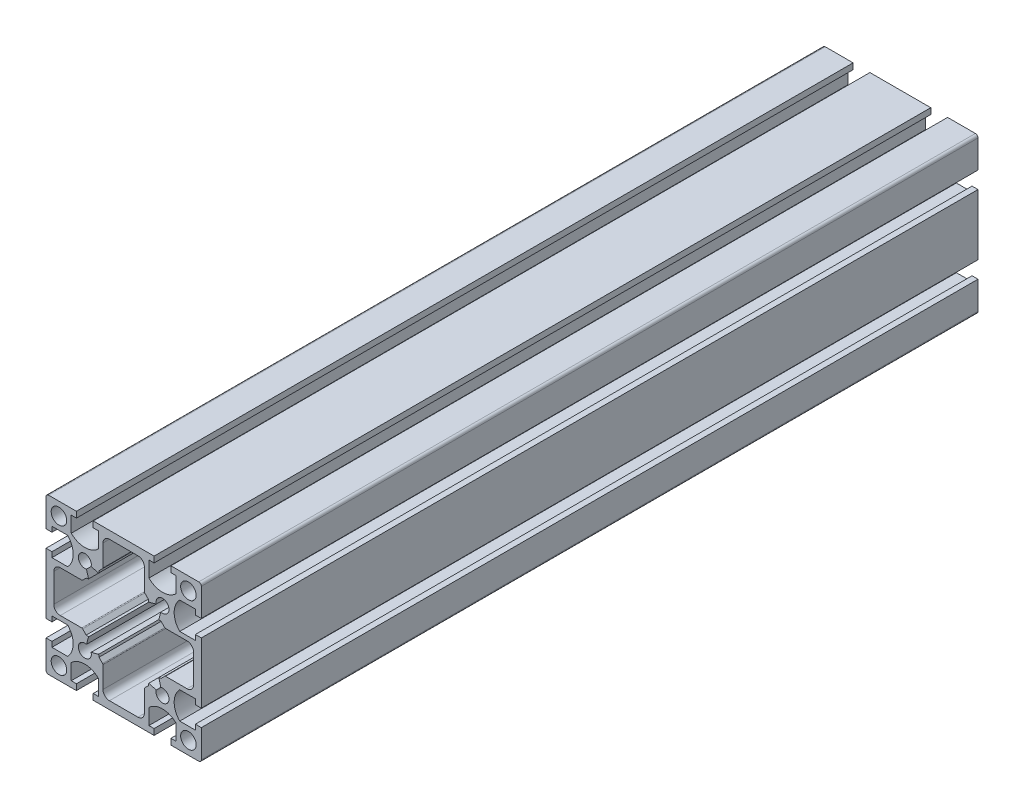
ISO-10303-21;
HEADER;
FILE_DESCRIPTION(('STEP AP214'),'2;1');
FILE_NAME('part.step','',(''),(''),'','','');
FILE_SCHEMA(('AUTOMOTIVE_DESIGN { 1 0 10303 214 1 1 1 1 }'));
ENDSEC;
DATA;
#1=APPLICATION_CONTEXT('core data for automotive mechanical design processes');
#2=APPLICATION_PROTOCOL_DEFINITION('international standard','automotive_design',2000,#1);
#3=PRODUCT_CONTEXT('',#1,'mechanical');
#4=PRODUCT('Part','Part','',(#3));
#5=PRODUCT_RELATED_PRODUCT_CATEGORY('part','',(#4));
#6=PRODUCT_DEFINITION_FORMATION('','',#4);
#7=PRODUCT_DEFINITION_CONTEXT('part definition',#1,'design');
#8=PRODUCT_DEFINITION('design','',#6,#7);
#9=PRODUCT_DEFINITION_SHAPE('','',#8);
#10=(LENGTH_UNIT() NAMED_UNIT(*) SI_UNIT(.MILLI.,.METRE.));
#11=(NAMED_UNIT(*) PLANE_ANGLE_UNIT() SI_UNIT($,.RADIAN.));
#12=(NAMED_UNIT(*) SI_UNIT($,.STERADIAN.) SOLID_ANGLE_UNIT());
#13=UNCERTAINTY_MEASURE_WITH_UNIT(LENGTH_MEASURE(1.E-05),#10,'distance_accuracy_value','');
#14=(GEOMETRIC_REPRESENTATION_CONTEXT(3) GLOBAL_UNCERTAINTY_ASSIGNED_CONTEXT((#13)) GLOBAL_UNIT_ASSIGNED_CONTEXT((#10,
#11,#12)) REPRESENTATION_CONTEXT('',''));
#15=CARTESIAN_POINT('',(0.,0.,0.));
#16=DIRECTION('',(0.,0.,1.));
#17=DIRECTION('',(1.,0.,0.));
#18=AXIS2_PLACEMENT_3D('',#15,#16,#17);
#19=CARTESIAN_POINT('',(15.,26.999999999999,150.));
#20=DIRECTION('',(0.,0.,1.));
#21=DIRECTION('',(1.,0.,0.));
#22=AXIS2_PLACEMENT_3D('',#19,#20,#21);
#23=PLANE('',#22);
#24=CARTESIAN_POINT('',(25.,-24.9999999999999,150.));
#25=DIRECTION('',(0.,0.,1.));
#26=DIRECTION('',(1.,0.,0.));
#27=AXIS2_PLACEMENT_3D('',#24,#25,#26);
#28=CIRCLE('',#27,3.);
#29=CARTESIAN_POINT('',(28.,-24.9999999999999,150.));
#30=VERTEX_POINT('',#29);
#31=EDGE_CURVE('E1225',#30,#30,#28,.T.);
#32=ORIENTED_EDGE('',*,*,#31,.F.);
#33=EDGE_LOOP('',(#32));
#34=FACE_BOUND('',#33,.T.);
#35=CARTESIAN_POINT('',(-25.,25.0000000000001,150.));
#36=DIRECTION('',(0.,0.,1.));
#37=DIRECTION('',(1.,0.,0.));
#38=AXIS2_PLACEMENT_3D('',#35,#36,#37);
#39=CIRCLE('',#38,3.);
#40=CARTESIAN_POINT('',(-22.,25.0000000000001,150.));
#41=VERTEX_POINT('',#40);
#42=EDGE_CURVE('E1237',#41,#41,#39,.T.);
#43=ORIENTED_EDGE('',*,*,#42,.F.);
#44=EDGE_LOOP('',(#43));
#45=FACE_BOUND('',#44,.T.);
#46=DIRECTION('',(0.,-1.,0.));
#47=VECTOR('',#46,1.);
#48=CARTESIAN_POINT('',(-9.75000000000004,21.6439286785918,150.));
#49=LINE('',#48,#47);
#50=CARTESIAN_POINT('',(-9.75000000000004,27.699999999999,150.));
#51=VERTEX_POINT('',#50);
#52=CARTESIAN_POINT('',(-9.75000000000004,21.6439286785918,150.));
#53=VERTEX_POINT('',#52);
#54=EDGE_CURVE('E1249',#51,#53,#49,.T.);
#55=ORIENTED_EDGE('',*,*,#54,.T.);
#56=CARTESIAN_POINT('',(-15.,26.999999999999,150.));
#57=DIRECTION('',(0.,0.,-1.));
#58=DIRECTION('',(1.,0.,0.));
#59=AXIS2_PLACEMENT_3D('',#56,#57,#58);
#60=CIRCLE('',#59,7.50000000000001);
#61=CARTESIAN_POINT('',(-20.25,21.6439286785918,150.));
#62=VERTEX_POINT('',#61);
#63=EDGE_CURVE('E1252',#53,#62,#60,.T.);
#64=ORIENTED_EDGE('',*,*,#63,.T.);
#65=DIRECTION('',(0.,1.,0.));
#66=VECTOR('',#65,1.);
#67=CARTESIAN_POINT('',(-20.25,27.699999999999,150.));
#68=LINE('',#67,#66);
#69=CARTESIAN_POINT('',(-20.25,27.699999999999,150.));
#70=VERTEX_POINT('',#69);
#71=EDGE_CURVE('E1255',#62,#70,#68,.T.);
#72=ORIENTED_EDGE('',*,*,#71,.T.);
#73=DIRECTION('',(1.,0.,0.));
#74=VECTOR('',#73,1.);
#75=CARTESIAN_POINT('',(-18.25,27.699999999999,150.));
#76=LINE('',#75,#74);
#77=CARTESIAN_POINT('',(-18.25,27.699999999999,150.));
#78=VERTEX_POINT('',#77);
#79=EDGE_CURVE('E1257',#70,#78,#76,.T.);
#80=ORIENTED_EDGE('',*,*,#79,.T.);
#81=DIRECTION('',(0.,1.,0.));
#82=VECTOR('',#81,1.);
#83=CARTESIAN_POINT('',(-18.25,30.0000000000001,150.));
#84=LINE('',#83,#82);
#85=CARTESIAN_POINT('',(-18.25,30.0000000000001,150.));
#86=VERTEX_POINT('',#85);
#87=EDGE_CURVE('E1259',#78,#86,#84,.T.);
#88=ORIENTED_EDGE('',*,*,#87,.T.);
#89=DIRECTION('',(-1.,0.,0.));
#90=VECTOR('',#89,1.);
#91=CARTESIAN_POINT('',(-29.,30.0000000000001,150.));
#92=LINE('',#91,#90);
#93=CARTESIAN_POINT('',(-29.,30.0000000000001,150.));
#94=VERTEX_POINT('',#93);
#95=EDGE_CURVE('E1261',#86,#94,#92,.T.);
#96=ORIENTED_EDGE('',*,*,#95,.T.);
#97=CARTESIAN_POINT('',(-29.,29.0000000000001,150.));
#98=DIRECTION('',(0.,0.,1.));
#99=DIRECTION('',(1.,0.,0.));
#100=AXIS2_PLACEMENT_3D('',#97,#98,#99);
#101=CIRCLE('',#100,1.);
#102=CARTESIAN_POINT('',(-30.,29.0000000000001,150.));
#103=VERTEX_POINT('',#102);
#104=EDGE_CURVE('E1263',#94,#103,#101,.T.);
#105=ORIENTED_EDGE('',*,*,#104,.T.);
#106=DIRECTION('',(0.,-1.,0.));
#107=VECTOR('',#106,1.);
#108=CARTESIAN_POINT('',(-30.,18.2500000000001,150.));
#109=LINE('',#108,#107);
#110=CARTESIAN_POINT('',(-30.,18.2500000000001,150.));
#111=VERTEX_POINT('',#110);
#112=EDGE_CURVE('E1265',#103,#111,#109,.T.);
#113=ORIENTED_EDGE('',*,*,#112,.T.);
#114=DIRECTION('',(1.,0.,0.));
#115=VECTOR('',#114,1.);
#116=CARTESIAN_POINT('',(-27.6999999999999,18.2500000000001,150.));
#117=LINE('',#116,#115);
#118=CARTESIAN_POINT('',(-27.6999999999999,18.2500000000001,150.));
#119=VERTEX_POINT('',#118);
#120=EDGE_CURVE('E1267',#111,#119,#117,.T.);
#121=ORIENTED_EDGE('',*,*,#120,.T.);
#122=DIRECTION('',(0.,1.,0.));
#123=VECTOR('',#122,1.);
#124=CARTESIAN_POINT('',(-27.6999999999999,20.2500000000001,150.));
#125=LINE('',#124,#123);
#126=CARTESIAN_POINT('',(-27.6999999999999,20.2500000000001,150.));
#127=VERTEX_POINT('',#126);
#128=EDGE_CURVE('E1269',#119,#127,#125,.T.);
#129=ORIENTED_EDGE('',*,*,#128,.T.);
#130=DIRECTION('',(1.,0.,0.));
#131=VECTOR('',#130,1.);
#132=CARTESIAN_POINT('',(-21.6439286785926,20.2500000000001,150.));
#133=LINE('',#132,#131);
#134=CARTESIAN_POINT('',(-21.6439286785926,20.2500000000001,150.));
#135=VERTEX_POINT('',#134);
#136=EDGE_CURVE('E1271',#127,#135,#133,.T.);
#137=ORIENTED_EDGE('',*,*,#136,.T.);
#138=CARTESIAN_POINT('',(-26.9999999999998,15.0000000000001,150.));
#139=DIRECTION('',(0.,0.,-1.));
#140=DIRECTION('',(1.,0.,0.));
#141=AXIS2_PLACEMENT_3D('',#138,#139,#140);
#142=CIRCLE('',#141,7.5);
#143=CARTESIAN_POINT('',(-21.6439286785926,9.75000000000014,150.));
#144=VERTEX_POINT('',#143);
#145=EDGE_CURVE('E1273',#135,#144,#142,.T.);
#146=ORIENTED_EDGE('',*,*,#145,.T.);
#147=DIRECTION('',(-1.,0.,0.));
#148=VECTOR('',#147,1.);
#149=CARTESIAN_POINT('',(-27.6999999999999,9.75000000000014,150.));
#150=LINE('',#149,#148);
#151=CARTESIAN_POINT('',(-27.6999999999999,9.75000000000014,150.));
#152=VERTEX_POINT('',#151);
#153=EDGE_CURVE('E1275',#144,#152,#150,.T.);
#154=ORIENTED_EDGE('',*,*,#153,.T.);
#155=DIRECTION('',(0.,1.,0.));
#156=VECTOR('',#155,1.);
#157=CARTESIAN_POINT('',(-27.6999999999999,11.7500000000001,150.));
#158=LINE('',#157,#156);
#159=CARTESIAN_POINT('',(-27.6999999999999,11.7500000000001,150.));
#160=VERTEX_POINT('',#159);
#161=EDGE_CURVE('E1277',#152,#160,#158,.T.);
#162=ORIENTED_EDGE('',*,*,#161,.T.);
#163=DIRECTION('',(-1.,0.,0.));
#164=VECTOR('',#163,1.);
#165=CARTESIAN_POINT('',(-30.,11.7500000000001,150.));
#166=LINE('',#165,#164);
#167=CARTESIAN_POINT('',(-30.,11.7500000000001,150.));
#168=VERTEX_POINT('',#167);
#169=EDGE_CURVE('E1279',#160,#168,#166,.T.);
#170=ORIENTED_EDGE('',*,*,#169,.T.);
#171=DIRECTION('',(0.,-1.,0.));
#172=VECTOR('',#171,1.);
#173=CARTESIAN_POINT('',(-30.,1.35308431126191E-13,150.));
#174=LINE('',#173,#172);
#175=CARTESIAN_POINT('',(-30.,-11.7499999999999,150.));
#176=VERTEX_POINT('',#175);
#177=EDGE_CURVE('E1281',#168,#176,#174,.T.);
#178=ORIENTED_EDGE('',*,*,#177,.T.);
#179=DIRECTION('',(1.,0.,0.));
#180=VECTOR('',#179,1.);
#181=CARTESIAN_POINT('',(-27.6999999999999,-11.7499999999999,150.));
#182=LINE('',#181,#180);
#183=CARTESIAN_POINT('',(-27.6999999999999,-11.7499999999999,150.));
#184=VERTEX_POINT('',#183);
#185=EDGE_CURVE('E1283',#176,#184,#182,.T.);
#186=ORIENTED_EDGE('',*,*,#185,.T.);
#187=DIRECTION('',(0.,1.,0.));
#188=VECTOR('',#187,1.);
#189=CARTESIAN_POINT('',(-27.6999999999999,-9.74999999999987,150.));
#190=LINE('',#189,#188);
#191=CARTESIAN_POINT('',(-27.6999999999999,-9.74999999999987,150.));
#192=VERTEX_POINT('',#191);
#193=EDGE_CURVE('E1285',#184,#192,#190,.T.);
#194=ORIENTED_EDGE('',*,*,#193,.T.);
#195=DIRECTION('',(1.,0.,0.));
#196=VECTOR('',#195,1.);
#197=CARTESIAN_POINT('',(-21.6439286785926,-9.74999999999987,150.));
#198=LINE('',#197,#196);
#199=CARTESIAN_POINT('',(-21.6439286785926,-9.74999999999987,150.));
#200=VERTEX_POINT('',#199);
#201=EDGE_CURVE('E1287',#192,#200,#198,.T.);
#202=ORIENTED_EDGE('',*,*,#201,.T.);
#203=CARTESIAN_POINT('',(-26.9999999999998,-14.9999999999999,150.));
#204=DIRECTION('',(0.,0.,-1.));
#205=DIRECTION('',(1.,0.,0.));
#206=AXIS2_PLACEMENT_3D('',#203,#204,#205);
#207=CIRCLE('',#206,7.5);
#208=CARTESIAN_POINT('',(-21.6439286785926,-20.2499999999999,150.));
#209=VERTEX_POINT('',#208);
#210=EDGE_CURVE('E1289',#200,#209,#207,.T.);
#211=ORIENTED_EDGE('',*,*,#210,.T.);
#212=DIRECTION('',(-1.,0.,0.));
#213=VECTOR('',#212,1.);
#214=CARTESIAN_POINT('',(-27.6999999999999,-20.2499999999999,150.));
#215=LINE('',#214,#213);
#216=CARTESIAN_POINT('',(-27.6999999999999,-20.2499999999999,150.));
#217=VERTEX_POINT('',#216);
#218=EDGE_CURVE('E1291',#209,#217,#215,.T.);
#219=ORIENTED_EDGE('',*,*,#218,.T.);
#220=DIRECTION('',(0.,1.,0.));
#221=VECTOR('',#220,1.);
#222=CARTESIAN_POINT('',(-27.6999999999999,-18.2499999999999,150.));
#223=LINE('',#222,#221);
#224=CARTESIAN_POINT('',(-27.6999999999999,-18.2499999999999,150.));
#225=VERTEX_POINT('',#224);
#226=EDGE_CURVE('E1293',#217,#225,#223,.T.);
#227=ORIENTED_EDGE('',*,*,#226,.T.);
#228=DIRECTION('',(-1.,0.,0.));
#229=VECTOR('',#228,1.);
#230=CARTESIAN_POINT('',(-30.,-18.2499999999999,150.));
#231=LINE('',#230,#229);
#232=CARTESIAN_POINT('',(-30.,-18.2499999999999,150.));
#233=VERTEX_POINT('',#232);
#234=EDGE_CURVE('E1295',#225,#233,#231,.T.);
#235=ORIENTED_EDGE('',*,*,#234,.T.);
#236=DIRECTION('',(0.,-1.,0.));
#237=VECTOR('',#236,1.);
#238=CARTESIAN_POINT('',(-30.,-28.9999999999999,150.));
#239=LINE('',#238,#237);
#240=CARTESIAN_POINT('',(-30.,-28.9999999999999,150.));
#241=VERTEX_POINT('',#240);
#242=EDGE_CURVE('E1297',#233,#241,#239,.T.);
#243=ORIENTED_EDGE('',*,*,#242,.T.);
#244=CARTESIAN_POINT('',(-29.,-28.9999999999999,150.));
#245=DIRECTION('',(0.,0.,1.));
#246=DIRECTION('',(1.,0.,0.));
#247=AXIS2_PLACEMENT_3D('',#244,#245,#246);
#248=CIRCLE('',#247,0.999999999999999);
#249=CARTESIAN_POINT('',(-29.,-29.9999999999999,150.));
#250=VERTEX_POINT('',#249);
#251=EDGE_CURVE('E1299',#241,#250,#248,.T.);
#252=ORIENTED_EDGE('',*,*,#251,.T.);
#253=DIRECTION('',(1.,0.,0.));
#254=VECTOR('',#253,1.);
#255=CARTESIAN_POINT('',(-18.25,-29.9999999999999,150.));
#256=LINE('',#255,#254);
#257=CARTESIAN_POINT('',(-18.25,-29.9999999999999,150.));
#258=VERTEX_POINT('',#257);
#259=EDGE_CURVE('E1301',#250,#258,#256,.T.);
#260=ORIENTED_EDGE('',*,*,#259,.T.);
#261=DIRECTION('',(0.,1.,0.));
#262=VECTOR('',#261,1.);
#263=CARTESIAN_POINT('',(-18.25,-27.7000000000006,150.));
#264=LINE('',#263,#262);
#265=CARTESIAN_POINT('',(-18.25,-27.7000000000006,150.));
#266=VERTEX_POINT('',#265);
#267=EDGE_CURVE('E1303',#258,#266,#264,.T.);
#268=ORIENTED_EDGE('',*,*,#267,.T.);
#269=DIRECTION('',(-1.,0.,0.));
#270=VECTOR('',#269,1.);
#271=CARTESIAN_POINT('',(-20.25,-27.7000000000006,150.));
#272=LINE('',#271,#270);
#273=CARTESIAN_POINT('',(-20.25,-27.7000000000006,150.));
#274=VERTEX_POINT('',#273);
#275=EDGE_CURVE('E1305',#266,#274,#272,.T.);
#276=ORIENTED_EDGE('',*,*,#275,.T.);
#277=DIRECTION('',(0.,1.,0.));
#278=VECTOR('',#277,1.);
#279=CARTESIAN_POINT('',(-20.25,-21.6439286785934,150.));
#280=LINE('',#279,#278);
#281=CARTESIAN_POINT('',(-20.25,-21.6439286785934,150.));
#282=VERTEX_POINT('',#281);
#283=EDGE_CURVE('E1307',#274,#282,#280,.T.);
#284=ORIENTED_EDGE('',*,*,#283,.T.);
#285=CARTESIAN_POINT('',(-15.,-27.0000000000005,150.));
#286=DIRECTION('',(0.,0.,-1.));
#287=DIRECTION('',(1.,0.,0.));
#288=AXIS2_PLACEMENT_3D('',#285,#286,#287);
#289=CIRCLE('',#288,7.50000000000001);
#290=CARTESIAN_POINT('',(-9.75000000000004,-21.6439286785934,150.));
#291=VERTEX_POINT('',#290);
#292=EDGE_CURVE('E1309',#282,#291,#289,.T.);
#293=ORIENTED_EDGE('',*,*,#292,.T.);
#294=DIRECTION('',(0.,-1.,0.));
#295=VECTOR('',#294,1.);
#296=CARTESIAN_POINT('',(-9.75000000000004,-27.7000000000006,150.));
#297=LINE('',#296,#295);
#298=CARTESIAN_POINT('',(-9.75000000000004,-27.7000000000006,150.));
#299=VERTEX_POINT('',#298);
#300=EDGE_CURVE('E1311',#291,#299,#297,.T.);
#301=ORIENTED_EDGE('',*,*,#300,.T.);
#302=DIRECTION('',(-1.,0.,0.));
#303=VECTOR('',#302,1.);
#304=CARTESIAN_POINT('',(-11.75,-27.7000000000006,150.));
#305=LINE('',#304,#303);
#306=CARTESIAN_POINT('',(-11.75,-27.7000000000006,150.));
#307=VERTEX_POINT('',#306);
#308=EDGE_CURVE('E1313',#299,#307,#305,.T.);
#309=ORIENTED_EDGE('',*,*,#308,.T.);
#310=DIRECTION('',(0.,-1.,0.));
#311=VECTOR('',#310,1.);
#312=CARTESIAN_POINT('',(-11.75,-29.9999999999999,150.));
#313=LINE('',#312,#311);
#314=CARTESIAN_POINT('',(-11.75,-29.9999999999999,150.));
#315=VERTEX_POINT('',#314);
#316=EDGE_CURVE('E1315',#307,#315,#313,.T.);
#317=ORIENTED_EDGE('',*,*,#316,.T.);
#318=DIRECTION('',(1.,0.,0.));
#319=VECTOR('',#318,1.);
#320=CARTESIAN_POINT('',(0.,-29.9999999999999,150.));
#321=LINE('',#320,#319);
#322=CARTESIAN_POINT('',(11.75,-29.9999999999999,150.));
#323=VERTEX_POINT('',#322);
#324=EDGE_CURVE('E1317',#315,#323,#321,.T.);
#325=ORIENTED_EDGE('',*,*,#324,.T.);
#326=DIRECTION('',(0.,1.,0.));
#327=VECTOR('',#326,1.);
#328=CARTESIAN_POINT('',(11.75,-27.7000000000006,150.));
#329=LINE('',#328,#327);
#330=CARTESIAN_POINT('',(11.75,-27.7000000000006,150.));
#331=VERTEX_POINT('',#330);
#332=EDGE_CURVE('E1319',#323,#331,#329,.T.);
#333=ORIENTED_EDGE('',*,*,#332,.T.);
#334=DIRECTION('',(-1.,0.,0.));
#335=VECTOR('',#334,1.);
#336=CARTESIAN_POINT('',(9.74999999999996,-27.7000000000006,150.));
#337=LINE('',#336,#335);
#338=CARTESIAN_POINT('',(9.74999999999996,-27.7000000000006,150.));
#339=VERTEX_POINT('',#338);
#340=EDGE_CURVE('E1321',#331,#339,#337,.T.);
#341=ORIENTED_EDGE('',*,*,#340,.T.);
#342=DIRECTION('',(0.,1.,0.));
#343=VECTOR('',#342,1.);
#344=CARTESIAN_POINT('',(9.74999999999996,-21.6439286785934,150.));
#345=LINE('',#344,#343);
#346=CARTESIAN_POINT('',(9.74999999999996,-21.6439286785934,150.));
#347=VERTEX_POINT('',#346);
#348=EDGE_CURVE('E1323',#339,#347,#345,.T.);
#349=ORIENTED_EDGE('',*,*,#348,.T.);
#350=CARTESIAN_POINT('',(15.,-27.0000000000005,150.));
#351=DIRECTION('',(0.,0.,-1.));
#352=DIRECTION('',(1.,0.,0.));
#353=AXIS2_PLACEMENT_3D('',#350,#351,#352);
#354=CIRCLE('',#353,7.50000000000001);
#355=CARTESIAN_POINT('',(20.25,-21.6439286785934,150.));
#356=VERTEX_POINT('',#355);
#357=EDGE_CURVE('E1325',#347,#356,#354,.T.);
#358=ORIENTED_EDGE('',*,*,#357,.T.);
#359=DIRECTION('',(0.,-1.,0.));
#360=VECTOR('',#359,1.);
#361=CARTESIAN_POINT('',(20.25,-27.7000000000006,150.));
#362=LINE('',#361,#360);
#363=CARTESIAN_POINT('',(20.25,-27.7000000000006,150.));
#364=VERTEX_POINT('',#363);
#365=EDGE_CURVE('E1327',#356,#364,#362,.T.);
#366=ORIENTED_EDGE('',*,*,#365,.T.);
#367=DIRECTION('',(-1.,0.,0.));
#368=VECTOR('',#367,1.);
#369=CARTESIAN_POINT('',(18.25,-27.7000000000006,150.));
#370=LINE('',#369,#368);
#371=CARTESIAN_POINT('',(18.25,-27.7000000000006,150.));
#372=VERTEX_POINT('',#371);
#373=EDGE_CURVE('E1329',#364,#372,#370,.T.);
#374=ORIENTED_EDGE('',*,*,#373,.T.);
#375=DIRECTION('',(0.,-1.,0.));
#376=VECTOR('',#375,1.);
#377=CARTESIAN_POINT('',(18.25,-29.9999999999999,150.));
#378=LINE('',#377,#376);
#379=CARTESIAN_POINT('',(18.25,-29.9999999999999,150.));
#380=VERTEX_POINT('',#379);
#381=EDGE_CURVE('E1331',#372,#380,#378,.T.);
#382=ORIENTED_EDGE('',*,*,#381,.T.);
#383=DIRECTION('',(1.,0.,0.));
#384=VECTOR('',#383,1.);
#385=CARTESIAN_POINT('',(29.,-29.9999999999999,150.));
#386=LINE('',#385,#384);
#387=CARTESIAN_POINT('',(29.,-29.9999999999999,150.));
#388=VERTEX_POINT('',#387);
#389=EDGE_CURVE('E1333',#380,#388,#386,.T.);
#390=ORIENTED_EDGE('',*,*,#389,.T.);
#391=CARTESIAN_POINT('',(29.,-28.9999999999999,150.));
#392=DIRECTION('',(0.,0.,1.));
#393=DIRECTION('',(1.,0.,0.));
#394=AXIS2_PLACEMENT_3D('',#391,#392,#393);
#395=CIRCLE('',#394,1.);
#396=CARTESIAN_POINT('',(30.,-28.9999999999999,150.));
#397=VERTEX_POINT('',#396);
#398=EDGE_CURVE('E1335',#388,#397,#395,.T.);
#399=ORIENTED_EDGE('',*,*,#398,.T.);
#400=DIRECTION('',(0.,1.,0.));
#401=VECTOR('',#400,1.);
#402=CARTESIAN_POINT('',(30.,-18.2499999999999,150.));
#403=LINE('',#402,#401);
#404=CARTESIAN_POINT('',(30.,-18.2499999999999,150.));
#405=VERTEX_POINT('',#404);
#406=EDGE_CURVE('E1337',#397,#405,#403,.T.);
#407=ORIENTED_EDGE('',*,*,#406,.T.);
#408=DIRECTION('',(-1.,0.,0.));
#409=VECTOR('',#408,1.);
#410=CARTESIAN_POINT('',(27.6999999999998,-18.2499999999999,150.));
#411=LINE('',#410,#409);
#412=CARTESIAN_POINT('',(27.6999999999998,-18.2499999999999,150.));
#413=VERTEX_POINT('',#412);
#414=EDGE_CURVE('E1339',#405,#413,#411,.T.);
#415=ORIENTED_EDGE('',*,*,#414,.T.);
#416=DIRECTION('',(0.,-1.,0.));
#417=VECTOR('',#416,1.);
#418=CARTESIAN_POINT('',(27.6999999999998,-20.2499999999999,150.));
#419=LINE('',#418,#417);
#420=CARTESIAN_POINT('',(27.6999999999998,-20.2499999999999,150.));
#421=VERTEX_POINT('',#420);
#422=EDGE_CURVE('E1341',#413,#421,#419,.T.);
#423=ORIENTED_EDGE('',*,*,#422,.T.);
#424=DIRECTION('',(-1.,0.,0.));
#425=VECTOR('',#424,1.);
#426=CARTESIAN_POINT('',(21.6439286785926,-20.2499999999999,150.));
#427=LINE('',#426,#425);
#428=CARTESIAN_POINT('',(21.6439286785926,-20.2499999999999,150.));
#429=VERTEX_POINT('',#428);
#430=EDGE_CURVE('E1343',#421,#429,#427,.T.);
#431=ORIENTED_EDGE('',*,*,#430,.T.);
#432=CARTESIAN_POINT('',(26.9999999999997,-14.9999999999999,150.));
#433=DIRECTION('',(0.,0.,-1.));
#434=DIRECTION('',(1.,0.,0.));
#435=AXIS2_PLACEMENT_3D('',#432,#433,#434);
#436=CIRCLE('',#435,7.49999999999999);
#437=CARTESIAN_POINT('',(21.6439286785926,-9.74999999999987,150.));
#438=VERTEX_POINT('',#437);
#439=EDGE_CURVE('E1345',#429,#438,#436,.T.);
#440=ORIENTED_EDGE('',*,*,#439,.T.);
#441=DIRECTION('',(1.,0.,0.));
#442=VECTOR('',#441,1.);
#443=CARTESIAN_POINT('',(27.6999999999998,-9.74999999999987,150.));
#444=LINE('',#443,#442);
#445=CARTESIAN_POINT('',(27.6999999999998,-9.74999999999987,150.));
#446=VERTEX_POINT('',#445);
#447=EDGE_CURVE('E1347',#438,#446,#444,.T.);
#448=ORIENTED_EDGE('',*,*,#447,.T.);
#449=DIRECTION('',(0.,-1.,0.));
#450=VECTOR('',#449,1.);
#451=CARTESIAN_POINT('',(27.6999999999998,-11.7499999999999,150.));
#452=LINE('',#451,#450);
#453=CARTESIAN_POINT('',(27.6999999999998,-11.7499999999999,150.));
#454=VERTEX_POINT('',#453);
#455=EDGE_CURVE('E1349',#446,#454,#452,.T.);
#456=ORIENTED_EDGE('',*,*,#455,.T.);
#457=DIRECTION('',(1.,0.,0.));
#458=VECTOR('',#457,1.);
#459=CARTESIAN_POINT('',(30.,-11.7499999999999,150.));
#460=LINE('',#459,#458);
#461=CARTESIAN_POINT('',(30.,-11.7499999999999,150.));
#462=VERTEX_POINT('',#461);
#463=EDGE_CURVE('E1351',#454,#462,#460,.T.);
#464=ORIENTED_EDGE('',*,*,#463,.T.);
#465=DIRECTION('',(0.,1.,0.));
#466=VECTOR('',#465,1.);
#467=CARTESIAN_POINT('',(30.,1.35308431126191E-13,150.));
#468=LINE('',#467,#466);
#469=CARTESIAN_POINT('',(30.,11.7500000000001,150.));
#470=VERTEX_POINT('',#469);
#471=EDGE_CURVE('E1353',#462,#470,#468,.T.);
#472=ORIENTED_EDGE('',*,*,#471,.T.);
#473=DIRECTION('',(-1.,0.,0.));
#474=VECTOR('',#473,1.);
#475=CARTESIAN_POINT('',(27.6999999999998,11.7500000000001,150.));
#476=LINE('',#475,#474);
#477=CARTESIAN_POINT('',(27.6999999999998,11.7500000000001,150.));
#478=VERTEX_POINT('',#477);
#479=EDGE_CURVE('E1355',#470,#478,#476,.T.);
#480=ORIENTED_EDGE('',*,*,#479,.T.);
#481=DIRECTION('',(0.,-1.,0.));
#482=VECTOR('',#481,1.);
#483=CARTESIAN_POINT('',(27.6999999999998,9.74999999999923,150.));
#484=LINE('',#483,#482);
#485=CARTESIAN_POINT('',(27.6999999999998,9.74999999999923,150.));
#486=VERTEX_POINT('',#485);
#487=EDGE_CURVE('E1357',#478,#486,#484,.T.);
#488=ORIENTED_EDGE('',*,*,#487,.T.);
#489=DIRECTION('',(-1.,0.,0.));
#490=VECTOR('',#489,1.);
#491=CARTESIAN_POINT('',(21.6439286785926,9.74999999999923,150.));
#492=LINE('',#491,#490);
#493=CARTESIAN_POINT('',(21.6439286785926,9.74999999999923,150.));
#494=VERTEX_POINT('',#493);
#495=EDGE_CURVE('E1359',#486,#494,#492,.T.);
#496=ORIENTED_EDGE('',*,*,#495,.T.);
#497=CARTESIAN_POINT('',(26.9999999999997,14.9999999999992,150.));
#498=DIRECTION('',(0.,0.,-1.));
#499=DIRECTION('',(1.,0.,0.));
#500=AXIS2_PLACEMENT_3D('',#497,#498,#499);
#501=CIRCLE('',#500,7.49999999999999);
#502=CARTESIAN_POINT('',(21.6439286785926,20.2499999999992,150.));
#503=VERTEX_POINT('',#502);
#504=EDGE_CURVE('E1361',#494,#503,#501,.T.);
#505=ORIENTED_EDGE('',*,*,#504,.T.);
#506=DIRECTION('',(1.,0.,0.));
#507=VECTOR('',#506,1.);
#508=CARTESIAN_POINT('',(27.6999999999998,20.2499999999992,150.));
#509=LINE('',#508,#507);
#510=CARTESIAN_POINT('',(27.6999999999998,20.2499999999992,150.));
#511=VERTEX_POINT('',#510);
#512=EDGE_CURVE('E1363',#503,#511,#509,.T.);
#513=ORIENTED_EDGE('',*,*,#512,.T.);
#514=DIRECTION('',(0.,-1.,0.));
#515=VECTOR('',#514,1.);
#516=CARTESIAN_POINT('',(27.6999999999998,18.2499999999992,150.));
#517=LINE('',#516,#515);
#518=CARTESIAN_POINT('',(27.6999999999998,18.2499999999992,150.));
#519=VERTEX_POINT('',#518);
#520=EDGE_CURVE('E1365',#511,#519,#517,.T.);
#521=ORIENTED_EDGE('',*,*,#520,.T.);
#522=DIRECTION('',(1.,0.,0.));
#523=VECTOR('',#522,1.);
#524=CARTESIAN_POINT('',(30.,18.2499999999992,150.));
#525=LINE('',#524,#523);
#526=CARTESIAN_POINT('',(30.,18.2499999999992,150.));
#527=VERTEX_POINT('',#526);
#528=EDGE_CURVE('E1367',#519,#527,#525,.T.);
#529=ORIENTED_EDGE('',*,*,#528,.T.);
#530=DIRECTION('',(0.,1.,0.));
#531=VECTOR('',#530,1.);
#532=CARTESIAN_POINT('',(30.,29.0000000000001,150.));
#533=LINE('',#532,#531);
#534=CARTESIAN_POINT('',(30.,29.0000000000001,150.));
#535=VERTEX_POINT('',#534);
#536=EDGE_CURVE('E1369',#527,#535,#533,.T.);
#537=ORIENTED_EDGE('',*,*,#536,.T.);
#538=CARTESIAN_POINT('',(29.,29.0000000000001,150.));
#539=DIRECTION('',(0.,0.,1.));
#540=DIRECTION('',(1.,0.,0.));
#541=AXIS2_PLACEMENT_3D('',#538,#539,#540);
#542=CIRCLE('',#541,1.);
#543=CARTESIAN_POINT('',(29.,30.0000000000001,150.));
#544=VERTEX_POINT('',#543);
#545=EDGE_CURVE('E1371',#535,#544,#542,.T.);
#546=ORIENTED_EDGE('',*,*,#545,.T.);
#547=DIRECTION('',(-1.,0.,0.));
#548=VECTOR('',#547,1.);
#549=CARTESIAN_POINT('',(18.25,30.0000000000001,150.));
#550=LINE('',#549,#548);
#551=CARTESIAN_POINT('',(18.25,30.0000000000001,150.));
#552=VERTEX_POINT('',#551);
#553=EDGE_CURVE('E1373',#544,#552,#550,.T.);
#554=ORIENTED_EDGE('',*,*,#553,.T.);
#555=DIRECTION('',(0.,-1.,0.));
#556=VECTOR('',#555,1.);
#557=CARTESIAN_POINT('',(18.25,27.699999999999,150.));
#558=LINE('',#557,#556);
#559=CARTESIAN_POINT('',(18.25,27.699999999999,150.));
#560=VERTEX_POINT('',#559);
#561=EDGE_CURVE('E1375',#552,#560,#558,.T.);
#562=ORIENTED_EDGE('',*,*,#561,.T.);
#563=DIRECTION('',(1.,0.,0.));
#564=VECTOR('',#563,1.);
#565=CARTESIAN_POINT('',(20.25,27.699999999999,150.));
#566=LINE('',#565,#564);
#567=CARTESIAN_POINT('',(20.25,27.699999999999,150.));
#568=VERTEX_POINT('',#567);
#569=EDGE_CURVE('E1377',#560,#568,#566,.T.);
#570=ORIENTED_EDGE('',*,*,#569,.T.);
#571=DIRECTION('',(0.,-1.,0.));
#572=VECTOR('',#571,1.);
#573=CARTESIAN_POINT('',(20.25,21.6439286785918,150.));
#574=LINE('',#573,#572);
#575=CARTESIAN_POINT('',(20.25,21.6439286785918,150.));
#576=VERTEX_POINT('',#575);
#577=EDGE_CURVE('E1379',#568,#576,#574,.T.);
#578=ORIENTED_EDGE('',*,*,#577,.T.);
#579=CARTESIAN_POINT('',(15.,26.999999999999,150.));
#580=DIRECTION('',(0.,0.,-1.));
#581=DIRECTION('',(1.,0.,0.));
#582=AXIS2_PLACEMENT_3D('',#579,#580,#581);
#583=CIRCLE('',#582,7.50000000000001);
#584=CARTESIAN_POINT('',(9.74999999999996,21.6439286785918,150.));
#585=VERTEX_POINT('',#584);
#586=EDGE_CURVE('E1381',#576,#585,#583,.T.);
#587=ORIENTED_EDGE('',*,*,#586,.T.);
#588=DIRECTION('',(0.,1.,0.));
#589=VECTOR('',#588,1.);
#590=CARTESIAN_POINT('',(9.74999999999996,27.699999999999,150.));
#591=LINE('',#590,#589);
#592=CARTESIAN_POINT('',(9.74999999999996,27.699999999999,150.));
#593=VERTEX_POINT('',#592);
#594=EDGE_CURVE('E1383',#585,#593,#591,.T.);
#595=ORIENTED_EDGE('',*,*,#594,.T.);
#596=DIRECTION('',(1.,0.,0.));
#597=VECTOR('',#596,1.);
#598=CARTESIAN_POINT('',(11.75,27.699999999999,150.));
#599=LINE('',#598,#597);
#600=CARTESIAN_POINT('',(11.75,27.699999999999,150.));
#601=VERTEX_POINT('',#600);
#602=EDGE_CURVE('E1385',#593,#601,#599,.T.);
#603=ORIENTED_EDGE('',*,*,#602,.T.);
#604=DIRECTION('',(0.,1.,0.));
#605=VECTOR('',#604,1.);
#606=CARTESIAN_POINT('',(11.75,30.0000000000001,150.));
#607=LINE('',#606,#605);
#608=CARTESIAN_POINT('',(11.75,30.0000000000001,150.));
#609=VERTEX_POINT('',#608);
#610=EDGE_CURVE('E1387',#601,#609,#607,.T.);
#611=ORIENTED_EDGE('',*,*,#610,.T.);
#612=DIRECTION('',(-1.,0.,0.));
#613=VECTOR('',#612,1.);
#614=CARTESIAN_POINT('',(0.,30.0000000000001,150.));
#615=LINE('',#614,#613);
#616=CARTESIAN_POINT('',(-11.75,30.0000000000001,150.));
#617=VERTEX_POINT('',#616);
#618=EDGE_CURVE('E1389',#609,#617,#615,.T.);
#619=ORIENTED_EDGE('',*,*,#618,.T.);
#620=DIRECTION('',(0.,-1.,0.));
#621=VECTOR('',#620,1.);
#622=CARTESIAN_POINT('',(-11.75,27.699999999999,150.));
#623=LINE('',#622,#621);
#624=CARTESIAN_POINT('',(-11.75,27.699999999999,150.));
#625=VERTEX_POINT('',#624);
#626=EDGE_CURVE('E1391',#617,#625,#623,.T.);
#627=ORIENTED_EDGE('',*,*,#626,.T.);
#628=DIRECTION('',(1.,0.,0.));
#629=VECTOR('',#628,1.);
#630=CARTESIAN_POINT('',(-9.75000000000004,27.699999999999,150.));
#631=LINE('',#630,#629);
#632=EDGE_CURVE('E1393',#625,#51,#631,.T.);
#633=ORIENTED_EDGE('',*,*,#632,.T.);
#634=EDGE_LOOP('',(#55,#64,#72,#80,#88,#96,#105,#113,#121,#129,#137,#146,#154,#162,#170,#178,
#186,#194,#202,#211,#219,#227,#235,#243,#252,#260,#268,#276,#284,#293,#301,#309,#317,#325,#333,
#341,#349,#358,#366,#374,#382,#390,#399,#407,#415,#423,#431,#440,#448,#456,#464,#472,#480,#488,
#496,#505,#513,#521,#529,#537,#546,#554,#562,#570,#578,#587,#595,#603,#611,#619,#627,#633));
#635=FACE_BOUND('',#634,.T.);
#636=CARTESIAN_POINT('',(-25.,-24.9999999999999,150.));
#637=DIRECTION('',(0.,0.,1.));
#638=DIRECTION('',(1.,0.,0.));
#639=AXIS2_PLACEMENT_3D('',#636,#637,#638);
#640=CIRCLE('',#639,3.);
#641=CARTESIAN_POINT('',(-22.,-24.9999999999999,150.));
#642=VERTEX_POINT('',#641);
#643=EDGE_CURVE('E1243',#642,#642,#640,.T.);
#644=ORIENTED_EDGE('',*,*,#643,.F.);
#645=EDGE_LOOP('',(#644));
#646=FACE_BOUND('',#645,.T.);
#647=CARTESIAN_POINT('',(25.,25.0000000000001,150.));
#648=DIRECTION('',(0.,0.,1.));
#649=DIRECTION('',(1.,0.,0.));
#650=AXIS2_PLACEMENT_3D('',#647,#648,#649);
#651=CIRCLE('',#650,3.);
#652=CARTESIAN_POINT('',(28.,25.0000000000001,150.));
#653=VERTEX_POINT('',#652);
#654=EDGE_CURVE('E1231',#653,#653,#651,.T.);
#655=ORIENTED_EDGE('',*,*,#654,.F.);
#656=EDGE_LOOP('',(#655));
#657=FACE_BOUND('',#656,.T.);
#658=DIRECTION('',(0.965925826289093,0.258819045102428,0.));
#659=VECTOR('',#658,1.);
#660=CARTESIAN_POINT('',(-9.68740795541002,-13.5764952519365,150.));
#661=LINE('',#660,#659);
#662=CARTESIAN_POINT('',(-12.5851854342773,-14.3529523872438,150.));
#663=VERTEX_POINT('',#662);
#664=CARTESIAN_POINT('',(-9.68740795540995,-13.5764952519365,150.));
#665=VERTEX_POINT('',#664);
#666=EDGE_CURVE('E828',#663,#665,#661,.T.);
#667=ORIENTED_EDGE('',*,*,#666,.F.);
#668=CARTESIAN_POINT('',(-14.9999999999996,-15.0000000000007,150.));
#669=DIRECTION('',(0.,0.,1.));
#670=DIRECTION('',(1.,0.,0.));
#671=AXIS2_PLACEMENT_3D('',#668,#669,#670);
#672=CIRCLE('',#671,2.49999999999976);
#673=CARTESIAN_POINT('',(-14.352952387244,-12.585185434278,150.));
#674=VERTEX_POINT('',#673);
#675=EDGE_CURVE('E820',#674,#663,#672,.T.);
#676=ORIENTED_EDGE('',*,*,#675,.F.);
#677=DIRECTION('',(-0.258819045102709,-0.965925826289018,0.));
#678=VECTOR('',#677,1.);
#679=CARTESIAN_POINT('',(-14.352952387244,-12.585185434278,150.));
#680=LINE('',#679,#678);
#681=CARTESIAN_POINT('',(-13.5764952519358,-9.68740795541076,150.));
#682=VERTEX_POINT('',#681);
#683=EDGE_CURVE('E949',#682,#674,#680,.T.);
#684=ORIENTED_EDGE('',*,*,#683,.F.);
#685=CARTESIAN_POINT('',(-14.9999999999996,-15.0000000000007,150.));
#686=DIRECTION('',(0.,0.,-1.));
#687=DIRECTION('',(1.,0.,0.));
#688=AXIS2_PLACEMENT_3D('',#685,#686,#687);
#689=CIRCLE('',#688,5.4999999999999);
#690=CARTESIAN_POINT('',(-14.4748737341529,-9.52512626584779,150.));
#691=VERTEX_POINT('',#690);
#692=EDGE_CURVE('E947',#691,#682,#689,.T.);
#693=ORIENTED_EDGE('',*,*,#692,.F.);
#694=DIRECTION('',(0.707106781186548,-0.707106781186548,0.));
#695=VECTOR('',#694,1.);
#696=CARTESIAN_POINT('',(-14.4748737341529,-9.5251262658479,150.));
#697=LINE('',#696,#695);
#698=CARTESIAN_POINT('',(-15.8535533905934,-8.14644660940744,150.));
#699=VERTEX_POINT('',#698);
#700=EDGE_CURVE('E945',#699,#691,#697,.T.);
#701=ORIENTED_EDGE('',*,*,#700,.F.);
#702=CARTESIAN_POINT('',(-16.2071067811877,-8.50000000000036,150.));
#703=DIRECTION('',(0.,0.,-1.));
#704=DIRECTION('',(1.,0.,0.));
#705=AXIS2_PLACEMENT_3D('',#702,#703,#704);
#706=CIRCLE('',#705,0.500000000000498);
#707=CARTESIAN_POINT('',(-16.2071067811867,-7.99999999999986,150.));
#708=VERTEX_POINT('',#707);
#709=EDGE_CURVE('E943',#708,#699,#706,.T.);
#710=ORIENTED_EDGE('',*,*,#709,.F.);
#711=DIRECTION('',(1.,0.,0.));
#712=VECTOR('',#711,1.);
#713=CARTESIAN_POINT('',(-16.2071067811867,-7.99999999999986,150.));
#714=LINE('',#713,#712);
#715=CARTESIAN_POINT('',(-24.5,-7.99999999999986,150.));
#716=VERTEX_POINT('',#715);
#717=EDGE_CURVE('E941',#716,#708,#714,.T.);
#718=ORIENTED_EDGE('',*,*,#717,.F.);
#719=CARTESIAN_POINT('',(-24.5,-5.49999999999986,150.));
#720=DIRECTION('',(0.,0.,1.));
#721=DIRECTION('',(1.,0.,0.));
#722=AXIS2_PLACEMENT_3D('',#719,#720,#721);
#723=CIRCLE('',#722,2.50000000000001);
#724=CARTESIAN_POINT('',(-27.,-5.49999999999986,150.));
#725=VERTEX_POINT('',#724);
#726=EDGE_CURVE('E939',#725,#716,#723,.T.);
#727=ORIENTED_EDGE('',*,*,#726,.F.);
#728=DIRECTION('',(0.,-1.,0.));
#729=VECTOR('',#728,1.);
#730=CARTESIAN_POINT('',(-27.,1.35308431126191E-13,150.));
#731=LINE('',#730,#729);
#732=CARTESIAN_POINT('',(-27.,5.50000000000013,150.));
#733=VERTEX_POINT('',#732);
#734=EDGE_CURVE('E937',#733,#725,#731,.T.);
#735=ORIENTED_EDGE('',*,*,#734,.F.);
#736=CARTESIAN_POINT('',(-24.5,5.50000000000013,150.));
#737=DIRECTION('',(0.,0.,1.));
#738=DIRECTION('',(1.,0.,0.));
#739=AXIS2_PLACEMENT_3D('',#736,#737,#738);
#740=CIRCLE('',#739,2.50000000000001);
#741=CARTESIAN_POINT('',(-24.5,8.00000000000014,150.));
#742=VERTEX_POINT('',#741);
#743=EDGE_CURVE('E935',#742,#733,#740,.T.);
#744=ORIENTED_EDGE('',*,*,#743,.F.);
#745=DIRECTION('',(-1.,0.,0.));
#746=VECTOR('',#745,1.);
#747=CARTESIAN_POINT('',(-24.5,8.00000000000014,150.));
#748=LINE('',#747,#746);
#749=CARTESIAN_POINT('',(-16.2071067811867,8.00000000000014,150.));
#750=VERTEX_POINT('',#749);
#751=EDGE_CURVE('E933',#750,#742,#748,.T.);
#752=ORIENTED_EDGE('',*,*,#751,.F.);
#753=CARTESIAN_POINT('',(-16.2071067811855,8.49999999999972,150.));
#754=DIRECTION('',(0.,0.,-1.));
#755=DIRECTION('',(1.,0.,0.));
#756=AXIS2_PLACEMENT_3D('',#753,#754,#755);
#757=CIRCLE('',#756,0.499999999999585);
#758=CARTESIAN_POINT('',(-15.8535533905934,8.14644660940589,150.));
#759=VERTEX_POINT('',#758);
#760=EDGE_CURVE('E931',#759,#750,#757,.T.);
#761=ORIENTED_EDGE('',*,*,#760,.F.);
#762=DIRECTION('',(-0.707106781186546,-0.707106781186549,0.));
#763=VECTOR('',#762,1.);
#764=CARTESIAN_POINT('',(-15.8535533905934,8.14644660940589,150.));
#765=LINE('',#764,#763);
#766=CARTESIAN_POINT('',(-14.4748737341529,9.52512626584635,150.));
#767=VERTEX_POINT('',#766);
#768=EDGE_CURVE('E929',#767,#759,#765,.T.);
#769=ORIENTED_EDGE('',*,*,#768,.F.);
#770=CARTESIAN_POINT('',(-15.0000000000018,14.9999999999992,150.));
#771=DIRECTION('',(0.,0.,-1.));
#772=DIRECTION('',(1.,0.,0.));
#773=AXIS2_PLACEMENT_3D('',#770,#771,#772);
#774=CIRCLE('',#773,5.50000000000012);
#775=CARTESIAN_POINT('',(-13.5764952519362,9.68740795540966,150.));
#776=VERTEX_POINT('',#775);
#777=EDGE_CURVE('E927',#776,#767,#774,.T.);
#778=ORIENTED_EDGE('',*,*,#777,.F.);
#779=DIRECTION('',(0.258819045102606,-0.965925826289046,0.));
#780=VECTOR('',#779,1.);
#781=CARTESIAN_POINT('',(-13.5764952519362,9.68740795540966,150.));
#782=LINE('',#781,#780);
#783=CARTESIAN_POINT('',(-14.352952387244,12.5851854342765,150.));
#784=VERTEX_POINT('',#783);
#785=EDGE_CURVE('E925',#784,#776,#782,.T.);
#786=ORIENTED_EDGE('',*,*,#785,.F.);
#787=CARTESIAN_POINT('',(-15.0000000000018,14.9999999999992,150.));
#788=DIRECTION('',(0.,0.,1.));
#789=DIRECTION('',(1.,0.,0.));
#790=AXIS2_PLACEMENT_3D('',#787,#788,#789);
#791=CIRCLE('',#790,2.50000000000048);
#792=CARTESIAN_POINT('',(-12.5851854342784,14.3529523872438,150.));
#793=VERTEX_POINT('',#792);
#794=EDGE_CURVE('E923',#793,#784,#791,.T.);
#795=ORIENTED_EDGE('',*,*,#794,.F.);
#796=DIRECTION('',(-0.96592582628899,0.258819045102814,0.));
#797=VECTOR('',#796,1.);
#798=CARTESIAN_POINT('',(-12.5851854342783,14.3529523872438,150.));
#799=LINE('',#798,#797);
#800=CARTESIAN_POINT('',(-9.68740795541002,13.576495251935,150.));
#801=VERTEX_POINT('',#800);
#802=EDGE_CURVE('E921',#801,#793,#799,.T.);
#803=ORIENTED_EDGE('',*,*,#802,.F.);
#804=CARTESIAN_POINT('',(-15.0000000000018,14.9999999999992,150.));
#805=DIRECTION('',(0.,0.,-1.));
#806=DIRECTION('',(1.,0.,0.));
#807=AXIS2_PLACEMENT_3D('',#804,#805,#806);
#808=CIRCLE('',#807,5.5000000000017);
#809=CARTESIAN_POINT('',(-9.52512626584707,14.474873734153,150.));
#810=VERTEX_POINT('',#809);
#811=EDGE_CURVE('E919',#810,#801,#808,.T.);
#812=ORIENTED_EDGE('',*,*,#811,.F.);
#813=DIRECTION('',(-0.707106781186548,-0.707106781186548,0.));
#814=VECTOR('',#813,1.);
#815=CARTESIAN_POINT('',(-9.52512626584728,14.474873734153,150.));
#816=LINE('',#815,#814);
#817=CARTESIAN_POINT('',(-8.14644660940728,15.853553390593,150.));
#818=VERTEX_POINT('',#817);
#819=EDGE_CURVE('E917',#818,#810,#816,.T.);
#820=ORIENTED_EDGE('',*,*,#819,.F.);
#821=CARTESIAN_POINT('',(-8.50000000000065,16.2071067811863,150.));
#822=DIRECTION('',(0.,0.,-1.));
#823=DIRECTION('',(1.,0.,0.));
#824=AXIS2_PLACEMENT_3D('',#821,#822,#823);
#825=CIRCLE('',#824,0.500000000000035);
#826=CARTESIAN_POINT('',(-8.00000000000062,16.2071067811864,150.));
#827=VERTEX_POINT('',#826);
#828=EDGE_CURVE('E915',#827,#818,#825,.T.);
#829=ORIENTED_EDGE('',*,*,#828,.F.);
#830=DIRECTION('',(0.,-1.,0.));
#831=VECTOR('',#830,1.);
#832=CARTESIAN_POINT('',(-8.00000000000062,16.2071067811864,150.));
#833=LINE('',#832,#831);
#834=CARTESIAN_POINT('',(-8.00000000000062,24.5000000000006,150.));
#835=VERTEX_POINT('',#834);
#836=EDGE_CURVE('E913',#835,#827,#833,.T.);
#837=ORIENTED_EDGE('',*,*,#836,.F.);
#838=CARTESIAN_POINT('',(-5.50000000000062,24.5000000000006,150.));
#839=DIRECTION('',(0.,0.,1.));
#840=DIRECTION('',(1.,0.,0.));
#841=AXIS2_PLACEMENT_3D('',#838,#839,#840);
#842=CIRCLE('',#841,2.5);
#843=CARTESIAN_POINT('',(-5.50000000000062,27.0000000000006,150.));
#844=VERTEX_POINT('',#843);
#845=EDGE_CURVE('E911',#844,#835,#842,.T.);
#846=ORIENTED_EDGE('',*,*,#845,.F.);
#847=DIRECTION('',(-1.,0.,0.));
#848=VECTOR('',#847,1.);
#849=CARTESIAN_POINT('',(-6.17561557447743E-13,27.0000000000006,150.));
#850=LINE('',#849,#848);
#851=CARTESIAN_POINT('',(5.49999999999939,27.0000000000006,150.));
#852=VERTEX_POINT('',#851);
#853=EDGE_CURVE('E909',#852,#844,#850,.T.);
#854=ORIENTED_EDGE('',*,*,#853,.F.);
#855=CARTESIAN_POINT('',(5.49999999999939,24.5000000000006,150.));
#856=DIRECTION('',(0.,0.,1.));
#857=DIRECTION('',(1.,0.,0.));
#858=AXIS2_PLACEMENT_3D('',#855,#856,#857);
#859=CIRCLE('',#858,2.5);
#860=CARTESIAN_POINT('',(7.99999999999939,24.5000000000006,150.));
#861=VERTEX_POINT('',#860);
#862=EDGE_CURVE('E907',#861,#852,#859,.T.);
#863=ORIENTED_EDGE('',*,*,#862,.F.);
#864=DIRECTION('',(0.,1.,0.));
#865=VECTOR('',#864,1.);
#866=CARTESIAN_POINT('',(7.99999999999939,24.5000000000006,150.));
#867=LINE('',#866,#865);
#868=CARTESIAN_POINT('',(7.99999999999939,16.2071067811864,150.));
#869=VERTEX_POINT('',#868);
#870=EDGE_CURVE('E905',#869,#861,#867,.T.);
#871=ORIENTED_EDGE('',*,*,#870,.F.);
#872=CARTESIAN_POINT('',(8.49999999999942,16.2071067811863,150.));
#873=DIRECTION('',(0.,0.,-1.));
#874=DIRECTION('',(1.,0.,0.));
#875=AXIS2_PLACEMENT_3D('',#872,#873,#874);
#876=CIRCLE('',#875,0.500000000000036);
#877=CARTESIAN_POINT('',(8.14644660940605,15.853553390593,150.));
#878=VERTEX_POINT('',#877);
#879=EDGE_CURVE('E903',#878,#869,#876,.T.);
#880=ORIENTED_EDGE('',*,*,#879,.F.);
#881=DIRECTION('',(-0.707106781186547,0.707106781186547,0.));
#882=VECTOR('',#881,1.);
#883=CARTESIAN_POINT('',(8.14644660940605,15.853553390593,150.));
#884=LINE('',#883,#882);
#885=CARTESIAN_POINT('',(9.52512626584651,14.4748737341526,150.));
#886=VERTEX_POINT('',#885);
#887=EDGE_CURVE('E901',#886,#878,#884,.T.);
#888=ORIENTED_EDGE('',*,*,#887,.F.);
#889=CARTESIAN_POINT('',(15.0000000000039,14.9999999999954,150.));
#890=DIRECTION('',(0.,0.,-1.));
#891=DIRECTION('',(1.,0.,0.));
#892=AXIS2_PLACEMENT_3D('',#889,#890,#891);
#893=CIRCLE('',#892,5.50000000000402);
#894=CARTESIAN_POINT('',(9.68740795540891,13.576495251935,150.));
#895=VERTEX_POINT('',#894);
#896=EDGE_CURVE('E899',#895,#886,#893,.T.);
#897=ORIENTED_EDGE('',*,*,#896,.F.);
#898=DIRECTION('',(-0.965925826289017,-0.258819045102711,0.));
#899=VECTOR('',#898,1.);
#900=CARTESIAN_POINT('',(9.68740795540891,13.576495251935,150.));
#901=LINE('',#900,#899);
#902=CARTESIAN_POINT('',(12.5851854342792,14.352952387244,150.));
#903=VERTEX_POINT('',#902);
#904=EDGE_CURVE('E897',#903,#895,#901,.T.);
#905=ORIENTED_EDGE('',*,*,#904,.F.);
#906=CARTESIAN_POINT('',(15.0000000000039,14.9999999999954,150.));
#907=DIRECTION('',(0.,0.,1.));
#908=DIRECTION('',(1.,0.,0.));
#909=AXIS2_PLACEMENT_3D('',#906,#907,#908);
#910=CIRCLE('',#909,2.50000000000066);
#911=CARTESIAN_POINT('',(14.352952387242,12.5851854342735,150.));
#912=VERTEX_POINT('',#911);
#913=EDGE_CURVE('E895',#912,#903,#910,.T.);
#914=ORIENTED_EDGE('',*,*,#913,.F.);
#915=DIRECTION('',(0.258819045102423,0.965925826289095,0.));
#916=VECTOR('',#915,1.);
#917=CARTESIAN_POINT('',(14.352952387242,12.5851854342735,150.));
#918=LINE('',#917,#916);
#919=CARTESIAN_POINT('',(13.5764952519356,9.68740795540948,150.));
#920=VERTEX_POINT('',#919);
#921=EDGE_CURVE('E893',#920,#912,#918,.T.);
#922=ORIENTED_EDGE('',*,*,#921,.F.);
#923=CARTESIAN_POINT('',(15.0000000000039,14.9999999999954,150.));
#924=DIRECTION('',(0.,0.,-1.));
#925=DIRECTION('',(1.,0.,0.));
#926=AXIS2_PLACEMENT_3D('',#923,#924,#925);
#927=CIRCLE('',#926,5.49999999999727);
#928=CARTESIAN_POINT('',(14.4748737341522,9.52512626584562,150.));
#929=VERTEX_POINT('',#928);
#930=EDGE_CURVE('E891',#929,#920,#927,.T.);
#931=ORIENTED_EDGE('',*,*,#930,.F.);
#932=DIRECTION('',(-0.707106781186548,0.707106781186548,0.));
#933=VECTOR('',#932,1.);
#934=CARTESIAN_POINT('',(14.4748737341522,9.52512626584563,150.));
#935=LINE('',#934,#933);
#936=CARTESIAN_POINT('',(15.8535533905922,8.14644660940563,150.));
#937=VERTEX_POINT('',#936);
#938=EDGE_CURVE('E889',#937,#929,#935,.T.);
#939=ORIENTED_EDGE('',*,*,#938,.F.);
#940=CARTESIAN_POINT('',(16.2071067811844,8.49999999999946,150.));
#941=DIRECTION('',(0.,0.,-1.));
#942=DIRECTION('',(1.,0.,0.));
#943=AXIS2_PLACEMENT_3D('',#940,#941,#942);
#944=CIRCLE('',#943,0.499999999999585);
#945=CARTESIAN_POINT('',(16.2071067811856,7.99999999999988,150.));
#946=VERTEX_POINT('',#945);
#947=EDGE_CURVE('E887',#946,#937,#944,.T.);
#948=ORIENTED_EDGE('',*,*,#947,.F.);
#949=DIRECTION('',(-1.,0.,0.));
#950=VECTOR('',#949,1.);
#951=CARTESIAN_POINT('',(16.2071067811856,7.99999999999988,150.));
#952=LINE('',#951,#950);
#953=CARTESIAN_POINT('',(24.4999999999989,7.99999999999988,150.));
#954=VERTEX_POINT('',#953);
#955=EDGE_CURVE('E885',#954,#946,#952,.T.);
#956=ORIENTED_EDGE('',*,*,#955,.F.);
#957=CARTESIAN_POINT('',(24.499999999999,5.49999999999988,150.));
#958=DIRECTION('',(0.,0.,1.));
#959=DIRECTION('',(1.,0.,0.));
#960=AXIS2_PLACEMENT_3D('',#957,#958,#959);
#961=CIRCLE('',#960,2.50000000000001);
#962=CARTESIAN_POINT('',(26.999999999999,5.49999999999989,150.));
#963=VERTEX_POINT('',#962);
#964=EDGE_CURVE('E883',#963,#954,#961,.T.);
#965=ORIENTED_EDGE('',*,*,#964,.F.);
#966=DIRECTION('',(0.,1.,0.));
#967=VECTOR('',#966,1.);
#968=CARTESIAN_POINT('',(26.999999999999,-1.07552855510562E-13,150.));
#969=LINE('',#968,#967);
#970=CARTESIAN_POINT('',(26.999999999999,-5.50000000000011,150.));
#971=VERTEX_POINT('',#970);
#972=EDGE_CURVE('E881',#971,#963,#969,.T.);
#973=ORIENTED_EDGE('',*,*,#972,.F.);
#974=CARTESIAN_POINT('',(24.499999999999,-5.50000000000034,150.));
#975=DIRECTION('',(0.,0.,1.));
#976=DIRECTION('',(1.,0.,0.));
#977=AXIS2_PLACEMENT_3D('',#974,#975,#976);
#978=CIRCLE('',#977,2.5);
#979=CARTESIAN_POINT('',(24.499999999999,-8.00000000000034,150.));
#980=VERTEX_POINT('',#979);
#981=EDGE_CURVE('E879',#980,#971,#978,.T.);
#982=ORIENTED_EDGE('',*,*,#981,.F.);
#983=DIRECTION('',(1.,0.,0.));
#984=VECTOR('',#983,1.);
#985=CARTESIAN_POINT('',(24.499999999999,-8.00000000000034,150.));
#986=LINE('',#985,#984);
#987=CARTESIAN_POINT('',(16.2071067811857,-8.00000000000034,150.));
#988=VERTEX_POINT('',#987);
#989=EDGE_CURVE('E877',#988,#980,#986,.T.);
#990=ORIENTED_EDGE('',*,*,#989,.F.);
#991=CARTESIAN_POINT('',(16.2071067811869,-8.50000000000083,150.));
#992=DIRECTION('',(0.,0.,-1.));
#993=DIRECTION('',(1.,0.,0.));
#994=AXIS2_PLACEMENT_3D('',#991,#992,#993);
#995=CIRCLE('',#994,0.500000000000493);
#996=CARTESIAN_POINT('',(15.8535533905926,-8.14644660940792,150.));
#997=VERTEX_POINT('',#996);
#998=EDGE_CURVE('E875',#997,#988,#995,.T.);
#999=ORIENTED_EDGE('',*,*,#998,.F.);
#1000=DIRECTION('',(0.707106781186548,0.707106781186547,0.));
#1001=VECTOR('',#1000,1.);
#1002=CARTESIAN_POINT('',(15.8535533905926,-8.14644660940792,150.));
#1003=LINE('',#1002,#1001);
#1004=CARTESIAN_POINT('',(14.4748737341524,-9.52512626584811,150.));
#1005=VERTEX_POINT('',#1004);
#1006=EDGE_CURVE('E873',#1005,#997,#1003,.T.);
#1007=ORIENTED_EDGE('',*,*,#1006,.F.);
#1008=CARTESIAN_POINT('',(15.0000000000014,-15.000000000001,150.));
#1009=DIRECTION('',(0.,0.,-1.));
#1010=DIRECTION('',(1.,0.,0.));
#1011=AXIS2_PLACEMENT_3D('',#1008,#1009,#1010);
#1012=CIRCLE('',#1011,5.50000000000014);
#1013=CARTESIAN_POINT('',(13.5764952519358,-9.68740795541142,150.));
#1014=VERTEX_POINT('',#1013);
#1015=EDGE_CURVE('E871',#1014,#1005,#1012,.T.);
#1016=ORIENTED_EDGE('',*,*,#1015,.F.);
#1017=DIRECTION('',(-0.258819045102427,0.965925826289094,0.));
#1018=VECTOR('',#1017,1.);
#1019=CARTESIAN_POINT('',(13.5764952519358,-9.68740795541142,150.));
#1020=LINE('',#1019,#1018);
#1021=CARTESIAN_POINT('',(14.3529523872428,-12.5851854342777,150.));
#1022=VERTEX_POINT('',#1021);
#1023=EDGE_CURVE('E869',#1022,#1014,#1020,.T.);
#1024=ORIENTED_EDGE('',*,*,#1023,.F.);
#1025=CARTESIAN_POINT('',(15.0000000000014,-15.000000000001,150.));
#1026=DIRECTION('',(0.,0.,1.));
#1027=DIRECTION('',(1.,0.,0.));
#1028=AXIS2_PLACEMENT_3D('',#1025,#1026,#1027);
#1029=CIRCLE('',#1028,2.50000000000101);
#1030=CARTESIAN_POINT('',(12.5851854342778,-14.352952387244,150.));
#1031=VERTEX_POINT('',#1030);
#1032=EDGE_CURVE('E867',#1031,#1022,#1029,.T.);
#1033=ORIENTED_EDGE('',*,*,#1032,.F.);
#1034=DIRECTION('',(0.965925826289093,-0.258819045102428,0.));
#1035=VECTOR('',#1034,1.);
#1036=CARTESIAN_POINT('',(12.585185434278,-14.352952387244,150.));
#1037=LINE('',#1036,#1035);
#1038=CARTESIAN_POINT('',(9.68740795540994,-13.5764952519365,150.));
#1039=VERTEX_POINT('',#1038);
#1040=EDGE_CURVE('E865',#1039,#1031,#1037,.T.);
#1041=ORIENTED_EDGE('',*,*,#1040,.F.);
#1042=CARTESIAN_POINT('',(15.0000000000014,-15.000000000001,150.));
#1043=DIRECTION('',(0.,0.,-1.));
#1044=DIRECTION('',(1.,0.,0.));
#1045=AXIS2_PLACEMENT_3D('',#1042,#1043,#1044);
#1046=CIRCLE('',#1045,5.50000000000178);
#1047=CARTESIAN_POINT('',(9.5251262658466,-14.4748737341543,150.));
#1048=VERTEX_POINT('',#1047);
#1049=EDGE_CURVE('E863',#1048,#1039,#1046,.T.);
#1050=ORIENTED_EDGE('',*,*,#1049,.F.);
#1051=DIRECTION('',(0.707106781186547,0.707106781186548,0.));
#1052=VECTOR('',#1051,1.);
#1053=CARTESIAN_POINT('',(9.52512626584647,-14.4748737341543,150.));
#1054=LINE('',#1053,#1052);
#1055=CARTESIAN_POINT('',(8.14644660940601,-15.8535533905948,150.));
#1056=VERTEX_POINT('',#1055);
#1057=EDGE_CURVE('E861',#1056,#1048,#1054,.T.);
#1058=ORIENTED_EDGE('',*,*,#1057,.F.);
#1059=CARTESIAN_POINT('',(8.49999999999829,-16.2071067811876,150.));
#1060=DIRECTION('',(0.,0.,-1.));
#1061=DIRECTION('',(1.,0.,0.));
#1062=AXIS2_PLACEMENT_3D('',#1059,#1060,#1061);
#1063=CIRCLE('',#1062,0.49999999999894);
#1064=CARTESIAN_POINT('',(7.99999999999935,-16.2071067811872,150.));
#1065=VERTEX_POINT('',#1064);
#1066=EDGE_CURVE('E859',#1065,#1056,#1063,.T.);
#1067=ORIENTED_EDGE('',*,*,#1066,.F.);
#1068=DIRECTION('',(0.,1.,0.));
#1069=VECTOR('',#1068,1.);
#1070=CARTESIAN_POINT('',(7.99999999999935,-16.2071067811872,150.));
#1071=LINE('',#1070,#1069);
#1072=CARTESIAN_POINT('',(7.99999999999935,-24.5000000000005,150.));
#1073=VERTEX_POINT('',#1072);
#1074=EDGE_CURVE('E857',#1073,#1065,#1071,.T.);
#1075=ORIENTED_EDGE('',*,*,#1074,.F.);
#1076=CARTESIAN_POINT('',(5.49999999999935,-24.5000000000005,150.));
#1077=DIRECTION('',(0.,0.,1.));
#1078=DIRECTION('',(1.,0.,0.));
#1079=AXIS2_PLACEMENT_3D('',#1076,#1077,#1078);
#1080=CIRCLE('',#1079,2.5);
#1081=CARTESIAN_POINT('',(5.49999999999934,-27.0000000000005,150.));
#1082=VERTEX_POINT('',#1081);
#1083=EDGE_CURVE('E855',#1082,#1073,#1080,.T.);
#1084=ORIENTED_EDGE('',*,*,#1083,.F.);
#1085=DIRECTION('',(1.,0.,0.));
#1086=VECTOR('',#1085,1.);
#1087=CARTESIAN_POINT('',(-6.55725473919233E-13,-27.0000000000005,150.));
#1088=LINE('',#1087,#1086);
#1089=CARTESIAN_POINT('',(-5.50000000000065,-27.0000000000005,150.));
#1090=VERTEX_POINT('',#1089);
#1091=EDGE_CURVE('E853',#1090,#1082,#1088,.T.);
#1092=ORIENTED_EDGE('',*,*,#1091,.F.);
#1093=CARTESIAN_POINT('',(-5.50000000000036,-24.5000000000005,150.));
#1094=DIRECTION('',(0.,0.,1.));
#1095=DIRECTION('',(1.,0.,0.));
#1096=AXIS2_PLACEMENT_3D('',#1093,#1094,#1095);
#1097=CIRCLE('',#1096,2.5);
#1098=CARTESIAN_POINT('',(-8.00000000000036,-24.5000000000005,150.));
#1099=VERTEX_POINT('',#1098);
#1100=EDGE_CURVE('E851',#1099,#1090,#1097,.T.);
#1101=ORIENTED_EDGE('',*,*,#1100,.F.);
#1102=DIRECTION('',(0.,-1.,0.));
#1103=VECTOR('',#1102,1.);
#1104=CARTESIAN_POINT('',(-8.00000000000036,-24.5000000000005,150.));
#1105=LINE('',#1104,#1103);
#1106=CARTESIAN_POINT('',(-8.00000000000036,-16.2071067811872,150.));
#1107=VERTEX_POINT('',#1106);
#1108=EDGE_CURVE('E849',#1107,#1099,#1105,.T.);
#1109=ORIENTED_EDGE('',*,*,#1108,.F.);
#1110=CARTESIAN_POINT('',(-8.49999999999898,-16.2071067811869,150.));
#1111=DIRECTION('',(0.,0.,-1.));
#1112=DIRECTION('',(1.,0.,0.));
#1113=AXIS2_PLACEMENT_3D('',#1110,#1111,#1112);
#1114=CIRCLE('',#1113,0.499999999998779);
#1115=CARTESIAN_POINT('',(-8.14644660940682,-15.8535533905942,150.));
#1116=VERTEX_POINT('',#1115);
#1117=EDGE_CURVE('E847',#1116,#1107,#1114,.T.);
#1118=ORIENTED_EDGE('',*,*,#1117,.F.);
#1119=DIRECTION('',(0.707106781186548,-0.707106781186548,0.));
#1120=VECTOR('',#1119,1.);
#1121=CARTESIAN_POINT('',(-8.1464466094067,-15.8535533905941,150.));
#1122=LINE('',#1121,#1120);
#1123=CARTESIAN_POINT('',(-9.5251262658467,-14.4748737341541,150.));
#1124=VERTEX_POINT('',#1123);
#1125=EDGE_CURVE('E843',#1124,#1116,#1122,.T.);
#1126=ORIENTED_EDGE('',*,*,#1125,.F.);
#1127=CARTESIAN_POINT('',(-14.9999999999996,-15.0000000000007,150.));
#1128=DIRECTION('',(0.,0.,-1.));
#1129=DIRECTION('',(1.,0.,0.));
#1130=AXIS2_PLACEMENT_3D('',#1127,#1128,#1129);
#1131=CIRCLE('',#1130,5.49999999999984);
#1132=EDGE_CURVE('E841',#665,#1124,#1131,.T.);
#1133=ORIENTED_EDGE('',*,*,#1132,.F.);
#1134=EDGE_LOOP('',(#667,#676,#684,#693,#701,#710,#718,#727,#735,#744,#752,#761,#769,#778,#786,
#795,#803,#812,#820,#829,#837,#846,#854,#863,#871,#880,#888,#897,#905,#914,#922,#931,#939,#948,
#956,#965,#973,#982,#990,#999,#1007,#1016,#1024,#1033,#1041,#1050,#1058,#1067,#1075,#1084,#1092,
#1101,#1109,#1118,#1126,#1133));
#1135=FACE_BOUND('',#1134,.T.);
#1136=ADVANCED_FACE('F35',(#34,#45,#635,#646,#657,#1135),#23,.T.);
#1137=CARTESIAN_POINT('',(15.,26.999999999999,-150.));
#1138=DIRECTION('',(0.,0.,1.));
#1139=DIRECTION('',(1.,0.,0.));
#1140=AXIS2_PLACEMENT_3D('',#1137,#1138,#1139);
#1141=PLANE('',#1140);
#1142=CARTESIAN_POINT('',(25.,-24.9999999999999,-150.));
#1143=DIRECTION('',(0.,0.,1.));
#1144=DIRECTION('',(1.,0.,0.));
#1145=AXIS2_PLACEMENT_3D('',#1142,#1143,#1144);
#1146=CIRCLE('',#1145,3.);
#1147=CARTESIAN_POINT('',(28.,-24.9999999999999,-150.));
#1148=VERTEX_POINT('',#1147);
#1149=EDGE_CURVE('E836',#1148,#1148,#1146,.T.);
#1150=ORIENTED_EDGE('',*,*,#1149,.T.);
#1151=EDGE_LOOP('',(#1150));
#1152=FACE_BOUND('',#1151,.T.);
#1153=CARTESIAN_POINT('',(-25.,25.0000000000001,-150.));
#1154=DIRECTION('',(0.,0.,1.));
#1155=DIRECTION('',(1.,0.,0.));
#1156=AXIS2_PLACEMENT_3D('',#1153,#1154,#1155);
#1157=CIRCLE('',#1156,3.);
#1158=CARTESIAN_POINT('',(-22.,25.0000000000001,-150.));
#1159=VERTEX_POINT('',#1158);
#1160=EDGE_CURVE('E1234',#1159,#1159,#1157,.T.);
#1161=ORIENTED_EDGE('',*,*,#1160,.T.);
#1162=EDGE_LOOP('',(#1161));
#1163=FACE_BOUND('',#1162,.T.);
#1164=DIRECTION('',(0.,-1.,0.));
#1165=VECTOR('',#1164,1.);
#1166=CARTESIAN_POINT('',(-9.75000000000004,21.6439286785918,-150.));
#1167=LINE('',#1166,#1165);
#1168=CARTESIAN_POINT('',(-9.75000000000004,27.699999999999,-150.));
#1169=VERTEX_POINT('',#1168);
#1170=CARTESIAN_POINT('',(-9.75000000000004,21.6439286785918,-150.));
#1171=VERTEX_POINT('',#1170);
#1172=EDGE_CURVE('E1246',#1169,#1171,#1167,.T.);
#1173=ORIENTED_EDGE('',*,*,#1172,.F.);
#1174=DIRECTION('',(1.,0.,0.));
#1175=VECTOR('',#1174,1.);
#1176=CARTESIAN_POINT('',(-9.75000000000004,27.699999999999,-150.));
#1177=LINE('',#1176,#1175);
#1178=CARTESIAN_POINT('',(-11.75,27.699999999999,-150.));
#1179=VERTEX_POINT('',#1178);
#1180=EDGE_CURVE('E1253',#1179,#1169,#1177,.T.);
#1181=ORIENTED_EDGE('',*,*,#1180,.F.);
#1182=DIRECTION('',(0.,-1.,0.));
#1183=VECTOR('',#1182,1.);
#1184=CARTESIAN_POINT('',(-11.75,27.699999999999,-150.));
#1185=LINE('',#1184,#1183);
#1186=CARTESIAN_POINT('',(-11.75,30.0000000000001,-150.));
#1187=VERTEX_POINT('',#1186);
#1188=EDGE_CURVE('E1540',#1187,#1179,#1185,.T.);
#1189=ORIENTED_EDGE('',*,*,#1188,.F.);
#1190=DIRECTION('',(-1.,0.,0.));
#1191=VECTOR('',#1190,1.);
#1192=CARTESIAN_POINT('',(-11.75,30.0000000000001,-150.));
#1193=LINE('',#1192,#1191);
#1194=CARTESIAN_POINT('',(11.75,30.0000000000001,-150.));
#1195=VERTEX_POINT('',#1194);
#1196=EDGE_CURVE('E1538',#1195,#1187,#1193,.T.);
#1197=ORIENTED_EDGE('',*,*,#1196,.F.);
#1198=DIRECTION('',(0.,1.,0.));
#1199=VECTOR('',#1198,1.);
#1200=CARTESIAN_POINT('',(11.75,30.0000000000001,-150.));
#1201=LINE('',#1200,#1199);
#1202=CARTESIAN_POINT('',(11.75,27.699999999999,-150.));
#1203=VERTEX_POINT('',#1202);
#1204=EDGE_CURVE('E1535',#1203,#1195,#1201,.T.);
#1205=ORIENTED_EDGE('',*,*,#1204,.F.);
#1206=DIRECTION('',(1.,0.,0.));
#1207=VECTOR('',#1206,1.);
#1208=CARTESIAN_POINT('',(11.75,27.699999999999,-150.));
#1209=LINE('',#1208,#1207);
#1210=CARTESIAN_POINT('',(9.74999999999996,27.699999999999,-150.));
#1211=VERTEX_POINT('',#1210);
#1212=EDGE_CURVE('E1533',#1211,#1203,#1209,.T.);
#1213=ORIENTED_EDGE('',*,*,#1212,.F.);
#1214=DIRECTION('',(0.,1.,0.));
#1215=VECTOR('',#1214,1.);
#1216=CARTESIAN_POINT('',(9.74999999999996,27.699999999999,-150.));
#1217=LINE('',#1216,#1215);
#1218=CARTESIAN_POINT('',(9.74999999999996,21.6439286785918,-150.));
#1219=VERTEX_POINT('',#1218);
#1220=EDGE_CURVE('E1531',#1219,#1211,#1217,.T.);
#1221=ORIENTED_EDGE('',*,*,#1220,.F.);
#1222=CARTESIAN_POINT('',(15.,26.999999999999,-150.));
#1223=DIRECTION('',(0.,0.,-1.));
#1224=DIRECTION('',(1.,0.,0.));
#1225=AXIS2_PLACEMENT_3D('',#1222,#1223,#1224);
#1226=CIRCLE('',#1225,7.50000000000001);
#1227=CARTESIAN_POINT('',(20.25,21.6439286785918,-150.));
#1228=VERTEX_POINT('',#1227);
#1229=EDGE_CURVE('E1529',#1228,#1219,#1226,.T.);
#1230=ORIENTED_EDGE('',*,*,#1229,.F.);
#1231=DIRECTION('',(0.,-1.,0.));
#1232=VECTOR('',#1231,1.);
#1233=CARTESIAN_POINT('',(20.25,21.6439286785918,-150.));
#1234=LINE('',#1233,#1232);
#1235=CARTESIAN_POINT('',(20.25,27.699999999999,-150.));
#1236=VERTEX_POINT('',#1235);
#1237=EDGE_CURVE('E1527',#1236,#1228,#1234,.T.);
#1238=ORIENTED_EDGE('',*,*,#1237,.F.);
#1239=DIRECTION('',(1.,0.,0.));
#1240=VECTOR('',#1239,1.);
#1241=CARTESIAN_POINT('',(20.25,27.699999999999,-150.));
#1242=LINE('',#1241,#1240);
#1243=CARTESIAN_POINT('',(18.25,27.699999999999,-150.));
#1244=VERTEX_POINT('',#1243);
#1245=EDGE_CURVE('E1525',#1244,#1236,#1242,.T.);
#1246=ORIENTED_EDGE('',*,*,#1245,.F.);
#1247=DIRECTION('',(0.,-1.,0.));
#1248=VECTOR('',#1247,1.);
#1249=CARTESIAN_POINT('',(18.25,27.699999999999,-150.));
#1250=LINE('',#1249,#1248);
#1251=CARTESIAN_POINT('',(18.25,30.0000000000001,-150.));
#1252=VERTEX_POINT('',#1251);
#1253=EDGE_CURVE('E1523',#1252,#1244,#1250,.T.);
#1254=ORIENTED_EDGE('',*,*,#1253,.F.);
#1255=DIRECTION('',(-1.,0.,0.));
#1256=VECTOR('',#1255,1.);
#1257=CARTESIAN_POINT('',(18.25,30.0000000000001,-150.));
#1258=LINE('',#1257,#1256);
#1259=CARTESIAN_POINT('',(29.,30.0000000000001,-150.));
#1260=VERTEX_POINT('',#1259);
#1261=EDGE_CURVE('E1521',#1260,#1252,#1258,.T.);
#1262=ORIENTED_EDGE('',*,*,#1261,.F.);
#1263=CARTESIAN_POINT('',(29.,29.0000000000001,-150.));
#1264=DIRECTION('',(0.,0.,1.));
#1265=DIRECTION('',(1.,0.,0.));
#1266=AXIS2_PLACEMENT_3D('',#1263,#1264,#1265);
#1267=CIRCLE('',#1266,1.);
#1268=CARTESIAN_POINT('',(30.,29.0000000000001,-150.));
#1269=VERTEX_POINT('',#1268);
#1270=EDGE_CURVE('E1519',#1269,#1260,#1267,.T.);
#1271=ORIENTED_EDGE('',*,*,#1270,.F.);
#1272=DIRECTION('',(0.,1.,0.));
#1273=VECTOR('',#1272,1.);
#1274=CARTESIAN_POINT('',(30.,29.0000000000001,-150.));
#1275=LINE('',#1274,#1273);
#1276=CARTESIAN_POINT('',(30.,18.2499999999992,-150.));
#1277=VERTEX_POINT('',#1276);
#1278=EDGE_CURVE('E1517',#1277,#1269,#1275,.T.);
#1279=ORIENTED_EDGE('',*,*,#1278,.F.);
#1280=DIRECTION('',(1.,0.,0.));
#1281=VECTOR('',#1280,1.);
#1282=CARTESIAN_POINT('',(30.,18.2499999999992,-150.));
#1283=LINE('',#1282,#1281);
#1284=CARTESIAN_POINT('',(27.6999999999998,18.2499999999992,-150.));
#1285=VERTEX_POINT('',#1284);
#1286=EDGE_CURVE('E1515',#1285,#1277,#1283,.T.);
#1287=ORIENTED_EDGE('',*,*,#1286,.F.);
#1288=DIRECTION('',(0.,-1.,0.));
#1289=VECTOR('',#1288,1.);
#1290=CARTESIAN_POINT('',(27.6999999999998,18.2499999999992,-150.));
#1291=LINE('',#1290,#1289);
#1292=CARTESIAN_POINT('',(27.6999999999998,20.2499999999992,-150.));
#1293=VERTEX_POINT('',#1292);
#1294=EDGE_CURVE('E1513',#1293,#1285,#1291,.T.);
#1295=ORIENTED_EDGE('',*,*,#1294,.F.);
#1296=DIRECTION('',(1.,0.,0.));
#1297=VECTOR('',#1296,1.);
#1298=CARTESIAN_POINT('',(27.6999999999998,20.2499999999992,-150.));
#1299=LINE('',#1298,#1297);
#1300=CARTESIAN_POINT('',(21.6439286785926,20.2499999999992,-150.));
#1301=VERTEX_POINT('',#1300);
#1302=EDGE_CURVE('E1511',#1301,#1293,#1299,.T.);
#1303=ORIENTED_EDGE('',*,*,#1302,.F.);
#1304=CARTESIAN_POINT('',(26.9999999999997,14.9999999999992,-150.));
#1305=DIRECTION('',(0.,0.,-1.));
#1306=DIRECTION('',(1.,0.,0.));
#1307=AXIS2_PLACEMENT_3D('',#1304,#1305,#1306);
#1308=CIRCLE('',#1307,7.49999999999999);
#1309=CARTESIAN_POINT('',(21.6439286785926,9.74999999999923,-150.));
#1310=VERTEX_POINT('',#1309);
#1311=EDGE_CURVE('E1509',#1310,#1301,#1308,.T.);
#1312=ORIENTED_EDGE('',*,*,#1311,.F.);
#1313=DIRECTION('',(-1.,0.,0.));
#1314=VECTOR('',#1313,1.);
#1315=CARTESIAN_POINT('',(21.6439286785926,9.74999999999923,-150.));
#1316=LINE('',#1315,#1314);
#1317=CARTESIAN_POINT('',(27.6999999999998,9.74999999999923,-150.));
#1318=VERTEX_POINT('',#1317);
#1319=EDGE_CURVE('E1507',#1318,#1310,#1316,.T.);
#1320=ORIENTED_EDGE('',*,*,#1319,.F.);
#1321=DIRECTION('',(0.,-1.,0.));
#1322=VECTOR('',#1321,1.);
#1323=CARTESIAN_POINT('',(27.6999999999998,9.74999999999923,-150.));
#1324=LINE('',#1323,#1322);
#1325=CARTESIAN_POINT('',(27.6999999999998,11.7500000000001,-150.));
#1326=VERTEX_POINT('',#1325);
#1327=EDGE_CURVE('E1505',#1326,#1318,#1324,.T.);
#1328=ORIENTED_EDGE('',*,*,#1327,.F.);
#1329=DIRECTION('',(-1.,0.,0.));
#1330=VECTOR('',#1329,1.);
#1331=CARTESIAN_POINT('',(27.6999999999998,11.7500000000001,-150.));
#1332=LINE('',#1331,#1330);
#1333=CARTESIAN_POINT('',(30.,11.7500000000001,-150.));
#1334=VERTEX_POINT('',#1333);
#1335=EDGE_CURVE('E1503',#1334,#1326,#1332,.T.);
#1336=ORIENTED_EDGE('',*,*,#1335,.F.);
#1337=DIRECTION('',(0.,1.,0.));
#1338=VECTOR('',#1337,1.);
#1339=CARTESIAN_POINT('',(30.,11.7500000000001,-150.));
#1340=LINE('',#1339,#1338);
#1341=CARTESIAN_POINT('',(30.,-11.7499999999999,-150.));
#1342=VERTEX_POINT('',#1341);
#1343=EDGE_CURVE('E1501',#1342,#1334,#1340,.T.);
#1344=ORIENTED_EDGE('',*,*,#1343,.F.);
#1345=DIRECTION('',(1.,0.,0.));
#1346=VECTOR('',#1345,1.);
#1347=CARTESIAN_POINT('',(30.,-11.7499999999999,-150.));
#1348=LINE('',#1347,#1346);
#1349=CARTESIAN_POINT('',(27.6999999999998,-11.7499999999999,-150.));
#1350=VERTEX_POINT('',#1349);
#1351=EDGE_CURVE('E1498',#1350,#1342,#1348,.T.);
#1352=ORIENTED_EDGE('',*,*,#1351,.F.);
#1353=DIRECTION('',(0.,-1.,0.));
#1354=VECTOR('',#1353,1.);
#1355=CARTESIAN_POINT('',(27.6999999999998,-11.7499999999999,-150.));
#1356=LINE('',#1355,#1354);
#1357=CARTESIAN_POINT('',(27.6999999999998,-9.74999999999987,-150.));
#1358=VERTEX_POINT('',#1357);
#1359=EDGE_CURVE('E1496',#1358,#1350,#1356,.T.);
#1360=ORIENTED_EDGE('',*,*,#1359,.F.);
#1361=DIRECTION('',(1.,0.,0.));
#1362=VECTOR('',#1361,1.);
#1363=CARTESIAN_POINT('',(27.6999999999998,-9.74999999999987,-150.));
#1364=LINE('',#1363,#1362);
#1365=CARTESIAN_POINT('',(21.6439286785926,-9.74999999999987,-150.));
#1366=VERTEX_POINT('',#1365);
#1367=EDGE_CURVE('E1494',#1366,#1358,#1364,.T.);
#1368=ORIENTED_EDGE('',*,*,#1367,.F.);
#1369=CARTESIAN_POINT('',(26.9999999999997,-14.9999999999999,-150.));
#1370=DIRECTION('',(0.,0.,-1.));
#1371=DIRECTION('',(1.,0.,0.));
#1372=AXIS2_PLACEMENT_3D('',#1369,#1370,#1371);
#1373=CIRCLE('',#1372,7.49999999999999);
#1374=CARTESIAN_POINT('',(21.6439286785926,-20.2499999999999,-150.));
#1375=VERTEX_POINT('',#1374);
#1376=EDGE_CURVE('E1492',#1375,#1366,#1373,.T.);
#1377=ORIENTED_EDGE('',*,*,#1376,.F.);
#1378=DIRECTION('',(-1.,0.,0.));
#1379=VECTOR('',#1378,1.);
#1380=CARTESIAN_POINT('',(21.6439286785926,-20.2499999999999,-150.));
#1381=LINE('',#1380,#1379);
#1382=CARTESIAN_POINT('',(27.6999999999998,-20.2499999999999,-150.));
#1383=VERTEX_POINT('',#1382);
#1384=EDGE_CURVE('E1490',#1383,#1375,#1381,.T.);
#1385=ORIENTED_EDGE('',*,*,#1384,.F.);
#1386=DIRECTION('',(0.,-1.,0.));
#1387=VECTOR('',#1386,1.);
#1388=CARTESIAN_POINT('',(27.6999999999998,-20.2499999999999,-150.));
#1389=LINE('',#1388,#1387);
#1390=CARTESIAN_POINT('',(27.6999999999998,-18.2499999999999,-150.));
#1391=VERTEX_POINT('',#1390);
#1392=EDGE_CURVE('E1488',#1391,#1383,#1389,.T.);
#1393=ORIENTED_EDGE('',*,*,#1392,.F.);
#1394=DIRECTION('',(-1.,0.,0.));
#1395=VECTOR('',#1394,1.);
#1396=CARTESIAN_POINT('',(27.6999999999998,-18.2499999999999,-150.));
#1397=LINE('',#1396,#1395);
#1398=CARTESIAN_POINT('',(30.,-18.2499999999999,-150.));
#1399=VERTEX_POINT('',#1398);
#1400=EDGE_CURVE('E1486',#1399,#1391,#1397,.T.);
#1401=ORIENTED_EDGE('',*,*,#1400,.F.);
#1402=DIRECTION('',(0.,1.,0.));
#1403=VECTOR('',#1402,1.);
#1404=CARTESIAN_POINT('',(30.,-18.2499999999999,-150.));
#1405=LINE('',#1404,#1403);
#1406=CARTESIAN_POINT('',(30.,-28.9999999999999,-150.));
#1407=VERTEX_POINT('',#1406);
#1408=EDGE_CURVE('E1484',#1407,#1399,#1405,.T.);
#1409=ORIENTED_EDGE('',*,*,#1408,.F.);
#1410=CARTESIAN_POINT('',(29.,-28.9999999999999,-150.));
#1411=DIRECTION('',(0.,0.,1.));
#1412=DIRECTION('',(1.,0.,0.));
#1413=AXIS2_PLACEMENT_3D('',#1410,#1411,#1412);
#1414=CIRCLE('',#1413,1.);
#1415=CARTESIAN_POINT('',(29.,-29.9999999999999,-150.));
#1416=VERTEX_POINT('',#1415);
#1417=EDGE_CURVE('E1482',#1416,#1407,#1414,.T.);
#1418=ORIENTED_EDGE('',*,*,#1417,.F.);
#1419=DIRECTION('',(1.,0.,0.));
#1420=VECTOR('',#1419,1.);
#1421=CARTESIAN_POINT('',(29.,-29.9999999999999,-150.));
#1422=LINE('',#1421,#1420);
#1423=CARTESIAN_POINT('',(18.25,-29.9999999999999,-150.));
#1424=VERTEX_POINT('',#1423);
#1425=EDGE_CURVE('E1480',#1424,#1416,#1422,.T.);
#1426=ORIENTED_EDGE('',*,*,#1425,.F.);
#1427=DIRECTION('',(0.,-1.,0.));
#1428=VECTOR('',#1427,1.);
#1429=CARTESIAN_POINT('',(18.25,-29.9999999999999,-150.));
#1430=LINE('',#1429,#1428);
#1431=CARTESIAN_POINT('',(18.25,-27.7000000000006,-150.));
#1432=VERTEX_POINT('',#1431);
#1433=EDGE_CURVE('E1478',#1432,#1424,#1430,.T.);
#1434=ORIENTED_EDGE('',*,*,#1433,.F.);
#1435=DIRECTION('',(-1.,0.,0.));
#1436=VECTOR('',#1435,1.);
#1437=CARTESIAN_POINT('',(18.25,-27.7000000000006,-150.));
#1438=LINE('',#1437,#1436);
#1439=CARTESIAN_POINT('',(20.25,-27.7000000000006,-150.));
#1440=VERTEX_POINT('',#1439);
#1441=EDGE_CURVE('E1476',#1440,#1432,#1438,.T.);
#1442=ORIENTED_EDGE('',*,*,#1441,.F.);
#1443=DIRECTION('',(0.,-1.,0.));
#1444=VECTOR('',#1443,1.);
#1445=CARTESIAN_POINT('',(20.25,-27.7000000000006,-150.));
#1446=LINE('',#1445,#1444);
#1447=CARTESIAN_POINT('',(20.25,-21.6439286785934,-150.));
#1448=VERTEX_POINT('',#1447);
#1449=EDGE_CURVE('E1474',#1448,#1440,#1446,.T.);
#1450=ORIENTED_EDGE('',*,*,#1449,.F.);
#1451=CARTESIAN_POINT('',(15.,-27.0000000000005,-150.));
#1452=DIRECTION('',(0.,0.,-1.));
#1453=DIRECTION('',(1.,0.,0.));
#1454=AXIS2_PLACEMENT_3D('',#1451,#1452,#1453);
#1455=CIRCLE('',#1454,7.50000000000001);
#1456=CARTESIAN_POINT('',(9.74999999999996,-21.6439286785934,-150.));
#1457=VERTEX_POINT('',#1456);
#1458=EDGE_CURVE('E1472',#1457,#1448,#1455,.T.);
#1459=ORIENTED_EDGE('',*,*,#1458,.F.);
#1460=DIRECTION('',(0.,1.,0.));
#1461=VECTOR('',#1460,1.);
#1462=CARTESIAN_POINT('',(9.74999999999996,-21.6439286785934,-150.));
#1463=LINE('',#1462,#1461);
#1464=CARTESIAN_POINT('',(9.74999999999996,-27.7000000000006,-150.));
#1465=VERTEX_POINT('',#1464);
#1466=EDGE_CURVE('E1470',#1465,#1457,#1463,.T.);
#1467=ORIENTED_EDGE('',*,*,#1466,.F.);
#1468=DIRECTION('',(-1.,0.,0.));
#1469=VECTOR('',#1468,1.);
#1470=CARTESIAN_POINT('',(9.74999999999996,-27.7000000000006,-150.));
#1471=LINE('',#1470,#1469);
#1472=CARTESIAN_POINT('',(11.75,-27.7000000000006,-150.));
#1473=VERTEX_POINT('',#1472);
#1474=EDGE_CURVE('E1468',#1473,#1465,#1471,.T.);
#1475=ORIENTED_EDGE('',*,*,#1474,.F.);
#1476=DIRECTION('',(0.,1.,0.));
#1477=VECTOR('',#1476,1.);
#1478=CARTESIAN_POINT('',(11.75,-27.7000000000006,-150.));
#1479=LINE('',#1478,#1477);
#1480=CARTESIAN_POINT('',(11.75,-29.9999999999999,-150.));
#1481=VERTEX_POINT('',#1480);
#1482=EDGE_CURVE('E1466',#1481,#1473,#1479,.T.);
#1483=ORIENTED_EDGE('',*,*,#1482,.F.);
#1484=DIRECTION('',(1.,0.,0.));
#1485=VECTOR('',#1484,1.);
#1486=CARTESIAN_POINT('',(11.75,-29.9999999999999,-150.));
#1487=LINE('',#1486,#1485);
#1488=CARTESIAN_POINT('',(-11.75,-29.9999999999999,-150.));
#1489=VERTEX_POINT('',#1488);
#1490=EDGE_CURVE('E1464',#1489,#1481,#1487,.T.);
#1491=ORIENTED_EDGE('',*,*,#1490,.F.);
#1492=DIRECTION('',(0.,-1.,0.));
#1493=VECTOR('',#1492,1.);
#1494=CARTESIAN_POINT('',(-11.75,-29.9999999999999,-150.));
#1495=LINE('',#1494,#1493);
#1496=CARTESIAN_POINT('',(-11.75,-27.7000000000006,-150.));
#1497=VERTEX_POINT('',#1496);
#1498=EDGE_CURVE('E1461',#1497,#1489,#1495,.T.);
#1499=ORIENTED_EDGE('',*,*,#1498,.F.);
#1500=DIRECTION('',(-1.,0.,0.));
#1501=VECTOR('',#1500,1.);
#1502=CARTESIAN_POINT('',(-11.75,-27.7000000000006,-150.));
#1503=LINE('',#1502,#1501);
#1504=CARTESIAN_POINT('',(-9.75000000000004,-27.7000000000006,-150.));
#1505=VERTEX_POINT('',#1504);
#1506=EDGE_CURVE('E1459',#1505,#1497,#1503,.T.);
#1507=ORIENTED_EDGE('',*,*,#1506,.F.);
#1508=DIRECTION('',(0.,-1.,0.));
#1509=VECTOR('',#1508,1.);
#1510=CARTESIAN_POINT('',(-9.75000000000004,-27.7000000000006,-150.));
#1511=LINE('',#1510,#1509);
#1512=CARTESIAN_POINT('',(-9.75000000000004,-21.6439286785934,-150.));
#1513=VERTEX_POINT('',#1512);
#1514=EDGE_CURVE('E1457',#1513,#1505,#1511,.T.);
#1515=ORIENTED_EDGE('',*,*,#1514,.F.);
#1516=CARTESIAN_POINT('',(-15.,-27.0000000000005,-150.));
#1517=DIRECTION('',(0.,0.,-1.));
#1518=DIRECTION('',(1.,0.,0.));
#1519=AXIS2_PLACEMENT_3D('',#1516,#1517,#1518);
#1520=CIRCLE('',#1519,7.50000000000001);
#1521=CARTESIAN_POINT('',(-20.25,-21.6439286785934,-150.));
#1522=VERTEX_POINT('',#1521);
#1523=EDGE_CURVE('E1455',#1522,#1513,#1520,.T.);
#1524=ORIENTED_EDGE('',*,*,#1523,.F.);
#1525=DIRECTION('',(0.,1.,0.));
#1526=VECTOR('',#1525,1.);
#1527=CARTESIAN_POINT('',(-20.25,-21.6439286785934,-150.));
#1528=LINE('',#1527,#1526);
#1529=CARTESIAN_POINT('',(-20.25,-27.7000000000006,-150.));
#1530=VERTEX_POINT('',#1529);
#1531=EDGE_CURVE('E1453',#1530,#1522,#1528,.T.);
#1532=ORIENTED_EDGE('',*,*,#1531,.F.);
#1533=DIRECTION('',(-1.,0.,0.));
#1534=VECTOR('',#1533,1.);
#1535=CARTESIAN_POINT('',(-20.25,-27.7000000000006,-150.));
#1536=LINE('',#1535,#1534);
#1537=CARTESIAN_POINT('',(-18.25,-27.7000000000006,-150.));
#1538=VERTEX_POINT('',#1537);
#1539=EDGE_CURVE('E1451',#1538,#1530,#1536,.T.);
#1540=ORIENTED_EDGE('',*,*,#1539,.F.);
#1541=DIRECTION('',(0.,1.,0.));
#1542=VECTOR('',#1541,1.);
#1543=CARTESIAN_POINT('',(-18.25,-27.7000000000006,-150.));
#1544=LINE('',#1543,#1542);
#1545=CARTESIAN_POINT('',(-18.25,-29.9999999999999,-150.));
#1546=VERTEX_POINT('',#1545);
#1547=EDGE_CURVE('E1449',#1546,#1538,#1544,.T.);
#1548=ORIENTED_EDGE('',*,*,#1547,.F.);
#1549=DIRECTION('',(1.,0.,0.));
#1550=VECTOR('',#1549,1.);
#1551=CARTESIAN_POINT('',(-18.25,-29.9999999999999,-150.));
#1552=LINE('',#1551,#1550);
#1553=CARTESIAN_POINT('',(-29.,-29.9999999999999,-150.));
#1554=VERTEX_POINT('',#1553);
#1555=EDGE_CURVE('E1447',#1554,#1546,#1552,.T.);
#1556=ORIENTED_EDGE('',*,*,#1555,.F.);
#1557=CARTESIAN_POINT('',(-29.,-28.9999999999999,-150.));
#1558=DIRECTION('',(0.,0.,1.));
#1559=DIRECTION('',(1.,0.,0.));
#1560=AXIS2_PLACEMENT_3D('',#1557,#1558,#1559);
#1561=CIRCLE('',#1560,0.999999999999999);
#1562=CARTESIAN_POINT('',(-30.,-28.9999999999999,-150.));
#1563=VERTEX_POINT('',#1562);
#1564=EDGE_CURVE('E1445',#1563,#1554,#1561,.T.);
#1565=ORIENTED_EDGE('',*,*,#1564,.F.);
#1566=DIRECTION('',(0.,-1.,0.));
#1567=VECTOR('',#1566,1.);
#1568=CARTESIAN_POINT('',(-30.,-28.9999999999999,-150.));
#1569=LINE('',#1568,#1567);
#1570=CARTESIAN_POINT('',(-30.,-18.2499999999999,-150.));
#1571=VERTEX_POINT('',#1570);
#1572=EDGE_CURVE('E1443',#1571,#1563,#1569,.T.);
#1573=ORIENTED_EDGE('',*,*,#1572,.F.);
#1574=DIRECTION('',(-1.,0.,0.));
#1575=VECTOR('',#1574,1.);
#1576=CARTESIAN_POINT('',(-30.,-18.2499999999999,-150.));
#1577=LINE('',#1576,#1575);
#1578=CARTESIAN_POINT('',(-27.6999999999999,-18.2499999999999,-150.));
#1579=VERTEX_POINT('',#1578);
#1580=EDGE_CURVE('E1441',#1579,#1571,#1577,.T.);
#1581=ORIENTED_EDGE('',*,*,#1580,.F.);
#1582=DIRECTION('',(0.,1.,0.));
#1583=VECTOR('',#1582,1.);
#1584=CARTESIAN_POINT('',(-27.6999999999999,-18.2499999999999,-150.));
#1585=LINE('',#1584,#1583);
#1586=CARTESIAN_POINT('',(-27.6999999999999,-20.2499999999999,-150.));
#1587=VERTEX_POINT('',#1586);
#1588=EDGE_CURVE('E1439',#1587,#1579,#1585,.T.);
#1589=ORIENTED_EDGE('',*,*,#1588,.F.);
#1590=DIRECTION('',(-1.,0.,0.));
#1591=VECTOR('',#1590,1.);
#1592=CARTESIAN_POINT('',(-27.6999999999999,-20.2499999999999,-150.));
#1593=LINE('',#1592,#1591);
#1594=CARTESIAN_POINT('',(-21.6439286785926,-20.2499999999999,-150.));
#1595=VERTEX_POINT('',#1594);
#1596=EDGE_CURVE('E1437',#1595,#1587,#1593,.T.);
#1597=ORIENTED_EDGE('',*,*,#1596,.F.);
#1598=CARTESIAN_POINT('',(-26.9999999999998,-14.9999999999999,-150.));
#1599=DIRECTION('',(0.,0.,-1.));
#1600=DIRECTION('',(1.,0.,0.));
#1601=AXIS2_PLACEMENT_3D('',#1598,#1599,#1600);
#1602=CIRCLE('',#1601,7.5);
#1603=CARTESIAN_POINT('',(-21.6439286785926,-9.74999999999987,-150.));
#1604=VERTEX_POINT('',#1603);
#1605=EDGE_CURVE('E1435',#1604,#1595,#1602,.T.);
#1606=ORIENTED_EDGE('',*,*,#1605,.F.);
#1607=DIRECTION('',(1.,0.,0.));
#1608=VECTOR('',#1607,1.);
#1609=CARTESIAN_POINT('',(-21.6439286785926,-9.74999999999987,-150.));
#1610=LINE('',#1609,#1608);
#1611=CARTESIAN_POINT('',(-27.6999999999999,-9.74999999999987,-150.));
#1612=VERTEX_POINT('',#1611);
#1613=EDGE_CURVE('E1433',#1612,#1604,#1610,.T.);
#1614=ORIENTED_EDGE('',*,*,#1613,.F.);
#1615=DIRECTION('',(0.,1.,0.));
#1616=VECTOR('',#1615,1.);
#1617=CARTESIAN_POINT('',(-27.6999999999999,-9.74999999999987,-150.));
#1618=LINE('',#1617,#1616);
#1619=CARTESIAN_POINT('',(-27.6999999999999,-11.7499999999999,-150.));
#1620=VERTEX_POINT('',#1619);
#1621=EDGE_CURVE('E1431',#1620,#1612,#1618,.T.);
#1622=ORIENTED_EDGE('',*,*,#1621,.F.);
#1623=DIRECTION('',(1.,0.,0.));
#1624=VECTOR('',#1623,1.);
#1625=CARTESIAN_POINT('',(-27.6999999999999,-11.7499999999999,-150.));
#1626=LINE('',#1625,#1624);
#1627=CARTESIAN_POINT('',(-30.,-11.7499999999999,-150.));
#1628=VERTEX_POINT('',#1627);
#1629=EDGE_CURVE('E1429',#1628,#1620,#1626,.T.);
#1630=ORIENTED_EDGE('',*,*,#1629,.F.);
#1631=DIRECTION('',(0.,-1.,0.));
#1632=VECTOR('',#1631,1.);
#1633=CARTESIAN_POINT('',(-30.,-11.7499999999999,-150.));
#1634=LINE('',#1633,#1632);
#1635=CARTESIAN_POINT('',(-30.,11.7500000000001,-150.));
#1636=VERTEX_POINT('',#1635);
#1637=EDGE_CURVE('E1427',#1636,#1628,#1634,.T.);
#1638=ORIENTED_EDGE('',*,*,#1637,.F.);
#1639=DIRECTION('',(-1.,0.,0.));
#1640=VECTOR('',#1639,1.);
#1641=CARTESIAN_POINT('',(-30.,11.7500000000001,-150.));
#1642=LINE('',#1641,#1640);
#1643=CARTESIAN_POINT('',(-27.6999999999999,11.7500000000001,-150.));
#1644=VERTEX_POINT('',#1643);
#1645=EDGE_CURVE('E1424',#1644,#1636,#1642,.T.);
#1646=ORIENTED_EDGE('',*,*,#1645,.F.);
#1647=DIRECTION('',(0.,1.,0.));
#1648=VECTOR('',#1647,1.);
#1649=CARTESIAN_POINT('',(-27.6999999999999,11.7500000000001,-150.));
#1650=LINE('',#1649,#1648);
#1651=CARTESIAN_POINT('',(-27.6999999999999,9.75000000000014,-150.));
#1652=VERTEX_POINT('',#1651);
#1653=EDGE_CURVE('E1422',#1652,#1644,#1650,.T.);
#1654=ORIENTED_EDGE('',*,*,#1653,.F.);
#1655=DIRECTION('',(-1.,0.,0.));
#1656=VECTOR('',#1655,1.);
#1657=CARTESIAN_POINT('',(-27.6999999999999,9.75000000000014,-150.));
#1658=LINE('',#1657,#1656);
#1659=CARTESIAN_POINT('',(-21.6439286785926,9.75000000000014,-150.));
#1660=VERTEX_POINT('',#1659);
#1661=EDGE_CURVE('E1420',#1660,#1652,#1658,.T.);
#1662=ORIENTED_EDGE('',*,*,#1661,.F.);
#1663=CARTESIAN_POINT('',(-26.9999999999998,15.0000000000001,-150.));
#1664=DIRECTION('',(0.,0.,-1.));
#1665=DIRECTION('',(1.,0.,0.));
#1666=AXIS2_PLACEMENT_3D('',#1663,#1664,#1665);
#1667=CIRCLE('',#1666,7.5);
#1668=CARTESIAN_POINT('',(-21.6439286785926,20.2500000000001,-150.));
#1669=VERTEX_POINT('',#1668);
#1670=EDGE_CURVE('E1418',#1669,#1660,#1667,.T.);
#1671=ORIENTED_EDGE('',*,*,#1670,.F.);
#1672=DIRECTION('',(1.,0.,0.));
#1673=VECTOR('',#1672,1.);
#1674=CARTESIAN_POINT('',(-21.6439286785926,20.2500000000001,-150.));
#1675=LINE('',#1674,#1673);
#1676=CARTESIAN_POINT('',(-27.6999999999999,20.2500000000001,-150.));
#1677=VERTEX_POINT('',#1676);
#1678=EDGE_CURVE('E1416',#1677,#1669,#1675,.T.);
#1679=ORIENTED_EDGE('',*,*,#1678,.F.);
#1680=DIRECTION('',(0.,1.,0.));
#1681=VECTOR('',#1680,1.);
#1682=CARTESIAN_POINT('',(-27.6999999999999,20.2500000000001,-150.));
#1683=LINE('',#1682,#1681);
#1684=CARTESIAN_POINT('',(-27.6999999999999,18.2500000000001,-150.));
#1685=VERTEX_POINT('',#1684);
#1686=EDGE_CURVE('E1414',#1685,#1677,#1683,.T.);
#1687=ORIENTED_EDGE('',*,*,#1686,.F.);
#1688=DIRECTION('',(1.,0.,0.));
#1689=VECTOR('',#1688,1.);
#1690=CARTESIAN_POINT('',(-27.6999999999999,18.2500000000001,-150.));
#1691=LINE('',#1690,#1689);
#1692=CARTESIAN_POINT('',(-30.,18.2500000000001,-150.));
#1693=VERTEX_POINT('',#1692);
#1694=EDGE_CURVE('E1412',#1693,#1685,#1691,.T.);
#1695=ORIENTED_EDGE('',*,*,#1694,.F.);
#1696=DIRECTION('',(0.,-1.,0.));
#1697=VECTOR('',#1696,1.);
#1698=CARTESIAN_POINT('',(-30.,18.2500000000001,-150.));
#1699=LINE('',#1698,#1697);
#1700=CARTESIAN_POINT('',(-30.,29.0000000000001,-150.));
#1701=VERTEX_POINT('',#1700);
#1702=EDGE_CURVE('E1410',#1701,#1693,#1699,.T.);
#1703=ORIENTED_EDGE('',*,*,#1702,.F.);
#1704=CARTESIAN_POINT('',(-29.,29.0000000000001,-150.));
#1705=DIRECTION('',(0.,0.,1.));
#1706=DIRECTION('',(1.,0.,0.));
#1707=AXIS2_PLACEMENT_3D('',#1704,#1705,#1706);
#1708=CIRCLE('',#1707,1.);
#1709=CARTESIAN_POINT('',(-29.,30.0000000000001,-150.));
#1710=VERTEX_POINT('',#1709);
#1711=EDGE_CURVE('E1408',#1710,#1701,#1708,.T.);
#1712=ORIENTED_EDGE('',*,*,#1711,.F.);
#1713=DIRECTION('',(-1.,0.,0.));
#1714=VECTOR('',#1713,1.);
#1715=CARTESIAN_POINT('',(-29.,30.0000000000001,-150.));
#1716=LINE('',#1715,#1714);
#1717=CARTESIAN_POINT('',(-18.25,30.0000000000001,-150.));
#1718=VERTEX_POINT('',#1717);
#1719=EDGE_CURVE('E1406',#1718,#1710,#1716,.T.);
#1720=ORIENTED_EDGE('',*,*,#1719,.F.);
#1721=DIRECTION('',(0.,1.,0.));
#1722=VECTOR('',#1721,1.);
#1723=CARTESIAN_POINT('',(-18.25,30.0000000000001,-150.));
#1724=LINE('',#1723,#1722);
#1725=CARTESIAN_POINT('',(-18.25,27.699999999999,-150.));
#1726=VERTEX_POINT('',#1725);
#1727=EDGE_CURVE('E1404',#1726,#1718,#1724,.T.);
#1728=ORIENTED_EDGE('',*,*,#1727,.F.);
#1729=DIRECTION('',(1.,0.,0.));
#1730=VECTOR('',#1729,1.);
#1731=CARTESIAN_POINT('',(-18.25,27.699999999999,-150.));
#1732=LINE('',#1731,#1730);
#1733=CARTESIAN_POINT('',(-20.25,27.699999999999,-150.));
#1734=VERTEX_POINT('',#1733);
#1735=EDGE_CURVE('E1402',#1734,#1726,#1732,.T.);
#1736=ORIENTED_EDGE('',*,*,#1735,.F.);
#1737=DIRECTION('',(0.,1.,0.));
#1738=VECTOR('',#1737,1.);
#1739=CARTESIAN_POINT('',(-20.25,27.699999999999,-150.));
#1740=LINE('',#1739,#1738);
#1741=CARTESIAN_POINT('',(-20.25,21.6439286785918,-150.));
#1742=VERTEX_POINT('',#1741);
#1743=EDGE_CURVE('E1400',#1742,#1734,#1740,.T.);
#1744=ORIENTED_EDGE('',*,*,#1743,.F.);
#1745=CARTESIAN_POINT('',(-15.,26.999999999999,-150.));
#1746=DIRECTION('',(0.,0.,-1.));
#1747=DIRECTION('',(1.,0.,0.));
#1748=AXIS2_PLACEMENT_3D('',#1745,#1746,#1747);
#1749=CIRCLE('',#1748,7.50000000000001);
#1750=EDGE_CURVE('E1398',#1171,#1742,#1749,.T.);
#1751=ORIENTED_EDGE('',*,*,#1750,.F.);
#1752=EDGE_LOOP('',(#1173,#1181,#1189,#1197,#1205,#1213,#1221,#1230,#1238,#1246,#1254,#1262,
#1271,#1279,#1287,#1295,#1303,#1312,#1320,#1328,#1336,#1344,#1352,#1360,#1368,#1377,#1385,#1393,
#1401,#1409,#1418,#1426,#1434,#1442,#1450,#1459,#1467,#1475,#1483,#1491,#1499,#1507,#1515,#1524,
#1532,#1540,#1548,#1556,#1565,#1573,#1581,#1589,#1597,#1606,#1614,#1622,#1630,#1638,#1646,#1654,
#1662,#1671,#1679,#1687,#1695,#1703,#1712,#1720,#1728,#1736,#1744,#1751));
#1753=FACE_BOUND('',#1752,.T.);
#1754=CARTESIAN_POINT('',(-25.,-24.9999999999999,-150.));
#1755=DIRECTION('',(0.,0.,1.));
#1756=DIRECTION('',(1.,0.,0.));
#1757=AXIS2_PLACEMENT_3D('',#1754,#1755,#1756);
#1758=CIRCLE('',#1757,3.);
#1759=CARTESIAN_POINT('',(-22.,-24.9999999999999,-150.));
#1760=VERTEX_POINT('',#1759);
#1761=EDGE_CURVE('E1240',#1760,#1760,#1758,.T.);
#1762=ORIENTED_EDGE('',*,*,#1761,.T.);
#1763=EDGE_LOOP('',(#1762));
#1764=FACE_BOUND('',#1763,.T.);
#1765=CARTESIAN_POINT('',(25.,25.0000000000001,-150.));
#1766=DIRECTION('',(0.,0.,1.));
#1767=DIRECTION('',(1.,0.,0.));
#1768=AXIS2_PLACEMENT_3D('',#1765,#1766,#1767);
#1769=CIRCLE('',#1768,3.);
#1770=CARTESIAN_POINT('',(28.,25.0000000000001,-150.));
#1771=VERTEX_POINT('',#1770);
#1772=EDGE_CURVE('E1228',#1771,#1771,#1769,.T.);
#1773=ORIENTED_EDGE('',*,*,#1772,.T.);
#1774=EDGE_LOOP('',(#1773));
#1775=FACE_BOUND('',#1774,.T.);
#1776=CARTESIAN_POINT('',(-14.9999999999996,-15.0000000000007,-150.));
#1777=DIRECTION('',(0.,0.,1.));
#1778=DIRECTION('',(1.,0.,0.));
#1779=AXIS2_PLACEMENT_3D('',#1776,#1777,#1778);
#1780=CIRCLE('',#1779,2.49999999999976);
#1781=CARTESIAN_POINT('',(-14.352952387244,-12.585185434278,-150.));
#1782=VERTEX_POINT('',#1781);
#1783=CARTESIAN_POINT('',(-12.5851854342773,-14.3529523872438,-150.));
#1784=VERTEX_POINT('',#1783);
#1785=EDGE_CURVE('E58',#1782,#1784,#1780,.T.);
#1786=ORIENTED_EDGE('',*,*,#1785,.T.);
#1787=DIRECTION('',(0.965925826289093,0.258819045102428,0.));
#1788=VECTOR('',#1787,1.);
#1789=CARTESIAN_POINT('',(-9.68740795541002,-13.5764952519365,-150.));
#1790=LINE('',#1789,#1788);
#1791=CARTESIAN_POINT('',(-9.68740795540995,-13.5764952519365,-150.));
#1792=VERTEX_POINT('',#1791);
#1793=EDGE_CURVE('E835',#1784,#1792,#1790,.T.);
#1794=ORIENTED_EDGE('',*,*,#1793,.T.);
#1795=CARTESIAN_POINT('',(-14.9999999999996,-15.0000000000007,-150.));
#1796=DIRECTION('',(0.,0.,-1.));
#1797=DIRECTION('',(1.,0.,0.));
#1798=AXIS2_PLACEMENT_3D('',#1795,#1796,#1797);
#1799=CIRCLE('',#1798,5.49999999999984);
#1800=CARTESIAN_POINT('',(-9.5251262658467,-14.4748737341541,-150.));
#1801=VERTEX_POINT('',#1800);
#1802=EDGE_CURVE('E953',#1792,#1801,#1799,.T.);
#1803=ORIENTED_EDGE('',*,*,#1802,.T.);
#1804=DIRECTION('',(0.707106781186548,-0.707106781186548,0.));
#1805=VECTOR('',#1804,1.);
#1806=CARTESIAN_POINT('',(-8.1464466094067,-15.8535533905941,-150.));
#1807=LINE('',#1806,#1805);
#1808=CARTESIAN_POINT('',(-8.14644660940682,-15.8535533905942,-150.));
#1809=VERTEX_POINT('',#1808);
#1810=EDGE_CURVE('E956',#1801,#1809,#1807,.T.);
#1811=ORIENTED_EDGE('',*,*,#1810,.T.);
#1812=CARTESIAN_POINT('',(-8.49999999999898,-16.2071067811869,-150.));
#1813=DIRECTION('',(0.,0.,-1.));
#1814=DIRECTION('',(1.,0.,0.));
#1815=AXIS2_PLACEMENT_3D('',#1812,#1813,#1814);
#1816=CIRCLE('',#1815,0.499999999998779);
#1817=CARTESIAN_POINT('',(-8.00000000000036,-16.2071067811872,-150.));
#1818=VERTEX_POINT('',#1817);
#1819=EDGE_CURVE('E959',#1809,#1818,#1816,.T.);
#1820=ORIENTED_EDGE('',*,*,#1819,.T.);
#1821=DIRECTION('',(0.,-1.,0.));
#1822=VECTOR('',#1821,1.);
#1823=CARTESIAN_POINT('',(-8.00000000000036,-24.5000000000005,-150.));
#1824=LINE('',#1823,#1822);
#1825=CARTESIAN_POINT('',(-8.00000000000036,-24.5000000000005,-150.));
#1826=VERTEX_POINT('',#1825);
#1827=EDGE_CURVE('E962',#1818,#1826,#1824,.T.);
#1828=ORIENTED_EDGE('',*,*,#1827,.T.);
#1829=CARTESIAN_POINT('',(-5.50000000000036,-24.5000000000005,-150.));
#1830=DIRECTION('',(0.,0.,1.));
#1831=DIRECTION('',(1.,0.,0.));
#1832=AXIS2_PLACEMENT_3D('',#1829,#1830,#1831);
#1833=CIRCLE('',#1832,2.5);
#1834=CARTESIAN_POINT('',(-5.50000000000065,-27.0000000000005,-150.));
#1835=VERTEX_POINT('',#1834);
#1836=EDGE_CURVE('E965',#1826,#1835,#1833,.T.);
#1837=ORIENTED_EDGE('',*,*,#1836,.T.);
#1838=DIRECTION('',(1.,0.,0.));
#1839=VECTOR('',#1838,1.);
#1840=CARTESIAN_POINT('',(5.49999999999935,-27.0000000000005,-150.));
#1841=LINE('',#1840,#1839);
#1842=CARTESIAN_POINT('',(5.49999999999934,-27.0000000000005,-150.));
#1843=VERTEX_POINT('',#1842);
#1844=EDGE_CURVE('E968',#1835,#1843,#1841,.T.);
#1845=ORIENTED_EDGE('',*,*,#1844,.T.);
#1846=CARTESIAN_POINT('',(5.49999999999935,-24.5000000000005,-150.));
#1847=DIRECTION('',(0.,0.,1.));
#1848=DIRECTION('',(1.,0.,0.));
#1849=AXIS2_PLACEMENT_3D('',#1846,#1847,#1848);
#1850=CIRCLE('',#1849,2.5);
#1851=CARTESIAN_POINT('',(7.99999999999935,-24.5000000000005,-150.));
#1852=VERTEX_POINT('',#1851);
#1853=EDGE_CURVE('E971',#1843,#1852,#1850,.T.);
#1854=ORIENTED_EDGE('',*,*,#1853,.T.);
#1855=DIRECTION('',(0.,1.,0.));
#1856=VECTOR('',#1855,1.);
#1857=CARTESIAN_POINT('',(7.99999999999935,-16.2071067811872,-150.));
#1858=LINE('',#1857,#1856);
#1859=CARTESIAN_POINT('',(7.99999999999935,-16.2071067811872,-150.));
#1860=VERTEX_POINT('',#1859);
#1861=EDGE_CURVE('E974',#1852,#1860,#1858,.T.);
#1862=ORIENTED_EDGE('',*,*,#1861,.T.);
#1863=CARTESIAN_POINT('',(8.49999999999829,-16.2071067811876,-150.));
#1864=DIRECTION('',(0.,0.,-1.));
#1865=DIRECTION('',(1.,0.,0.));
#1866=AXIS2_PLACEMENT_3D('',#1863,#1864,#1865);
#1867=CIRCLE('',#1866,0.49999999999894);
#1868=CARTESIAN_POINT('',(8.14644660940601,-15.8535533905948,-150.));
#1869=VERTEX_POINT('',#1868);
#1870=EDGE_CURVE('E977',#1860,#1869,#1867,.T.);
#1871=ORIENTED_EDGE('',*,*,#1870,.T.);
#1872=DIRECTION('',(0.707106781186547,0.707106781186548,0.));
#1873=VECTOR('',#1872,1.);
#1874=CARTESIAN_POINT('',(9.52512626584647,-14.4748737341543,-150.));
#1875=LINE('',#1874,#1873);
#1876=CARTESIAN_POINT('',(9.5251262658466,-14.4748737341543,-150.));
#1877=VERTEX_POINT('',#1876);
#1878=EDGE_CURVE('E980',#1869,#1877,#1875,.T.);
#1879=ORIENTED_EDGE('',*,*,#1878,.T.);
#1880=CARTESIAN_POINT('',(15.0000000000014,-15.000000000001,-150.));
#1881=DIRECTION('',(0.,0.,-1.));
#1882=DIRECTION('',(1.,0.,0.));
#1883=AXIS2_PLACEMENT_3D('',#1880,#1881,#1882);
#1884=CIRCLE('',#1883,5.50000000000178);
#1885=CARTESIAN_POINT('',(9.68740795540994,-13.5764952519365,-150.));
#1886=VERTEX_POINT('',#1885);
#1887=EDGE_CURVE('E983',#1877,#1886,#1884,.T.);
#1888=ORIENTED_EDGE('',*,*,#1887,.T.);
#1889=DIRECTION('',(0.965925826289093,-0.258819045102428,0.));
#1890=VECTOR('',#1889,1.);
#1891=CARTESIAN_POINT('',(12.585185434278,-14.352952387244,-150.));
#1892=LINE('',#1891,#1890);
#1893=CARTESIAN_POINT('',(12.5851854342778,-14.352952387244,-150.));
#1894=VERTEX_POINT('',#1893);
#1895=EDGE_CURVE('E986',#1886,#1894,#1892,.T.);
#1896=ORIENTED_EDGE('',*,*,#1895,.T.);
#1897=CARTESIAN_POINT('',(15.0000000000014,-15.000000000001,-150.));
#1898=DIRECTION('',(0.,0.,1.));
#1899=DIRECTION('',(1.,0.,0.));
#1900=AXIS2_PLACEMENT_3D('',#1897,#1898,#1899);
#1901=CIRCLE('',#1900,2.50000000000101);
#1902=CARTESIAN_POINT('',(14.3529523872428,-12.5851854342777,-150.));
#1903=VERTEX_POINT('',#1902);
#1904=EDGE_CURVE('E989',#1894,#1903,#1901,.T.);
#1905=ORIENTED_EDGE('',*,*,#1904,.T.);
#1906=DIRECTION('',(-0.258819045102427,0.965925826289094,0.));
#1907=VECTOR('',#1906,1.);
#1908=CARTESIAN_POINT('',(13.5764952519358,-9.68740795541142,-150.));
#1909=LINE('',#1908,#1907);
#1910=CARTESIAN_POINT('',(13.5764952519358,-9.68740795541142,-150.));
#1911=VERTEX_POINT('',#1910);
#1912=EDGE_CURVE('E992',#1903,#1911,#1909,.T.);
#1913=ORIENTED_EDGE('',*,*,#1912,.T.);
#1914=CARTESIAN_POINT('',(15.0000000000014,-15.000000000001,-150.));
#1915=DIRECTION('',(0.,0.,-1.));
#1916=DIRECTION('',(1.,0.,0.));
#1917=AXIS2_PLACEMENT_3D('',#1914,#1915,#1916);
#1918=CIRCLE('',#1917,5.50000000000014);
#1919=CARTESIAN_POINT('',(14.4748737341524,-9.52512626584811,-150.));
#1920=VERTEX_POINT('',#1919);
#1921=EDGE_CURVE('E995',#1911,#1920,#1918,.T.);
#1922=ORIENTED_EDGE('',*,*,#1921,.T.);
#1923=DIRECTION('',(0.707106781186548,0.707106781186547,0.));
#1924=VECTOR('',#1923,1.);
#1925=CARTESIAN_POINT('',(15.8535533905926,-8.14644660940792,-150.));
#1926=LINE('',#1925,#1924);
#1927=CARTESIAN_POINT('',(15.8535533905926,-8.14644660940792,-150.));
#1928=VERTEX_POINT('',#1927);
#1929=EDGE_CURVE('E998',#1920,#1928,#1926,.T.);
#1930=ORIENTED_EDGE('',*,*,#1929,.T.);
#1931=CARTESIAN_POINT('',(16.2071067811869,-8.50000000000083,-150.));
#1932=DIRECTION('',(0.,0.,-1.));
#1933=DIRECTION('',(1.,0.,0.));
#1934=AXIS2_PLACEMENT_3D('',#1931,#1932,#1933);
#1935=CIRCLE('',#1934,0.500000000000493);
#1936=CARTESIAN_POINT('',(16.2071067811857,-8.00000000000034,-150.));
#1937=VERTEX_POINT('',#1936);
#1938=EDGE_CURVE('E1001',#1928,#1937,#1935,.T.);
#1939=ORIENTED_EDGE('',*,*,#1938,.T.);
#1940=DIRECTION('',(1.,0.,0.));
#1941=VECTOR('',#1940,1.);
#1942=CARTESIAN_POINT('',(24.499999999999,-8.00000000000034,-150.));
#1943=LINE('',#1942,#1941);
#1944=CARTESIAN_POINT('',(24.499999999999,-8.00000000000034,-150.));
#1945=VERTEX_POINT('',#1944);
#1946=EDGE_CURVE('E1004',#1937,#1945,#1943,.T.);
#1947=ORIENTED_EDGE('',*,*,#1946,.T.);
#1948=CARTESIAN_POINT('',(24.499999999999,-5.50000000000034,-150.));
#1949=DIRECTION('',(0.,0.,1.));
#1950=DIRECTION('',(1.,0.,0.));
#1951=AXIS2_PLACEMENT_3D('',#1948,#1949,#1950);
#1952=CIRCLE('',#1951,2.5);
#1953=CARTESIAN_POINT('',(26.999999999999,-5.50000000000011,-150.));
#1954=VERTEX_POINT('',#1953);
#1955=EDGE_CURVE('E1007',#1945,#1954,#1952,.T.);
#1956=ORIENTED_EDGE('',*,*,#1955,.T.);
#1957=DIRECTION('',(0.,1.,0.));
#1958=VECTOR('',#1957,1.);
#1959=CARTESIAN_POINT('',(26.999999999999,5.49999999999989,-150.));
#1960=LINE('',#1959,#1958);
#1961=CARTESIAN_POINT('',(26.999999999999,5.49999999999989,-150.));
#1962=VERTEX_POINT('',#1961);
#1963=EDGE_CURVE('E1010',#1954,#1962,#1960,.T.);
#1964=ORIENTED_EDGE('',*,*,#1963,.T.);
#1965=CARTESIAN_POINT('',(24.499999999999,5.49999999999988,-150.));
#1966=DIRECTION('',(0.,0.,1.));
#1967=DIRECTION('',(1.,0.,0.));
#1968=AXIS2_PLACEMENT_3D('',#1965,#1966,#1967);
#1969=CIRCLE('',#1968,2.50000000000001);
#1970=CARTESIAN_POINT('',(24.4999999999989,7.99999999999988,-150.));
#1971=VERTEX_POINT('',#1970);
#1972=EDGE_CURVE('E1013',#1962,#1971,#1969,.T.);
#1973=ORIENTED_EDGE('',*,*,#1972,.T.);
#1974=DIRECTION('',(-1.,0.,0.));
#1975=VECTOR('',#1974,1.);
#1976=CARTESIAN_POINT('',(16.2071067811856,7.99999999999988,-150.));
#1977=LINE('',#1976,#1975);
#1978=CARTESIAN_POINT('',(16.2071067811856,7.99999999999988,-150.));
#1979=VERTEX_POINT('',#1978);
#1980=EDGE_CURVE('E1016',#1971,#1979,#1977,.T.);
#1981=ORIENTED_EDGE('',*,*,#1980,.T.);
#1982=CARTESIAN_POINT('',(16.2071067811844,8.49999999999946,-150.));
#1983=DIRECTION('',(0.,0.,-1.));
#1984=DIRECTION('',(1.,0.,0.));
#1985=AXIS2_PLACEMENT_3D('',#1982,#1983,#1984);
#1986=CIRCLE('',#1985,0.499999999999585);
#1987=CARTESIAN_POINT('',(15.8535533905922,8.14644660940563,-150.));
#1988=VERTEX_POINT('',#1987);
#1989=EDGE_CURVE('E1019',#1979,#1988,#1986,.T.);
#1990=ORIENTED_EDGE('',*,*,#1989,.T.);
#1991=DIRECTION('',(-0.707106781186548,0.707106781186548,0.));
#1992=VECTOR('',#1991,1.);
#1993=CARTESIAN_POINT('',(14.4748737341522,9.52512626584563,-150.));
#1994=LINE('',#1993,#1992);
#1995=CARTESIAN_POINT('',(14.4748737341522,9.52512626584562,-150.));
#1996=VERTEX_POINT('',#1995);
#1997=EDGE_CURVE('E1022',#1988,#1996,#1994,.T.);
#1998=ORIENTED_EDGE('',*,*,#1997,.T.);
#1999=CARTESIAN_POINT('',(15.0000000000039,14.9999999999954,-150.));
#2000=DIRECTION('',(0.,0.,-1.));
#2001=DIRECTION('',(1.,0.,0.));
#2002=AXIS2_PLACEMENT_3D('',#1999,#2000,#2001);
#2003=CIRCLE('',#2002,5.49999999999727);
#2004=CARTESIAN_POINT('',(13.5764952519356,9.68740795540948,-150.));
#2005=VERTEX_POINT('',#2004);
#2006=EDGE_CURVE('E1025',#1996,#2005,#2003,.T.);
#2007=ORIENTED_EDGE('',*,*,#2006,.T.);
#2008=DIRECTION('',(0.258819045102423,0.965925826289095,0.));
#2009=VECTOR('',#2008,1.);
#2010=CARTESIAN_POINT('',(14.352952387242,12.5851854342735,-150.));
#2011=LINE('',#2010,#2009);
#2012=CARTESIAN_POINT('',(14.352952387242,12.5851854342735,-150.));
#2013=VERTEX_POINT('',#2012);
#2014=EDGE_CURVE('E1028',#2005,#2013,#2011,.T.);
#2015=ORIENTED_EDGE('',*,*,#2014,.T.);
#2016=CARTESIAN_POINT('',(15.0000000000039,14.9999999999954,-150.));
#2017=DIRECTION('',(0.,0.,1.));
#2018=DIRECTION('',(1.,0.,0.));
#2019=AXIS2_PLACEMENT_3D('',#2016,#2017,#2018);
#2020=CIRCLE('',#2019,2.50000000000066);
#2021=CARTESIAN_POINT('',(12.5851854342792,14.352952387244,-150.));
#2022=VERTEX_POINT('',#2021);
#2023=EDGE_CURVE('E1031',#2013,#2022,#2020,.T.);
#2024=ORIENTED_EDGE('',*,*,#2023,.T.);
#2025=DIRECTION('',(-0.965925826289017,-0.258819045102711,0.));
#2026=VECTOR('',#2025,1.);
#2027=CARTESIAN_POINT('',(9.68740795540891,13.576495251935,-150.));
#2028=LINE('',#2027,#2026);
#2029=CARTESIAN_POINT('',(9.68740795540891,13.576495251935,-150.));
#2030=VERTEX_POINT('',#2029);
#2031=EDGE_CURVE('E1034',#2022,#2030,#2028,.T.);
#2032=ORIENTED_EDGE('',*,*,#2031,.T.);
#2033=CARTESIAN_POINT('',(15.0000000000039,14.9999999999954,-150.));
#2034=DIRECTION('',(0.,0.,-1.));
#2035=DIRECTION('',(1.,0.,0.));
#2036=AXIS2_PLACEMENT_3D('',#2033,#2034,#2035);
#2037=CIRCLE('',#2036,5.50000000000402);
#2038=CARTESIAN_POINT('',(9.52512626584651,14.4748737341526,-150.));
#2039=VERTEX_POINT('',#2038);
#2040=EDGE_CURVE('E1037',#2030,#2039,#2037,.T.);
#2041=ORIENTED_EDGE('',*,*,#2040,.T.);
#2042=DIRECTION('',(-0.707106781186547,0.707106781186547,0.));
#2043=VECTOR('',#2042,1.);
#2044=CARTESIAN_POINT('',(8.14644660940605,15.853553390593,-150.));
#2045=LINE('',#2044,#2043);
#2046=CARTESIAN_POINT('',(8.14644660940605,15.853553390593,-150.));
#2047=VERTEX_POINT('',#2046);
#2048=EDGE_CURVE('E1040',#2039,#2047,#2045,.T.);
#2049=ORIENTED_EDGE('',*,*,#2048,.T.);
#2050=CARTESIAN_POINT('',(8.49999999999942,16.2071067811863,-150.));
#2051=DIRECTION('',(0.,0.,-1.));
#2052=DIRECTION('',(1.,0.,0.));
#2053=AXIS2_PLACEMENT_3D('',#2050,#2051,#2052);
#2054=CIRCLE('',#2053,0.500000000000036);
#2055=CARTESIAN_POINT('',(7.99999999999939,16.2071067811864,-150.));
#2056=VERTEX_POINT('',#2055);
#2057=EDGE_CURVE('E1043',#2047,#2056,#2054,.T.);
#2058=ORIENTED_EDGE('',*,*,#2057,.T.);
#2059=DIRECTION('',(0.,1.,0.));
#2060=VECTOR('',#2059,1.);
#2061=CARTESIAN_POINT('',(7.99999999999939,24.5000000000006,-150.));
#2062=LINE('',#2061,#2060);
#2063=CARTESIAN_POINT('',(7.99999999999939,24.5000000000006,-150.));
#2064=VERTEX_POINT('',#2063);
#2065=EDGE_CURVE('E1046',#2056,#2064,#2062,.T.);
#2066=ORIENTED_EDGE('',*,*,#2065,.T.);
#2067=CARTESIAN_POINT('',(5.49999999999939,24.5000000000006,-150.));
#2068=DIRECTION('',(0.,0.,1.));
#2069=DIRECTION('',(1.,0.,0.));
#2070=AXIS2_PLACEMENT_3D('',#2067,#2068,#2069);
#2071=CIRCLE('',#2070,2.5);
#2072=CARTESIAN_POINT('',(5.49999999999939,27.0000000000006,-150.));
#2073=VERTEX_POINT('',#2072);
#2074=EDGE_CURVE('E1049',#2064,#2073,#2071,.T.);
#2075=ORIENTED_EDGE('',*,*,#2074,.T.);
#2076=DIRECTION('',(-1.,0.,0.));
#2077=VECTOR('',#2076,1.);
#2078=CARTESIAN_POINT('',(-5.50000000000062,27.0000000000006,-150.));
#2079=LINE('',#2078,#2077);
#2080=CARTESIAN_POINT('',(-5.50000000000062,27.0000000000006,-150.));
#2081=VERTEX_POINT('',#2080);
#2082=EDGE_CURVE('E1052',#2073,#2081,#2079,.T.);
#2083=ORIENTED_EDGE('',*,*,#2082,.T.);
#2084=CARTESIAN_POINT('',(-5.50000000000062,24.5000000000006,-150.));
#2085=DIRECTION('',(0.,0.,1.));
#2086=DIRECTION('',(1.,0.,0.));
#2087=AXIS2_PLACEMENT_3D('',#2084,#2085,#2086);
#2088=CIRCLE('',#2087,2.5);
#2089=CARTESIAN_POINT('',(-8.00000000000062,24.5000000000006,-150.));
#2090=VERTEX_POINT('',#2089);
#2091=EDGE_CURVE('E1055',#2081,#2090,#2088,.T.);
#2092=ORIENTED_EDGE('',*,*,#2091,.T.);
#2093=DIRECTION('',(0.,-1.,0.));
#2094=VECTOR('',#2093,1.);
#2095=CARTESIAN_POINT('',(-8.00000000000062,16.2071067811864,-150.));
#2096=LINE('',#2095,#2094);
#2097=CARTESIAN_POINT('',(-8.00000000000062,16.2071067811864,-150.));
#2098=VERTEX_POINT('',#2097);
#2099=EDGE_CURVE('E1058',#2090,#2098,#2096,.T.);
#2100=ORIENTED_EDGE('',*,*,#2099,.T.);
#2101=CARTESIAN_POINT('',(-8.50000000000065,16.2071067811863,-150.));
#2102=DIRECTION('',(0.,0.,-1.));
#2103=DIRECTION('',(1.,0.,0.));
#2104=AXIS2_PLACEMENT_3D('',#2101,#2102,#2103);
#2105=CIRCLE('',#2104,0.500000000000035);
#2106=CARTESIAN_POINT('',(-8.14644660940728,15.853553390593,-150.));
#2107=VERTEX_POINT('',#2106);
#2108=EDGE_CURVE('E1061',#2098,#2107,#2105,.T.);
#2109=ORIENTED_EDGE('',*,*,#2108,.T.);
#2110=DIRECTION('',(-0.707106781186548,-0.707106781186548,0.));
#2111=VECTOR('',#2110,1.);
#2112=CARTESIAN_POINT('',(-9.52512626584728,14.474873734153,-150.));
#2113=LINE('',#2112,#2111);
#2114=CARTESIAN_POINT('',(-9.52512626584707,14.474873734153,-150.));
#2115=VERTEX_POINT('',#2114);
#2116=EDGE_CURVE('E1064',#2107,#2115,#2113,.T.);
#2117=ORIENTED_EDGE('',*,*,#2116,.T.);
#2118=CARTESIAN_POINT('',(-15.0000000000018,14.9999999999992,-150.));
#2119=DIRECTION('',(0.,0.,-1.));
#2120=DIRECTION('',(1.,0.,0.));
#2121=AXIS2_PLACEMENT_3D('',#2118,#2119,#2120);
#2122=CIRCLE('',#2121,5.5000000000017);
#2123=CARTESIAN_POINT('',(-9.68740795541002,13.576495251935,-150.));
#2124=VERTEX_POINT('',#2123);
#2125=EDGE_CURVE('E1067',#2115,#2124,#2122,.T.);
#2126=ORIENTED_EDGE('',*,*,#2125,.T.);
#2127=DIRECTION('',(-0.96592582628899,0.258819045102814,0.));
#2128=VECTOR('',#2127,1.);
#2129=CARTESIAN_POINT('',(-12.5851854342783,14.3529523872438,-150.));
#2130=LINE('',#2129,#2128);
#2131=CARTESIAN_POINT('',(-12.5851854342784,14.3529523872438,-150.));
#2132=VERTEX_POINT('',#2131);
#2133=EDGE_CURVE('E1070',#2124,#2132,#2130,.T.);
#2134=ORIENTED_EDGE('',*,*,#2133,.T.);
#2135=CARTESIAN_POINT('',(-15.0000000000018,14.9999999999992,-150.));
#2136=DIRECTION('',(0.,0.,1.));
#2137=DIRECTION('',(1.,0.,0.));
#2138=AXIS2_PLACEMENT_3D('',#2135,#2136,#2137);
#2139=CIRCLE('',#2138,2.50000000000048);
#2140=CARTESIAN_POINT('',(-14.352952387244,12.5851854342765,-150.));
#2141=VERTEX_POINT('',#2140);
#2142=EDGE_CURVE('E1073',#2132,#2141,#2139,.T.);
#2143=ORIENTED_EDGE('',*,*,#2142,.T.);
#2144=DIRECTION('',(0.258819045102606,-0.965925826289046,0.));
#2145=VECTOR('',#2144,1.);
#2146=CARTESIAN_POINT('',(-13.5764952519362,9.68740795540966,-150.));
#2147=LINE('',#2146,#2145);
#2148=CARTESIAN_POINT('',(-13.5764952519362,9.68740795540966,-150.));
#2149=VERTEX_POINT('',#2148);
#2150=EDGE_CURVE('E1076',#2141,#2149,#2147,.T.);
#2151=ORIENTED_EDGE('',*,*,#2150,.T.);
#2152=CARTESIAN_POINT('',(-15.0000000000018,14.9999999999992,-150.));
#2153=DIRECTION('',(0.,0.,-1.));
#2154=DIRECTION('',(1.,0.,0.));
#2155=AXIS2_PLACEMENT_3D('',#2152,#2153,#2154);
#2156=CIRCLE('',#2155,5.50000000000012);
#2157=CARTESIAN_POINT('',(-14.4748737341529,9.52512626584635,-150.));
#2158=VERTEX_POINT('',#2157);
#2159=EDGE_CURVE('E1079',#2149,#2158,#2156,.T.);
#2160=ORIENTED_EDGE('',*,*,#2159,.T.);
#2161=DIRECTION('',(-0.707106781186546,-0.707106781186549,0.));
#2162=VECTOR('',#2161,1.);
#2163=CARTESIAN_POINT('',(-15.8535533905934,8.14644660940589,-150.));
#2164=LINE('',#2163,#2162);
#2165=CARTESIAN_POINT('',(-15.8535533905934,8.14644660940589,-150.));
#2166=VERTEX_POINT('',#2165);
#2167=EDGE_CURVE('E1082',#2158,#2166,#2164,.T.);
#2168=ORIENTED_EDGE('',*,*,#2167,.T.);
#2169=CARTESIAN_POINT('',(-16.2071067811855,8.49999999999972,-150.));
#2170=DIRECTION('',(0.,0.,-1.));
#2171=DIRECTION('',(1.,0.,0.));
#2172=AXIS2_PLACEMENT_3D('',#2169,#2170,#2171);
#2173=CIRCLE('',#2172,0.499999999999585);
#2174=CARTESIAN_POINT('',(-16.2071067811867,8.00000000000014,-150.));
#2175=VERTEX_POINT('',#2174);
#2176=EDGE_CURVE('E1085',#2166,#2175,#2173,.T.);
#2177=ORIENTED_EDGE('',*,*,#2176,.T.);
#2178=DIRECTION('',(-1.,0.,0.));
#2179=VECTOR('',#2178,1.);
#2180=CARTESIAN_POINT('',(-24.5,8.00000000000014,-150.));
#2181=LINE('',#2180,#2179);
#2182=CARTESIAN_POINT('',(-24.5,8.00000000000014,-150.));
#2183=VERTEX_POINT('',#2182);
#2184=EDGE_CURVE('E1088',#2175,#2183,#2181,.T.);
#2185=ORIENTED_EDGE('',*,*,#2184,.T.);
#2186=CARTESIAN_POINT('',(-24.5,5.50000000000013,-150.));
#2187=DIRECTION('',(0.,0.,1.));
#2188=DIRECTION('',(1.,0.,0.));
#2189=AXIS2_PLACEMENT_3D('',#2186,#2187,#2188);
#2190=CIRCLE('',#2189,2.50000000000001);
#2191=CARTESIAN_POINT('',(-27.,5.50000000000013,-150.));
#2192=VERTEX_POINT('',#2191);
#2193=EDGE_CURVE('E1091',#2183,#2192,#2190,.T.);
#2194=ORIENTED_EDGE('',*,*,#2193,.T.);
#2195=DIRECTION('',(0.,-1.,0.));
#2196=VECTOR('',#2195,1.);
#2197=CARTESIAN_POINT('',(-27.,-5.49999999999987,-150.));
#2198=LINE('',#2197,#2196);
#2199=CARTESIAN_POINT('',(-27.,-5.49999999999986,-150.));
#2200=VERTEX_POINT('',#2199);
#2201=EDGE_CURVE('E1094',#2192,#2200,#2198,.T.);
#2202=ORIENTED_EDGE('',*,*,#2201,.T.);
#2203=CARTESIAN_POINT('',(-24.5,-5.49999999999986,-150.));
#2204=DIRECTION('',(0.,0.,1.));
#2205=DIRECTION('',(1.,0.,0.));
#2206=AXIS2_PLACEMENT_3D('',#2203,#2204,#2205);
#2207=CIRCLE('',#2206,2.50000000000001);
#2208=CARTESIAN_POINT('',(-24.5,-7.99999999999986,-150.));
#2209=VERTEX_POINT('',#2208);
#2210=EDGE_CURVE('E1097',#2200,#2209,#2207,.T.);
#2211=ORIENTED_EDGE('',*,*,#2210,.T.);
#2212=DIRECTION('',(1.,0.,0.));
#2213=VECTOR('',#2212,1.);
#2214=CARTESIAN_POINT('',(-16.2071067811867,-7.99999999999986,-150.));
#2215=LINE('',#2214,#2213);
#2216=CARTESIAN_POINT('',(-16.2071067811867,-7.99999999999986,-150.));
#2217=VERTEX_POINT('',#2216);
#2218=EDGE_CURVE('E1100',#2209,#2217,#2215,.T.);
#2219=ORIENTED_EDGE('',*,*,#2218,.T.);
#2220=CARTESIAN_POINT('',(-16.2071067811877,-8.50000000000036,-150.));
#2221=DIRECTION('',(0.,0.,-1.));
#2222=DIRECTION('',(1.,0.,0.));
#2223=AXIS2_PLACEMENT_3D('',#2220,#2221,#2222);
#2224=CIRCLE('',#2223,0.500000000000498);
#2225=CARTESIAN_POINT('',(-15.8535533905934,-8.14644660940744,-150.));
#2226=VERTEX_POINT('',#2225);
#2227=EDGE_CURVE('E1103',#2217,#2226,#2224,.T.);
#2228=ORIENTED_EDGE('',*,*,#2227,.T.);
#2229=DIRECTION('',(0.707106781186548,-0.707106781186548,0.));
#2230=VECTOR('',#2229,1.);
#2231=CARTESIAN_POINT('',(-14.4748737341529,-9.5251262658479,-150.));
#2232=LINE('',#2231,#2230);
#2233=CARTESIAN_POINT('',(-14.4748737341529,-9.52512626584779,-150.));
#2234=VERTEX_POINT('',#2233);
#2235=EDGE_CURVE('E1106',#2226,#2234,#2232,.T.);
#2236=ORIENTED_EDGE('',*,*,#2235,.T.);
#2237=CARTESIAN_POINT('',(-14.9999999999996,-15.0000000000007,-150.));
#2238=DIRECTION('',(0.,0.,-1.));
#2239=DIRECTION('',(1.,0.,0.));
#2240=AXIS2_PLACEMENT_3D('',#2237,#2238,#2239);
#2241=CIRCLE('',#2240,5.4999999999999);
#2242=CARTESIAN_POINT('',(-13.5764952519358,-9.68740795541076,-150.));
#2243=VERTEX_POINT('',#2242);
#2244=EDGE_CURVE('E1109',#2234,#2243,#2241,.T.);
#2245=ORIENTED_EDGE('',*,*,#2244,.T.);
#2246=DIRECTION('',(-0.258819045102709,-0.965925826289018,0.));
#2247=VECTOR('',#2246,1.);
#2248=CARTESIAN_POINT('',(-14.352952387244,-12.585185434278,-150.));
#2249=LINE('',#2248,#2247);
#2250=EDGE_CURVE('E829',#2243,#1782,#2249,.T.);
#2251=ORIENTED_EDGE('',*,*,#2250,.T.);
#2252=EDGE_LOOP('',(#1786,#1794,#1803,#1811,#1820,#1828,#1837,#1845,#1854,#1862,#1871,#1879,
#1888,#1896,#1905,#1913,#1922,#1930,#1939,#1947,#1956,#1964,#1973,#1981,#1990,#1998,#2007,#2015,
#2024,#2032,#2041,#2049,#2058,#2066,#2075,#2083,#2092,#2100,#2109,#2117,#2126,#2134,#2143,#2151,
#2160,#2168,#2177,#2185,#2194,#2202,#2211,#2219,#2228,#2236,#2245,#2251));
#2253=FACE_BOUND('',#2252,.T.);
#2254=ADVANCED_FACE('F1762',(#1152,#1163,#1753,#1764,#1775,#2253),#1141,.F.);
#2255=CARTESIAN_POINT('',(-9.75000000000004,21.6439286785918,150.));
#2256=DIRECTION('',(1.,0.,0.));
#2257=DIRECTION('',(0.,0.,-1.));
#2258=AXIS2_PLACEMENT_3D('',#2255,#2256,#2257);
#2259=PLANE('',#2258);
#2260=ORIENTED_EDGE('',*,*,#1172,.T.);
#2261=DIRECTION('',(0.,0.,-1.));
#2262=VECTOR('',#2261,1.);
#2263=CARTESIAN_POINT('',(-9.75000000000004,21.6439286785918,150.));
#2264=LINE('',#2263,#2262);
#2265=EDGE_CURVE('E11',#53,#1171,#2264,.T.);
#2266=ORIENTED_EDGE('',*,*,#2265,.F.);
#2267=ORIENTED_EDGE('',*,*,#54,.F.);
#2268=DIRECTION('',(0.,0.,-1.));
#2269=VECTOR('',#2268,1.);
#2270=CARTESIAN_POINT('',(-9.75000000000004,27.699999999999,150.));
#2271=LINE('',#2270,#2269);
#2272=EDGE_CURVE('E1395',#51,#1169,#2271,.T.);
#2273=ORIENTED_EDGE('',*,*,#2272,.T.);
#2274=EDGE_LOOP('',(#2260,#2266,#2267,#2273));
#2275=FACE_BOUND('',#2274,.T.);
#2276=ADVANCED_FACE('F37',(#2275),#2259,.F.);
#2277=CARTESIAN_POINT('',(-15.,26.999999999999,150.));
#2278=DIRECTION('',(0.,0.,-1.));
#2279=DIRECTION('',(-1.,0.,0.));
#2280=AXIS2_PLACEMENT_3D('',#2277,#2278,#2279);
#2281=CYLINDRICAL_SURFACE('',#2280,7.50000000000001);
#2282=ORIENTED_EDGE('',*,*,#1750,.T.);
#2283=DIRECTION('',(0.,0.,-1.));
#2284=VECTOR('',#2283,1.);
#2285=CARTESIAN_POINT('',(-20.25,21.6439286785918,150.));
#2286=LINE('',#2285,#2284);
#2287=EDGE_CURVE('E43',#62,#1742,#2286,.T.);
#2288=ORIENTED_EDGE('',*,*,#2287,.F.);
#2289=ORIENTED_EDGE('',*,*,#63,.F.);
#2290=ORIENTED_EDGE('',*,*,#2265,.T.);
#2291=EDGE_LOOP('',(#2282,#2288,#2289,#2290));
#2292=FACE_BOUND('',#2291,.T.);
#2293=ADVANCED_FACE('F1780',(#2292),#2281,.F.);
#2294=CARTESIAN_POINT('',(-20.25,27.699999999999,150.));
#2295=DIRECTION('',(-1.,0.,0.));
#2296=DIRECTION('',(0.,0.,1.));
#2297=AXIS2_PLACEMENT_3D('',#2294,#2295,#2296);
#2298=PLANE('',#2297);
#2299=ORIENTED_EDGE('',*,*,#1743,.T.);
#2300=DIRECTION('',(0.,0.,-1.));
#2301=VECTOR('',#2300,1.);
#2302=CARTESIAN_POINT('',(-20.25,27.699999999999,150.));
#2303=LINE('',#2302,#2301);
#2304=EDGE_CURVE('E1749',#70,#1734,#2303,.T.);
#2305=ORIENTED_EDGE('',*,*,#2304,.F.);
#2306=ORIENTED_EDGE('',*,*,#71,.F.);
#2307=ORIENTED_EDGE('',*,*,#2287,.T.);
#2308=EDGE_LOOP('',(#2299,#2305,#2306,#2307));
#2309=FACE_BOUND('',#2308,.T.);
#2310=ADVANCED_FACE('F1756',(#2309),#2298,.F.);
#2311=CARTESIAN_POINT('',(-18.25,27.699999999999,150.));
#2312=DIRECTION('',(0.,1.,0.));
#2313=DIRECTION('',(0.,0.,1.));
#2314=AXIS2_PLACEMENT_3D('',#2311,#2312,#2313);
#2315=PLANE('',#2314);
#2316=ORIENTED_EDGE('',*,*,#1735,.T.);
#2317=DIRECTION('',(0.,0.,-1.));
#2318=VECTOR('',#2317,1.);
#2319=CARTESIAN_POINT('',(-18.25,27.699999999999,150.));
#2320=LINE('',#2319,#2318);
#2321=EDGE_CURVE('E1746',#78,#1726,#2320,.T.);
#2322=ORIENTED_EDGE('',*,*,#2321,.F.);
#2323=ORIENTED_EDGE('',*,*,#79,.F.);
#2324=ORIENTED_EDGE('',*,*,#2304,.T.);
#2325=EDGE_LOOP('',(#2316,#2322,#2323,#2324));
#2326=FACE_BOUND('',#2325,.T.);
#2327=ADVANCED_FACE('F1768',(#2326),#2315,.F.);
#2328=CARTESIAN_POINT('',(-18.25,30.0000000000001,150.));
#2329=DIRECTION('',(-1.,0.,0.));
#2330=DIRECTION('',(0.,0.,1.));
#2331=AXIS2_PLACEMENT_3D('',#2328,#2329,#2330);
#2332=PLANE('',#2331);
#2333=ORIENTED_EDGE('',*,*,#1727,.T.);
#2334=DIRECTION('',(0.,0.,-1.));
#2335=VECTOR('',#2334,1.);
#2336=CARTESIAN_POINT('',(-18.25,30.0000000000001,150.));
#2337=LINE('',#2336,#2335);
#2338=EDGE_CURVE('E1743',#86,#1718,#2337,.T.);
#2339=ORIENTED_EDGE('',*,*,#2338,.F.);
#2340=ORIENTED_EDGE('',*,*,#87,.F.);
#2341=ORIENTED_EDGE('',*,*,#2321,.T.);
#2342=EDGE_LOOP('',(#2333,#2339,#2340,#2341));
#2343=FACE_BOUND('',#2342,.T.);
#2344=ADVANCED_FACE('F1772',(#2343),#2332,.F.);
#2345=CARTESIAN_POINT('',(-29.,30.0000000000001,150.));
#2346=DIRECTION('',(0.,-1.,0.));
#2347=DIRECTION('',(0.,0.,-1.));
#2348=AXIS2_PLACEMENT_3D('',#2345,#2346,#2347);
#2349=PLANE('',#2348);
#2350=ORIENTED_EDGE('',*,*,#1719,.T.);
#2351=DIRECTION('',(0.,0.,-1.));
#2352=VECTOR('',#2351,1.);
#2353=CARTESIAN_POINT('',(-29.,30.0000000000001,150.));
#2354=LINE('',#2353,#2352);
#2355=EDGE_CURVE('E1740',#94,#1710,#2354,.T.);
#2356=ORIENTED_EDGE('',*,*,#2355,.F.);
#2357=ORIENTED_EDGE('',*,*,#95,.F.);
#2358=ORIENTED_EDGE('',*,*,#2338,.T.);
#2359=EDGE_LOOP('',(#2350,#2356,#2357,#2358));
#2360=FACE_BOUND('',#2359,.T.);
#2361=ADVANCED_FACE('F2109',(#2360),#2349,.F.);
#2362=CARTESIAN_POINT('',(-29.,29.0000000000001,150.));
#2363=DIRECTION('',(0.,0.,-1.));
#2364=DIRECTION('',(-1.,0.,0.));
#2365=AXIS2_PLACEMENT_3D('',#2362,#2363,#2364);
#2366=CYLINDRICAL_SURFACE('',#2365,1.);
#2367=ORIENTED_EDGE('',*,*,#1711,.T.);
#2368=DIRECTION('',(0.,0.,-1.));
#2369=VECTOR('',#2368,1.);
#2370=CARTESIAN_POINT('',(-30.,29.0000000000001,150.));
#2371=LINE('',#2370,#2369);
#2372=EDGE_CURVE('E1737',#103,#1701,#2371,.T.);
#2373=ORIENTED_EDGE('',*,*,#2372,.F.);
#2374=ORIENTED_EDGE('',*,*,#104,.F.);
#2375=ORIENTED_EDGE('',*,*,#2355,.T.);
#2376=EDGE_LOOP('',(#2367,#2373,#2374,#2375));
#2377=FACE_BOUND('',#2376,.T.);
#2378=ADVANCED_FACE('F2106',(#2377),#2366,.T.);
#2379=CARTESIAN_POINT('',(-30.,18.2500000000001,150.));
#2380=DIRECTION('',(1.,0.,0.));
#2381=DIRECTION('',(0.,0.,-1.));
#2382=AXIS2_PLACEMENT_3D('',#2379,#2380,#2381);
#2383=PLANE('',#2382);
#2384=ORIENTED_EDGE('',*,*,#1702,.T.);
#2385=DIRECTION('',(0.,0.,-1.));
#2386=VECTOR('',#2385,1.);
#2387=CARTESIAN_POINT('',(-30.,18.2500000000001,150.));
#2388=LINE('',#2387,#2386);
#2389=EDGE_CURVE('E1734',#111,#1693,#2388,.T.);
#2390=ORIENTED_EDGE('',*,*,#2389,.F.);
#2391=ORIENTED_EDGE('',*,*,#112,.F.);
#2392=ORIENTED_EDGE('',*,*,#2372,.T.);
#2393=EDGE_LOOP('',(#2384,#2390,#2391,#2392));
#2394=FACE_BOUND('',#2393,.T.);
#2395=ADVANCED_FACE('F2102',(#2394),#2383,.F.);
#2396=CARTESIAN_POINT('',(-27.6999999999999,18.2500000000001,150.));
#2397=DIRECTION('',(0.,1.,0.));
#2398=DIRECTION('',(0.,0.,1.));
#2399=AXIS2_PLACEMENT_3D('',#2396,#2397,#2398);
#2400=PLANE('',#2399);
#2401=ORIENTED_EDGE('',*,*,#1694,.T.);
#2402=DIRECTION('',(0.,0.,-1.));
#2403=VECTOR('',#2402,1.);
#2404=CARTESIAN_POINT('',(-27.6999999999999,18.2500000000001,150.));
#2405=LINE('',#2404,#2403);
#2406=EDGE_CURVE('E1731',#119,#1685,#2405,.T.);
#2407=ORIENTED_EDGE('',*,*,#2406,.F.);
#2408=ORIENTED_EDGE('',*,*,#120,.F.);
#2409=ORIENTED_EDGE('',*,*,#2389,.T.);
#2410=EDGE_LOOP('',(#2401,#2407,#2408,#2409));
#2411=FACE_BOUND('',#2410,.T.);
#2412=ADVANCED_FACE('F2098',(#2411),#2400,.F.);
#2413=CARTESIAN_POINT('',(-27.6999999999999,20.2500000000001,150.));
#2414=DIRECTION('',(-1.,0.,0.));
#2415=DIRECTION('',(0.,0.,1.));
#2416=AXIS2_PLACEMENT_3D('',#2413,#2414,#2415);
#2417=PLANE('',#2416);
#2418=ORIENTED_EDGE('',*,*,#1686,.T.);
#2419=DIRECTION('',(0.,0.,-1.));
#2420=VECTOR('',#2419,1.);
#2421=CARTESIAN_POINT('',(-27.6999999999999,20.2500000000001,150.));
#2422=LINE('',#2421,#2420);
#2423=EDGE_CURVE('E1728',#127,#1677,#2422,.T.);
#2424=ORIENTED_EDGE('',*,*,#2423,.F.);
#2425=ORIENTED_EDGE('',*,*,#128,.F.);
#2426=ORIENTED_EDGE('',*,*,#2406,.T.);
#2427=EDGE_LOOP('',(#2418,#2424,#2425,#2426));
#2428=FACE_BOUND('',#2427,.T.);
#2429=ADVANCED_FACE('F2093',(#2428),#2417,.F.);
#2430=CARTESIAN_POINT('',(-21.6439286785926,20.2500000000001,150.));
#2431=DIRECTION('',(0.,1.,0.));
#2432=DIRECTION('',(0.,0.,1.));
#2433=AXIS2_PLACEMENT_3D('',#2430,#2431,#2432);
#2434=PLANE('',#2433);
#2435=ORIENTED_EDGE('',*,*,#1678,.T.);
#2436=DIRECTION('',(0.,0.,-1.));
#2437=VECTOR('',#2436,1.);
#2438=CARTESIAN_POINT('',(-21.6439286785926,20.2500000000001,150.));
#2439=LINE('',#2438,#2437);
#2440=EDGE_CURVE('E1725',#135,#1669,#2439,.T.);
#2441=ORIENTED_EDGE('',*,*,#2440,.F.);
#2442=ORIENTED_EDGE('',*,*,#136,.F.);
#2443=ORIENTED_EDGE('',*,*,#2423,.T.);
#2444=EDGE_LOOP('',(#2435,#2441,#2442,#2443));
#2445=FACE_BOUND('',#2444,.T.);
#2446=ADVANCED_FACE('F2087',(#2445),#2434,.F.);
#2447=CARTESIAN_POINT('',(-26.9999999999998,15.0000000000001,150.));
#2448=DIRECTION('',(0.,0.,-1.));
#2449=DIRECTION('',(-1.,0.,0.));
#2450=AXIS2_PLACEMENT_3D('',#2447,#2448,#2449);
#2451=CYLINDRICAL_SURFACE('',#2450,7.5);
#2452=ORIENTED_EDGE('',*,*,#1670,.T.);
#2453=DIRECTION('',(0.,0.,-1.));
#2454=VECTOR('',#2453,1.);
#2455=CARTESIAN_POINT('',(-21.6439286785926,9.75000000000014,150.));
#2456=LINE('',#2455,#2454);
#2457=EDGE_CURVE('E1722',#144,#1660,#2456,.T.);
#2458=ORIENTED_EDGE('',*,*,#2457,.F.);
#2459=ORIENTED_EDGE('',*,*,#145,.F.);
#2460=ORIENTED_EDGE('',*,*,#2440,.T.);
#2461=EDGE_LOOP('',(#2452,#2458,#2459,#2460));
#2462=FACE_BOUND('',#2461,.T.);
#2463=ADVANCED_FACE('F2083',(#2462),#2451,.F.);
#2464=CARTESIAN_POINT('',(-27.6999999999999,9.75000000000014,150.));
#2465=DIRECTION('',(0.,-1.,0.));
#2466=DIRECTION('',(0.,0.,-1.));
#2467=AXIS2_PLACEMENT_3D('',#2464,#2465,#2466);
#2468=PLANE('',#2467);
#2469=ORIENTED_EDGE('',*,*,#1661,.T.);
#2470=DIRECTION('',(0.,0.,-1.));
#2471=VECTOR('',#2470,1.);
#2472=CARTESIAN_POINT('',(-27.6999999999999,9.75000000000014,150.));
#2473=LINE('',#2472,#2471);
#2474=EDGE_CURVE('E1719',#152,#1652,#2473,.T.);
#2475=ORIENTED_EDGE('',*,*,#2474,.F.);
#2476=ORIENTED_EDGE('',*,*,#153,.F.);
#2477=ORIENTED_EDGE('',*,*,#2457,.T.);
#2478=EDGE_LOOP('',(#2469,#2475,#2476,#2477));
#2479=FACE_BOUND('',#2478,.T.);
#2480=ADVANCED_FACE('F2079',(#2479),#2468,.F.);
#2481=CARTESIAN_POINT('',(-27.6999999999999,11.7500000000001,150.));
#2482=DIRECTION('',(-1.,0.,0.));
#2483=DIRECTION('',(0.,0.,1.));
#2484=AXIS2_PLACEMENT_3D('',#2481,#2482,#2483);
#2485=PLANE('',#2484);
#2486=ORIENTED_EDGE('',*,*,#1653,.T.);
#2487=DIRECTION('',(0.,0.,-1.));
#2488=VECTOR('',#2487,1.);
#2489=CARTESIAN_POINT('',(-27.6999999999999,11.7500000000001,150.));
#2490=LINE('',#2489,#2488);
#2491=EDGE_CURVE('E1716',#160,#1644,#2490,.T.);
#2492=ORIENTED_EDGE('',*,*,#2491,.F.);
#2493=ORIENTED_EDGE('',*,*,#161,.F.);
#2494=ORIENTED_EDGE('',*,*,#2474,.T.);
#2495=EDGE_LOOP('',(#2486,#2492,#2493,#2494));
#2496=FACE_BOUND('',#2495,.T.);
#2497=ADVANCED_FACE('F2074',(#2496),#2485,.F.);
#2498=CARTESIAN_POINT('',(-30.,11.7500000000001,150.));
#2499=DIRECTION('',(0.,-1.,0.));
#2500=DIRECTION('',(0.,0.,-1.));
#2501=AXIS2_PLACEMENT_3D('',#2498,#2499,#2500);
#2502=PLANE('',#2501);
#2503=ORIENTED_EDGE('',*,*,#1645,.T.);
#2504=DIRECTION('',(0.,0.,-1.));
#2505=VECTOR('',#2504,1.);
#2506=CARTESIAN_POINT('',(-30.,11.7500000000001,150.));
#2507=LINE('',#2506,#2505);
#2508=EDGE_CURVE('E1713',#168,#1636,#2507,.T.);
#2509=ORIENTED_EDGE('',*,*,#2508,.F.);
#2510=ORIENTED_EDGE('',*,*,#169,.F.);
#2511=ORIENTED_EDGE('',*,*,#2491,.T.);
#2512=EDGE_LOOP('',(#2503,#2509,#2510,#2511));
#2513=FACE_BOUND('',#2512,.T.);
#2514=ADVANCED_FACE('F2065',(#2513),#2502,.F.);
#2515=CARTESIAN_POINT('',(-30.,-11.7499999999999,150.));
#2516=DIRECTION('',(1.,0.,0.));
#2517=DIRECTION('',(0.,0.,-1.));
#2518=AXIS2_PLACEMENT_3D('',#2515,#2516,#2517);
#2519=PLANE('',#2518);
#2520=ORIENTED_EDGE('',*,*,#1637,.T.);
#2521=DIRECTION('',(0.,0.,-1.));
#2522=VECTOR('',#2521,1.);
#2523=CARTESIAN_POINT('',(-30.,-11.7499999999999,150.));
#2524=LINE('',#2523,#2522);
#2525=EDGE_CURVE('E1710',#176,#1628,#2524,.T.);
#2526=ORIENTED_EDGE('',*,*,#2525,.F.);
#2527=ORIENTED_EDGE('',*,*,#177,.F.);
#2528=ORIENTED_EDGE('',*,*,#2508,.T.);
#2529=EDGE_LOOP('',(#2520,#2526,#2527,#2528));
#2530=FACE_BOUND('',#2529,.T.);
#2531=ADVANCED_FACE('F2069',(#2530),#2519,.F.);
#2532=CARTESIAN_POINT('',(-27.6999999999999,-11.7499999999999,150.));
#2533=DIRECTION('',(0.,1.,0.));
#2534=DIRECTION('',(0.,0.,1.));
#2535=AXIS2_PLACEMENT_3D('',#2532,#2533,#2534);
#2536=PLANE('',#2535);
#2537=ORIENTED_EDGE('',*,*,#1629,.T.);
#2538=DIRECTION('',(0.,0.,-1.));
#2539=VECTOR('',#2538,1.);
#2540=CARTESIAN_POINT('',(-27.6999999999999,-11.7499999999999,150.));
#2541=LINE('',#2540,#2539);
#2542=EDGE_CURVE('E1707',#184,#1620,#2541,.T.);
#2543=ORIENTED_EDGE('',*,*,#2542,.F.);
#2544=ORIENTED_EDGE('',*,*,#185,.F.);
#2545=ORIENTED_EDGE('',*,*,#2525,.T.);
#2546=EDGE_LOOP('',(#2537,#2543,#2544,#2545));
#2547=FACE_BOUND('',#2546,.T.);
#2548=ADVANCED_FACE('F2058',(#2547),#2536,.F.);
#2549=CARTESIAN_POINT('',(-27.6999999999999,-9.74999999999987,150.));
#2550=DIRECTION('',(-1.,0.,0.));
#2551=DIRECTION('',(0.,0.,1.));
#2552=AXIS2_PLACEMENT_3D('',#2549,#2550,#2551);
#2553=PLANE('',#2552);
#2554=ORIENTED_EDGE('',*,*,#1621,.T.);
#2555=DIRECTION('',(0.,0.,-1.));
#2556=VECTOR('',#2555,1.);
#2557=CARTESIAN_POINT('',(-27.6999999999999,-9.74999999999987,150.));
#2558=LINE('',#2557,#2556);
#2559=EDGE_CURVE('E1704',#192,#1612,#2558,.T.);
#2560=ORIENTED_EDGE('',*,*,#2559,.F.);
#2561=ORIENTED_EDGE('',*,*,#193,.F.);
#2562=ORIENTED_EDGE('',*,*,#2542,.T.);
#2563=EDGE_LOOP('',(#2554,#2560,#2561,#2562));
#2564=FACE_BOUND('',#2563,.T.);
#2565=ADVANCED_FACE('F2054',(#2564),#2553,.F.);
#2566=CARTESIAN_POINT('',(-21.6439286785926,-9.74999999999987,150.));
#2567=DIRECTION('',(0.,1.,0.));
#2568=DIRECTION('',(0.,0.,1.));
#2569=AXIS2_PLACEMENT_3D('',#2566,#2567,#2568);
#2570=PLANE('',#2569);
#2571=ORIENTED_EDGE('',*,*,#1613,.T.);
#2572=DIRECTION('',(0.,0.,-1.));
#2573=VECTOR('',#2572,1.);
#2574=CARTESIAN_POINT('',(-21.6439286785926,-9.74999999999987,150.));
#2575=LINE('',#2574,#2573);
#2576=EDGE_CURVE('E1701',#200,#1604,#2575,.T.);
#2577=ORIENTED_EDGE('',*,*,#2576,.F.);
#2578=ORIENTED_EDGE('',*,*,#201,.F.);
#2579=ORIENTED_EDGE('',*,*,#2559,.T.);
#2580=EDGE_LOOP('',(#2571,#2577,#2578,#2579));
#2581=FACE_BOUND('',#2580,.T.);
#2582=ADVANCED_FACE('F2049',(#2581),#2570,.F.);
#2583=CARTESIAN_POINT('',(-26.9999999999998,-14.9999999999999,150.));
#2584=DIRECTION('',(0.,0.,-1.));
#2585=DIRECTION('',(-1.,0.,0.));
#2586=AXIS2_PLACEMENT_3D('',#2583,#2584,#2585);
#2587=CYLINDRICAL_SURFACE('',#2586,7.5);
#2588=ORIENTED_EDGE('',*,*,#1605,.T.);
#2589=DIRECTION('',(0.,0.,-1.));
#2590=VECTOR('',#2589,1.);
#2591=CARTESIAN_POINT('',(-21.6439286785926,-20.2499999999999,150.));
#2592=LINE('',#2591,#2590);
#2593=EDGE_CURVE('E1698',#209,#1595,#2592,.T.);
#2594=ORIENTED_EDGE('',*,*,#2593,.F.);
#2595=ORIENTED_EDGE('',*,*,#210,.F.);
#2596=ORIENTED_EDGE('',*,*,#2576,.T.);
#2597=EDGE_LOOP('',(#2588,#2594,#2595,#2596));
#2598=FACE_BOUND('',#2597,.T.);
#2599=ADVANCED_FACE('F2043',(#2598),#2587,.F.);
#2600=CARTESIAN_POINT('',(-27.6999999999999,-20.2499999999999,150.));
#2601=DIRECTION('',(0.,-1.,0.));
#2602=DIRECTION('',(0.,0.,-1.));
#2603=AXIS2_PLACEMENT_3D('',#2600,#2601,#2602);
#2604=PLANE('',#2603);
#2605=ORIENTED_EDGE('',*,*,#1596,.T.);
#2606=DIRECTION('',(0.,0.,-1.));
#2607=VECTOR('',#2606,1.);
#2608=CARTESIAN_POINT('',(-27.6999999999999,-20.2499999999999,150.));
#2609=LINE('',#2608,#2607);
#2610=EDGE_CURVE('E1695',#217,#1587,#2609,.T.);
#2611=ORIENTED_EDGE('',*,*,#2610,.F.);
#2612=ORIENTED_EDGE('',*,*,#218,.F.);
#2613=ORIENTED_EDGE('',*,*,#2593,.T.);
#2614=EDGE_LOOP('',(#2605,#2611,#2612,#2613));
#2615=FACE_BOUND('',#2614,.T.);
#2616=ADVANCED_FACE('F2039',(#2615),#2604,.F.);
#2617=CARTESIAN_POINT('',(-27.6999999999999,-18.2499999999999,150.));
#2618=DIRECTION('',(-1.,0.,0.));
#2619=DIRECTION('',(0.,0.,1.));
#2620=AXIS2_PLACEMENT_3D('',#2617,#2618,#2619);
#2621=PLANE('',#2620);
#2622=ORIENTED_EDGE('',*,*,#1588,.T.);
#2623=DIRECTION('',(0.,0.,-1.));
#2624=VECTOR('',#2623,1.);
#2625=CARTESIAN_POINT('',(-27.6999999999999,-18.2499999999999,150.));
#2626=LINE('',#2625,#2624);
#2627=EDGE_CURVE('E1692',#225,#1579,#2626,.T.);
#2628=ORIENTED_EDGE('',*,*,#2627,.F.);
#2629=ORIENTED_EDGE('',*,*,#226,.F.);
#2630=ORIENTED_EDGE('',*,*,#2610,.T.);
#2631=EDGE_LOOP('',(#2622,#2628,#2629,#2630));
#2632=FACE_BOUND('',#2631,.T.);
#2633=ADVANCED_FACE('F2034',(#2632),#2621,.F.);
#2634=CARTESIAN_POINT('',(-30.,-18.2499999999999,150.));
#2635=DIRECTION('',(0.,-1.,0.));
#2636=DIRECTION('',(0.,0.,-1.));
#2637=AXIS2_PLACEMENT_3D('',#2634,#2635,#2636);
#2638=PLANE('',#2637);
#2639=ORIENTED_EDGE('',*,*,#1580,.T.);
#2640=DIRECTION('',(0.,0.,-1.));
#2641=VECTOR('',#2640,1.);
#2642=CARTESIAN_POINT('',(-30.,-18.2499999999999,150.));
#2643=LINE('',#2642,#2641);
#2644=EDGE_CURVE('E1689',#233,#1571,#2643,.T.);
#2645=ORIENTED_EDGE('',*,*,#2644,.F.);
#2646=ORIENTED_EDGE('',*,*,#234,.F.);
#2647=ORIENTED_EDGE('',*,*,#2627,.T.);
#2648=EDGE_LOOP('',(#2639,#2645,#2646,#2647));
#2649=FACE_BOUND('',#2648,.T.);
#2650=ADVANCED_FACE('F2028',(#2649),#2638,.F.);
#2651=CARTESIAN_POINT('',(-30.,-28.9999999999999,150.));
#2652=DIRECTION('',(1.,0.,0.));
#2653=DIRECTION('',(0.,0.,-1.));
#2654=AXIS2_PLACEMENT_3D('',#2651,#2652,#2653);
#2655=PLANE('',#2654);
#2656=ORIENTED_EDGE('',*,*,#1572,.T.);
#2657=DIRECTION('',(0.,0.,-1.));
#2658=VECTOR('',#2657,1.);
#2659=CARTESIAN_POINT('',(-30.,-28.9999999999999,150.));
#2660=LINE('',#2659,#2658);
#2661=EDGE_CURVE('E1686',#241,#1563,#2660,.T.);
#2662=ORIENTED_EDGE('',*,*,#2661,.F.);
#2663=ORIENTED_EDGE('',*,*,#242,.F.);
#2664=ORIENTED_EDGE('',*,*,#2644,.T.);
#2665=EDGE_LOOP('',(#2656,#2662,#2663,#2664));
#2666=FACE_BOUND('',#2665,.T.);
#2667=ADVANCED_FACE('F2024',(#2666),#2655,.F.);
#2668=CARTESIAN_POINT('',(-29.,-28.9999999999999,150.));
#2669=DIRECTION('',(0.,0.,-1.));
#2670=DIRECTION('',(-1.,0.,0.));
#2671=AXIS2_PLACEMENT_3D('',#2668,#2669,#2670);
#2672=CYLINDRICAL_SURFACE('',#2671,0.999999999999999);
#2673=ORIENTED_EDGE('',*,*,#1564,.T.);
#2674=DIRECTION('',(0.,0.,-1.));
#2675=VECTOR('',#2674,1.);
#2676=CARTESIAN_POINT('',(-29.,-29.9999999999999,150.));
#2677=LINE('',#2676,#2675);
#2678=EDGE_CURVE('E1683',#250,#1554,#2677,.T.);
#2679=ORIENTED_EDGE('',*,*,#2678,.F.);
#2680=ORIENTED_EDGE('',*,*,#251,.F.);
#2681=ORIENTED_EDGE('',*,*,#2661,.T.);
#2682=EDGE_LOOP('',(#2673,#2679,#2680,#2681));
#2683=FACE_BOUND('',#2682,.T.);
#2684=ADVANCED_FACE('F2019',(#2683),#2672,.T.);
#2685=CARTESIAN_POINT('',(-18.25,-29.9999999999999,150.));
#2686=DIRECTION('',(0.,1.,0.));
#2687=DIRECTION('',(0.,0.,1.));
#2688=AXIS2_PLACEMENT_3D('',#2685,#2686,#2687);
#2689=PLANE('',#2688);
#2690=ORIENTED_EDGE('',*,*,#1555,.T.);
#2691=DIRECTION('',(0.,0.,-1.));
#2692=VECTOR('',#2691,1.);
#2693=CARTESIAN_POINT('',(-18.25,-29.9999999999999,150.));
#2694=LINE('',#2693,#2692);
#2695=EDGE_CURVE('E1680',#258,#1546,#2694,.T.);
#2696=ORIENTED_EDGE('',*,*,#2695,.F.);
#2697=ORIENTED_EDGE('',*,*,#259,.F.);
#2698=ORIENTED_EDGE('',*,*,#2678,.T.);
#2699=EDGE_LOOP('',(#2690,#2696,#2697,#2698));
#2700=FACE_BOUND('',#2699,.T.);
#2701=ADVANCED_FACE('F2013',(#2700),#2689,.F.);
#2702=CARTESIAN_POINT('',(-18.25,-27.7000000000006,150.));
#2703=DIRECTION('',(-1.,0.,0.));
#2704=DIRECTION('',(0.,0.,1.));
#2705=AXIS2_PLACEMENT_3D('',#2702,#2703,#2704);
#2706=PLANE('',#2705);
#2707=ORIENTED_EDGE('',*,*,#1547,.T.);
#2708=DIRECTION('',(0.,0.,-1.));
#2709=VECTOR('',#2708,1.);
#2710=CARTESIAN_POINT('',(-18.25,-27.7000000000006,150.));
#2711=LINE('',#2710,#2709);
#2712=EDGE_CURVE('E1677',#266,#1538,#2711,.T.);
#2713=ORIENTED_EDGE('',*,*,#2712,.F.);
#2714=ORIENTED_EDGE('',*,*,#267,.F.);
#2715=ORIENTED_EDGE('',*,*,#2695,.T.);
#2716=EDGE_LOOP('',(#2707,#2713,#2714,#2715));
#2717=FACE_BOUND('',#2716,.T.);
#2718=ADVANCED_FACE('F2009',(#2717),#2706,.F.);
#2719=CARTESIAN_POINT('',(-20.25,-27.7000000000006,150.));
#2720=DIRECTION('',(0.,-1.,0.));
#2721=DIRECTION('',(0.,0.,-1.));
#2722=AXIS2_PLACEMENT_3D('',#2719,#2720,#2721);
#2723=PLANE('',#2722);
#2724=ORIENTED_EDGE('',*,*,#1539,.T.);
#2725=DIRECTION('',(0.,0.,-1.));
#2726=VECTOR('',#2725,1.);
#2727=CARTESIAN_POINT('',(-20.25,-27.7000000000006,150.));
#2728=LINE('',#2727,#2726);
#2729=EDGE_CURVE('E1674',#274,#1530,#2728,.T.);
#2730=ORIENTED_EDGE('',*,*,#2729,.F.);
#2731=ORIENTED_EDGE('',*,*,#275,.F.);
#2732=ORIENTED_EDGE('',*,*,#2712,.T.);
#2733=EDGE_LOOP('',(#2724,#2730,#2731,#2732));
#2734=FACE_BOUND('',#2733,.T.);
#2735=ADVANCED_FACE('F2004',(#2734),#2723,.F.);
#2736=CARTESIAN_POINT('',(-20.25,-21.6439286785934,150.));
#2737=DIRECTION('',(-1.,0.,0.));
#2738=DIRECTION('',(0.,0.,1.));
#2739=AXIS2_PLACEMENT_3D('',#2736,#2737,#2738);
#2740=PLANE('',#2739);
#2741=ORIENTED_EDGE('',*,*,#1531,.T.);
#2742=DIRECTION('',(0.,0.,-1.));
#2743=VECTOR('',#2742,1.);
#2744=CARTESIAN_POINT('',(-20.25,-21.6439286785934,150.));
#2745=LINE('',#2744,#2743);
#2746=EDGE_CURVE('E1671',#282,#1522,#2745,.T.);
#2747=ORIENTED_EDGE('',*,*,#2746,.F.);
#2748=ORIENTED_EDGE('',*,*,#283,.F.);
#2749=ORIENTED_EDGE('',*,*,#2729,.T.);
#2750=EDGE_LOOP('',(#2741,#2747,#2748,#2749));
#2751=FACE_BOUND('',#2750,.T.);
#2752=ADVANCED_FACE('F1998',(#2751),#2740,.F.);
#2753=CARTESIAN_POINT('',(-15.,-27.0000000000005,150.));
#2754=DIRECTION('',(0.,0.,-1.));
#2755=DIRECTION('',(-1.,0.,0.));
#2756=AXIS2_PLACEMENT_3D('',#2753,#2754,#2755);
#2757=CYLINDRICAL_SURFACE('',#2756,7.50000000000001);
#2758=ORIENTED_EDGE('',*,*,#1523,.T.);
#2759=DIRECTION('',(0.,0.,-1.));
#2760=VECTOR('',#2759,1.);
#2761=CARTESIAN_POINT('',(-9.75000000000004,-21.6439286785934,150.));
#2762=LINE('',#2761,#2760);
#2763=EDGE_CURVE('E1668',#291,#1513,#2762,.T.);
#2764=ORIENTED_EDGE('',*,*,#2763,.F.);
#2765=ORIENTED_EDGE('',*,*,#292,.F.);
#2766=ORIENTED_EDGE('',*,*,#2746,.T.);
#2767=EDGE_LOOP('',(#2758,#2764,#2765,#2766));
#2768=FACE_BOUND('',#2767,.T.);
#2769=ADVANCED_FACE('F1994',(#2768),#2757,.F.);
#2770=CARTESIAN_POINT('',(-9.75000000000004,-27.7000000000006,150.));
#2771=DIRECTION('',(1.,0.,0.));
#2772=DIRECTION('',(0.,0.,-1.));
#2773=AXIS2_PLACEMENT_3D('',#2770,#2771,#2772);
#2774=PLANE('',#2773);
#2775=ORIENTED_EDGE('',*,*,#1514,.T.);
#2776=DIRECTION('',(0.,0.,-1.));
#2777=VECTOR('',#2776,1.);
#2778=CARTESIAN_POINT('',(-9.75000000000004,-27.7000000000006,150.));
#2779=LINE('',#2778,#2777);
#2780=EDGE_CURVE('E1665',#299,#1505,#2779,.T.);
#2781=ORIENTED_EDGE('',*,*,#2780,.F.);
#2782=ORIENTED_EDGE('',*,*,#300,.F.);
#2783=ORIENTED_EDGE('',*,*,#2763,.T.);
#2784=EDGE_LOOP('',(#2775,#2781,#2782,#2783));
#2785=FACE_BOUND('',#2784,.T.);
#2786=ADVANCED_FACE('F1990',(#2785),#2774,.F.);
#2787=CARTESIAN_POINT('',(-11.75,-27.7000000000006,150.));
#2788=DIRECTION('',(0.,-1.,0.));
#2789=DIRECTION('',(0.,0.,-1.));
#2790=AXIS2_PLACEMENT_3D('',#2787,#2788,#2789);
#2791=PLANE('',#2790);
#2792=ORIENTED_EDGE('',*,*,#1506,.T.);
#2793=DIRECTION('',(0.,0.,-1.));
#2794=VECTOR('',#2793,1.);
#2795=CARTESIAN_POINT('',(-11.75,-27.7000000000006,150.));
#2796=LINE('',#2795,#2794);
#2797=EDGE_CURVE('E1662',#307,#1497,#2796,.T.);
#2798=ORIENTED_EDGE('',*,*,#2797,.F.);
#2799=ORIENTED_EDGE('',*,*,#308,.F.);
#2800=ORIENTED_EDGE('',*,*,#2780,.T.);
#2801=EDGE_LOOP('',(#2792,#2798,#2799,#2800));
#2802=FACE_BOUND('',#2801,.T.);
#2803=ADVANCED_FACE('F1985',(#2802),#2791,.F.);
#2804=CARTESIAN_POINT('',(-11.75,-29.9999999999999,150.));
#2805=DIRECTION('',(1.,0.,0.));
#2806=DIRECTION('',(0.,0.,-1.));
#2807=AXIS2_PLACEMENT_3D('',#2804,#2805,#2806);
#2808=PLANE('',#2807);
#2809=ORIENTED_EDGE('',*,*,#1498,.T.);
#2810=DIRECTION('',(0.,0.,-1.));
#2811=VECTOR('',#2810,1.);
#2812=CARTESIAN_POINT('',(-11.75,-29.9999999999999,150.));
#2813=LINE('',#2812,#2811);
#2814=EDGE_CURVE('E1659',#315,#1489,#2813,.T.);
#2815=ORIENTED_EDGE('',*,*,#2814,.F.);
#2816=ORIENTED_EDGE('',*,*,#316,.F.);
#2817=ORIENTED_EDGE('',*,*,#2797,.T.);
#2818=EDGE_LOOP('',(#2809,#2815,#2816,#2817));
#2819=FACE_BOUND('',#2818,.T.);
#2820=ADVANCED_FACE('F1976',(#2819),#2808,.F.);
#2821=CARTESIAN_POINT('',(11.75,-29.9999999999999,150.));
#2822=DIRECTION('',(0.,1.,0.));
#2823=DIRECTION('',(0.,0.,1.));
#2824=AXIS2_PLACEMENT_3D('',#2821,#2822,#2823);
#2825=PLANE('',#2824);
#2826=ORIENTED_EDGE('',*,*,#1490,.T.);
#2827=DIRECTION('',(0.,0.,-1.));
#2828=VECTOR('',#2827,1.);
#2829=CARTESIAN_POINT('',(11.75,-29.9999999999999,150.));
#2830=LINE('',#2829,#2828);
#2831=EDGE_CURVE('E1656',#323,#1481,#2830,.T.);
#2832=ORIENTED_EDGE('',*,*,#2831,.F.);
#2833=ORIENTED_EDGE('',*,*,#324,.F.);
#2834=ORIENTED_EDGE('',*,*,#2814,.T.);
#2835=EDGE_LOOP('',(#2826,#2832,#2833,#2834));
#2836=FACE_BOUND('',#2835,.T.);
#2837=ADVANCED_FACE('F1980',(#2836),#2825,.F.);
#2838=CARTESIAN_POINT('',(11.75,-27.7000000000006,150.));
#2839=DIRECTION('',(-1.,0.,0.));
#2840=DIRECTION('',(0.,0.,1.));
#2841=AXIS2_PLACEMENT_3D('',#2838,#2839,#2840);
#2842=PLANE('',#2841);
#2843=ORIENTED_EDGE('',*,*,#1482,.T.);
#2844=DIRECTION('',(0.,0.,-1.));
#2845=VECTOR('',#2844,1.);
#2846=CARTESIAN_POINT('',(11.75,-27.7000000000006,150.));
#2847=LINE('',#2846,#2845);
#2848=EDGE_CURVE('E1653',#331,#1473,#2847,.T.);
#2849=ORIENTED_EDGE('',*,*,#2848,.F.);
#2850=ORIENTED_EDGE('',*,*,#332,.F.);
#2851=ORIENTED_EDGE('',*,*,#2831,.T.);
#2852=EDGE_LOOP('',(#2843,#2849,#2850,#2851));
#2853=FACE_BOUND('',#2852,.T.);
#2854=ADVANCED_FACE('F1969',(#2853),#2842,.F.);
#2855=CARTESIAN_POINT('',(9.74999999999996,-27.7000000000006,150.));
#2856=DIRECTION('',(0.,-1.,0.));
#2857=DIRECTION('',(0.,0.,-1.));
#2858=AXIS2_PLACEMENT_3D('',#2855,#2856,#2857);
#2859=PLANE('',#2858);
#2860=ORIENTED_EDGE('',*,*,#1474,.T.);
#2861=DIRECTION('',(0.,0.,-1.));
#2862=VECTOR('',#2861,1.);
#2863=CARTESIAN_POINT('',(9.74999999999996,-27.7000000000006,150.));
#2864=LINE('',#2863,#2862);
#2865=EDGE_CURVE('E1650',#339,#1465,#2864,.T.);
#2866=ORIENTED_EDGE('',*,*,#2865,.F.);
#2867=ORIENTED_EDGE('',*,*,#340,.F.);
#2868=ORIENTED_EDGE('',*,*,#2848,.T.);
#2869=EDGE_LOOP('',(#2860,#2866,#2867,#2868));
#2870=FACE_BOUND('',#2869,.T.);
#2871=ADVANCED_FACE('F1965',(#2870),#2859,.F.);
#2872=CARTESIAN_POINT('',(9.74999999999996,-21.6439286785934,150.));
#2873=DIRECTION('',(-1.,0.,0.));
#2874=DIRECTION('',(0.,0.,1.));
#2875=AXIS2_PLACEMENT_3D('',#2872,#2873,#2874);
#2876=PLANE('',#2875);
#2877=ORIENTED_EDGE('',*,*,#1466,.T.);
#2878=DIRECTION('',(0.,0.,-1.));
#2879=VECTOR('',#2878,1.);
#2880=CARTESIAN_POINT('',(9.74999999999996,-21.6439286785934,150.));
#2881=LINE('',#2880,#2879);
#2882=EDGE_CURVE('E1647',#347,#1457,#2881,.T.);
#2883=ORIENTED_EDGE('',*,*,#2882,.F.);
#2884=ORIENTED_EDGE('',*,*,#348,.F.);
#2885=ORIENTED_EDGE('',*,*,#2865,.T.);
#2886=EDGE_LOOP('',(#2877,#2883,#2884,#2885));
#2887=FACE_BOUND('',#2886,.T.);
#2888=ADVANCED_FACE('F1960',(#2887),#2876,.F.);
#2889=CARTESIAN_POINT('',(15.,-27.0000000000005,150.));
#2890=DIRECTION('',(0.,0.,-1.));
#2891=DIRECTION('',(-1.,0.,0.));
#2892=AXIS2_PLACEMENT_3D('',#2889,#2890,#2891);
#2893=CYLINDRICAL_SURFACE('',#2892,7.50000000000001);
#2894=ORIENTED_EDGE('',*,*,#1458,.T.);
#2895=DIRECTION('',(0.,0.,-1.));
#2896=VECTOR('',#2895,1.);
#2897=CARTESIAN_POINT('',(20.25,-21.6439286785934,150.));
#2898=LINE('',#2897,#2896);
#2899=EDGE_CURVE('E1644',#356,#1448,#2898,.T.);
#2900=ORIENTED_EDGE('',*,*,#2899,.F.);
#2901=ORIENTED_EDGE('',*,*,#357,.F.);
#2902=ORIENTED_EDGE('',*,*,#2882,.T.);
#2903=EDGE_LOOP('',(#2894,#2900,#2901,#2902));
#2904=FACE_BOUND('',#2903,.T.);
#2905=ADVANCED_FACE('F1954',(#2904),#2893,.F.);
#2906=CARTESIAN_POINT('',(20.25,-27.7000000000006,150.));
#2907=DIRECTION('',(1.,0.,0.));
#2908=DIRECTION('',(0.,0.,-1.));
#2909=AXIS2_PLACEMENT_3D('',#2906,#2907,#2908);
#2910=PLANE('',#2909);
#2911=ORIENTED_EDGE('',*,*,#1449,.T.);
#2912=DIRECTION('',(0.,0.,-1.));
#2913=VECTOR('',#2912,1.);
#2914=CARTESIAN_POINT('',(20.25,-27.7000000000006,150.));
#2915=LINE('',#2914,#2913);
#2916=EDGE_CURVE('E1641',#364,#1440,#2915,.T.);
#2917=ORIENTED_EDGE('',*,*,#2916,.F.);
#2918=ORIENTED_EDGE('',*,*,#365,.F.);
#2919=ORIENTED_EDGE('',*,*,#2899,.T.);
#2920=EDGE_LOOP('',(#2911,#2917,#2918,#2919));
#2921=FACE_BOUND('',#2920,.T.);
#2922=ADVANCED_FACE('F1950',(#2921),#2910,.F.);
#2923=CARTESIAN_POINT('',(18.25,-27.7000000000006,150.));
#2924=DIRECTION('',(0.,-1.,0.));
#2925=DIRECTION('',(0.,0.,-1.));
#2926=AXIS2_PLACEMENT_3D('',#2923,#2924,#2925);
#2927=PLANE('',#2926);
#2928=ORIENTED_EDGE('',*,*,#1441,.T.);
#2929=DIRECTION('',(0.,0.,-1.));
#2930=VECTOR('',#2929,1.);
#2931=CARTESIAN_POINT('',(18.25,-27.7000000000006,150.));
#2932=LINE('',#2931,#2930);
#2933=EDGE_CURVE('E1638',#372,#1432,#2932,.T.);
#2934=ORIENTED_EDGE('',*,*,#2933,.F.);
#2935=ORIENTED_EDGE('',*,*,#373,.F.);
#2936=ORIENTED_EDGE('',*,*,#2916,.T.);
#2937=EDGE_LOOP('',(#2928,#2934,#2935,#2936));
#2938=FACE_BOUND('',#2937,.T.);
#2939=ADVANCED_FACE('F1945',(#2938),#2927,.F.);
#2940=CARTESIAN_POINT('',(18.25,-29.9999999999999,150.));
#2941=DIRECTION('',(1.,0.,0.));
#2942=DIRECTION('',(0.,0.,-1.));
#2943=AXIS2_PLACEMENT_3D('',#2940,#2941,#2942);
#2944=PLANE('',#2943);
#2945=ORIENTED_EDGE('',*,*,#1433,.T.);
#2946=DIRECTION('',(0.,0.,-1.));
#2947=VECTOR('',#2946,1.);
#2948=CARTESIAN_POINT('',(18.25,-29.9999999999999,150.));
#2949=LINE('',#2948,#2947);
#2950=EDGE_CURVE('E1635',#380,#1424,#2949,.T.);
#2951=ORIENTED_EDGE('',*,*,#2950,.F.);
#2952=ORIENTED_EDGE('',*,*,#381,.F.);
#2953=ORIENTED_EDGE('',*,*,#2933,.T.);
#2954=EDGE_LOOP('',(#2945,#2951,#2952,#2953));
#2955=FACE_BOUND('',#2954,.T.);
#2956=ADVANCED_FACE('F1939',(#2955),#2944,.F.);
#2957=CARTESIAN_POINT('',(29.,-29.9999999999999,150.));
#2958=DIRECTION('',(0.,1.,0.));
#2959=DIRECTION('',(0.,0.,1.));
#2960=AXIS2_PLACEMENT_3D('',#2957,#2958,#2959);
#2961=PLANE('',#2960);
#2962=ORIENTED_EDGE('',*,*,#1425,.T.);
#2963=DIRECTION('',(0.,0.,-1.));
#2964=VECTOR('',#2963,1.);
#2965=CARTESIAN_POINT('',(29.,-29.9999999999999,150.));
#2966=LINE('',#2965,#2964);
#2967=EDGE_CURVE('E1632',#388,#1416,#2966,.T.);
#2968=ORIENTED_EDGE('',*,*,#2967,.F.);
#2969=ORIENTED_EDGE('',*,*,#389,.F.);
#2970=ORIENTED_EDGE('',*,*,#2950,.T.);
#2971=EDGE_LOOP('',(#2962,#2968,#2969,#2970));
#2972=FACE_BOUND('',#2971,.T.);
#2973=ADVANCED_FACE('F1935',(#2972),#2961,.F.);
#2974=CARTESIAN_POINT('',(29.,-28.9999999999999,150.));
#2975=DIRECTION('',(0.,0.,-1.));
#2976=DIRECTION('',(-1.,0.,0.));
#2977=AXIS2_PLACEMENT_3D('',#2974,#2975,#2976);
#2978=CYLINDRICAL_SURFACE('',#2977,1.);
#2979=ORIENTED_EDGE('',*,*,#1417,.T.);
#2980=DIRECTION('',(0.,0.,-1.));
#2981=VECTOR('',#2980,1.);
#2982=CARTESIAN_POINT('',(30.,-28.9999999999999,150.));
#2983=LINE('',#2982,#2981);
#2984=EDGE_CURVE('E1629',#397,#1407,#2983,.T.);
#2985=ORIENTED_EDGE('',*,*,#2984,.F.);
#2986=ORIENTED_EDGE('',*,*,#398,.F.);
#2987=ORIENTED_EDGE('',*,*,#2967,.T.);
#2988=EDGE_LOOP('',(#2979,#2985,#2986,#2987));
#2989=FACE_BOUND('',#2988,.T.);
#2990=ADVANCED_FACE('F1930',(#2989),#2978,.T.);
#2991=CARTESIAN_POINT('',(30.,-18.2499999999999,150.));
#2992=DIRECTION('',(-1.,0.,0.));
#2993=DIRECTION('',(0.,0.,1.));
#2994=AXIS2_PLACEMENT_3D('',#2991,#2992,#2993);
#2995=PLANE('',#2994);
#2996=ORIENTED_EDGE('',*,*,#1408,.T.);
#2997=DIRECTION('',(0.,0.,-1.));
#2998=VECTOR('',#2997,1.);
#2999=CARTESIAN_POINT('',(30.,-18.2499999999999,150.));
#3000=LINE('',#2999,#2998);
#3001=EDGE_CURVE('E1626',#405,#1399,#3000,.T.);
#3002=ORIENTED_EDGE('',*,*,#3001,.F.);
#3003=ORIENTED_EDGE('',*,*,#406,.F.);
#3004=ORIENTED_EDGE('',*,*,#2984,.T.);
#3005=EDGE_LOOP('',(#2996,#3002,#3003,#3004));
#3006=FACE_BOUND('',#3005,.T.);
#3007=ADVANCED_FACE('F1924',(#3006),#2995,.F.);
#3008=CARTESIAN_POINT('',(27.6999999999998,-18.2499999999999,150.));
#3009=DIRECTION('',(0.,-1.,0.));
#3010=DIRECTION('',(0.,0.,-1.));
#3011=AXIS2_PLACEMENT_3D('',#3008,#3009,#3010);
#3012=PLANE('',#3011);
#3013=ORIENTED_EDGE('',*,*,#1400,.T.);
#3014=DIRECTION('',(0.,0.,-1.));
#3015=VECTOR('',#3014,1.);
#3016=CARTESIAN_POINT('',(27.6999999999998,-18.2499999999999,150.));
#3017=LINE('',#3016,#3015);
#3018=EDGE_CURVE('E1623',#413,#1391,#3017,.T.);
#3019=ORIENTED_EDGE('',*,*,#3018,.F.);
#3020=ORIENTED_EDGE('',*,*,#414,.F.);
#3021=ORIENTED_EDGE('',*,*,#3001,.T.);
#3022=EDGE_LOOP('',(#3013,#3019,#3020,#3021));
#3023=FACE_BOUND('',#3022,.T.);
#3024=ADVANCED_FACE('F1920',(#3023),#3012,.F.);
#3025=CARTESIAN_POINT('',(27.6999999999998,-20.2499999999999,150.));
#3026=DIRECTION('',(1.,0.,0.));
#3027=DIRECTION('',(0.,0.,-1.));
#3028=AXIS2_PLACEMENT_3D('',#3025,#3026,#3027);
#3029=PLANE('',#3028);
#3030=ORIENTED_EDGE('',*,*,#1392,.T.);
#3031=DIRECTION('',(0.,0.,-1.));
#3032=VECTOR('',#3031,1.);
#3033=CARTESIAN_POINT('',(27.6999999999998,-20.2499999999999,150.));
#3034=LINE('',#3033,#3032);
#3035=EDGE_CURVE('E1620',#421,#1383,#3034,.T.);
#3036=ORIENTED_EDGE('',*,*,#3035,.F.);
#3037=ORIENTED_EDGE('',*,*,#422,.F.);
#3038=ORIENTED_EDGE('',*,*,#3018,.T.);
#3039=EDGE_LOOP('',(#3030,#3036,#3037,#3038));
#3040=FACE_BOUND('',#3039,.T.);
#3041=ADVANCED_FACE('F1915',(#3040),#3029,.F.);
#3042=CARTESIAN_POINT('',(21.6439286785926,-20.2499999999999,150.));
#3043=DIRECTION('',(0.,-1.,0.));
#3044=DIRECTION('',(0.,0.,-1.));
#3045=AXIS2_PLACEMENT_3D('',#3042,#3043,#3044);
#3046=PLANE('',#3045);
#3047=ORIENTED_EDGE('',*,*,#1384,.T.);
#3048=DIRECTION('',(0.,0.,-1.));
#3049=VECTOR('',#3048,1.);
#3050=CARTESIAN_POINT('',(21.6439286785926,-20.2499999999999,150.));
#3051=LINE('',#3050,#3049);
#3052=EDGE_CURVE('E1617',#429,#1375,#3051,.T.);
#3053=ORIENTED_EDGE('',*,*,#3052,.F.);
#3054=ORIENTED_EDGE('',*,*,#430,.F.);
#3055=ORIENTED_EDGE('',*,*,#3035,.T.);
#3056=EDGE_LOOP('',(#3047,#3053,#3054,#3055));
#3057=FACE_BOUND('',#3056,.T.);
#3058=ADVANCED_FACE('F1909',(#3057),#3046,.F.);
#3059=CARTESIAN_POINT('',(26.9999999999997,-14.9999999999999,150.));
#3060=DIRECTION('',(0.,0.,-1.));
#3061=DIRECTION('',(-1.,0.,0.));
#3062=AXIS2_PLACEMENT_3D('',#3059,#3060,#3061);
#3063=CYLINDRICAL_SURFACE('',#3062,7.49999999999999);
#3064=ORIENTED_EDGE('',*,*,#1376,.T.);
#3065=DIRECTION('',(0.,0.,-1.));
#3066=VECTOR('',#3065,1.);
#3067=CARTESIAN_POINT('',(21.6439286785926,-9.74999999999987,150.));
#3068=LINE('',#3067,#3066);
#3069=EDGE_CURVE('E1614',#438,#1366,#3068,.T.);
#3070=ORIENTED_EDGE('',*,*,#3069,.F.);
#3071=ORIENTED_EDGE('',*,*,#439,.F.);
#3072=ORIENTED_EDGE('',*,*,#3052,.T.);
#3073=EDGE_LOOP('',(#3064,#3070,#3071,#3072));
#3074=FACE_BOUND('',#3073,.T.);
#3075=ADVANCED_FACE('F1905',(#3074),#3063,.F.);
#3076=CARTESIAN_POINT('',(27.6999999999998,-9.74999999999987,150.));
#3077=DIRECTION('',(0.,1.,0.));
#3078=DIRECTION('',(0.,0.,1.));
#3079=AXIS2_PLACEMENT_3D('',#3076,#3077,#3078);
#3080=PLANE('',#3079);
#3081=ORIENTED_EDGE('',*,*,#1367,.T.);
#3082=DIRECTION('',(0.,0.,-1.));
#3083=VECTOR('',#3082,1.);
#3084=CARTESIAN_POINT('',(27.6999999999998,-9.74999999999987,150.));
#3085=LINE('',#3084,#3083);
#3086=EDGE_CURVE('E1611',#446,#1358,#3085,.T.);
#3087=ORIENTED_EDGE('',*,*,#3086,.F.);
#3088=ORIENTED_EDGE('',*,*,#447,.F.);
#3089=ORIENTED_EDGE('',*,*,#3069,.T.);
#3090=EDGE_LOOP('',(#3081,#3087,#3088,#3089));
#3091=FACE_BOUND('',#3090,.T.);
#3092=ADVANCED_FACE('F1901',(#3091),#3080,.F.);
#3093=CARTESIAN_POINT('',(27.6999999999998,-11.7499999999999,150.));
#3094=DIRECTION('',(1.,0.,0.));
#3095=DIRECTION('',(0.,0.,-1.));
#3096=AXIS2_PLACEMENT_3D('',#3093,#3094,#3095);
#3097=PLANE('',#3096);
#3098=ORIENTED_EDGE('',*,*,#1359,.T.);
#3099=DIRECTION('',(0.,0.,-1.));
#3100=VECTOR('',#3099,1.);
#3101=CARTESIAN_POINT('',(27.6999999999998,-11.7499999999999,150.));
#3102=LINE('',#3101,#3100);
#3103=EDGE_CURVE('E1608',#454,#1350,#3102,.T.);
#3104=ORIENTED_EDGE('',*,*,#3103,.F.);
#3105=ORIENTED_EDGE('',*,*,#455,.F.);
#3106=ORIENTED_EDGE('',*,*,#3086,.T.);
#3107=EDGE_LOOP('',(#3098,#3104,#3105,#3106));
#3108=FACE_BOUND('',#3107,.T.);
#3109=ADVANCED_FACE('F1896',(#3108),#3097,.F.);
#3110=CARTESIAN_POINT('',(30.,-11.7499999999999,150.));
#3111=DIRECTION('',(0.,1.,0.));
#3112=DIRECTION('',(0.,0.,1.));
#3113=AXIS2_PLACEMENT_3D('',#3110,#3111,#3112);
#3114=PLANE('',#3113);
#3115=ORIENTED_EDGE('',*,*,#1351,.T.);
#3116=DIRECTION('',(0.,0.,-1.));
#3117=VECTOR('',#3116,1.);
#3118=CARTESIAN_POINT('',(30.,-11.7499999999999,150.));
#3119=LINE('',#3118,#3117);
#3120=EDGE_CURVE('E1605',#462,#1342,#3119,.T.);
#3121=ORIENTED_EDGE('',*,*,#3120,.F.);
#3122=ORIENTED_EDGE('',*,*,#463,.F.);
#3123=ORIENTED_EDGE('',*,*,#3103,.T.);
#3124=EDGE_LOOP('',(#3115,#3121,#3122,#3123));
#3125=FACE_BOUND('',#3124,.T.);
#3126=ADVANCED_FACE('F1887',(#3125),#3114,.F.);
#3127=CARTESIAN_POINT('',(30.,11.7500000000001,150.));
#3128=DIRECTION('',(-1.,0.,0.));
#3129=DIRECTION('',(0.,0.,1.));
#3130=AXIS2_PLACEMENT_3D('',#3127,#3128,#3129);
#3131=PLANE('',#3130);
#3132=ORIENTED_EDGE('',*,*,#1343,.T.);
#3133=DIRECTION('',(0.,0.,-1.));
#3134=VECTOR('',#3133,1.);
#3135=CARTESIAN_POINT('',(30.,11.7500000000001,150.));
#3136=LINE('',#3135,#3134);
#3137=EDGE_CURVE('E1602',#470,#1334,#3136,.T.);
#3138=ORIENTED_EDGE('',*,*,#3137,.F.);
#3139=ORIENTED_EDGE('',*,*,#471,.F.);
#3140=ORIENTED_EDGE('',*,*,#3120,.T.);
#3141=EDGE_LOOP('',(#3132,#3138,#3139,#3140));
#3142=FACE_BOUND('',#3141,.T.);
#3143=ADVANCED_FACE('F1891',(#3142),#3131,.F.);
#3144=CARTESIAN_POINT('',(27.6999999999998,11.7500000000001,150.));
#3145=DIRECTION('',(0.,-1.,0.));
#3146=DIRECTION('',(0.,0.,-1.));
#3147=AXIS2_PLACEMENT_3D('',#3144,#3145,#3146);
#3148=PLANE('',#3147);
#3149=ORIENTED_EDGE('',*,*,#1335,.T.);
#3150=DIRECTION('',(0.,0.,-1.));
#3151=VECTOR('',#3150,1.);
#3152=CARTESIAN_POINT('',(27.6999999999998,11.7500000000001,150.));
#3153=LINE('',#3152,#3151);
#3154=EDGE_CURVE('E1599',#478,#1326,#3153,.T.);
#3155=ORIENTED_EDGE('',*,*,#3154,.F.);
#3156=ORIENTED_EDGE('',*,*,#479,.F.);
#3157=ORIENTED_EDGE('',*,*,#3137,.T.);
#3158=EDGE_LOOP('',(#3149,#3155,#3156,#3157));
#3159=FACE_BOUND('',#3158,.T.);
#3160=ADVANCED_FACE('F1880',(#3159),#3148,.F.);
#3161=CARTESIAN_POINT('',(27.6999999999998,9.74999999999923,150.));
#3162=DIRECTION('',(1.,0.,0.));
#3163=DIRECTION('',(0.,0.,-1.));
#3164=AXIS2_PLACEMENT_3D('',#3161,#3162,#3163);
#3165=PLANE('',#3164);
#3166=ORIENTED_EDGE('',*,*,#1327,.T.);
#3167=DIRECTION('',(0.,0.,-1.));
#3168=VECTOR('',#3167,1.);
#3169=CARTESIAN_POINT('',(27.6999999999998,9.74999999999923,150.));
#3170=LINE('',#3169,#3168);
#3171=EDGE_CURVE('E1596',#486,#1318,#3170,.T.);
#3172=ORIENTED_EDGE('',*,*,#3171,.F.);
#3173=ORIENTED_EDGE('',*,*,#487,.F.);
#3174=ORIENTED_EDGE('',*,*,#3154,.T.);
#3175=EDGE_LOOP('',(#3166,#3172,#3173,#3174));
#3176=FACE_BOUND('',#3175,.T.);
#3177=ADVANCED_FACE('F1876',(#3176),#3165,.F.);
#3178=CARTESIAN_POINT('',(21.6439286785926,9.74999999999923,150.));
#3179=DIRECTION('',(0.,-1.,0.));
#3180=DIRECTION('',(0.,0.,-1.));
#3181=AXIS2_PLACEMENT_3D('',#3178,#3179,#3180);
#3182=PLANE('',#3181);
#3183=ORIENTED_EDGE('',*,*,#1319,.T.);
#3184=DIRECTION('',(0.,0.,-1.));
#3185=VECTOR('',#3184,1.);
#3186=CARTESIAN_POINT('',(21.6439286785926,9.74999999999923,150.));
#3187=LINE('',#3186,#3185);
#3188=EDGE_CURVE('E1593',#494,#1310,#3187,.T.);
#3189=ORIENTED_EDGE('',*,*,#3188,.F.);
#3190=ORIENTED_EDGE('',*,*,#495,.F.);
#3191=ORIENTED_EDGE('',*,*,#3171,.T.);
#3192=EDGE_LOOP('',(#3183,#3189,#3190,#3191));
#3193=FACE_BOUND('',#3192,.T.);
#3194=ADVANCED_FACE('F1871',(#3193),#3182,.F.);
#3195=CARTESIAN_POINT('',(26.9999999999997,14.9999999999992,150.));
#3196=DIRECTION('',(0.,0.,-1.));
#3197=DIRECTION('',(-1.,0.,0.));
#3198=AXIS2_PLACEMENT_3D('',#3195,#3196,#3197);
#3199=CYLINDRICAL_SURFACE('',#3198,7.49999999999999);
#3200=ORIENTED_EDGE('',*,*,#1311,.T.);
#3201=DIRECTION('',(0.,0.,-1.));
#3202=VECTOR('',#3201,1.);
#3203=CARTESIAN_POINT('',(21.6439286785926,20.2499999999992,150.));
#3204=LINE('',#3203,#3202);
#3205=EDGE_CURVE('E1590',#503,#1301,#3204,.T.);
#3206=ORIENTED_EDGE('',*,*,#3205,.F.);
#3207=ORIENTED_EDGE('',*,*,#504,.F.);
#3208=ORIENTED_EDGE('',*,*,#3188,.T.);
#3209=EDGE_LOOP('',(#3200,#3206,#3207,#3208));
#3210=FACE_BOUND('',#3209,.T.);
#3211=ADVANCED_FACE('F1865',(#3210),#3199,.F.);
#3212=CARTESIAN_POINT('',(27.6999999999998,20.2499999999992,150.));
#3213=DIRECTION('',(0.,1.,0.));
#3214=DIRECTION('',(0.,0.,1.));
#3215=AXIS2_PLACEMENT_3D('',#3212,#3213,#3214);
#3216=PLANE('',#3215);
#3217=ORIENTED_EDGE('',*,*,#1302,.T.);
#3218=DIRECTION('',(0.,0.,-1.));
#3219=VECTOR('',#3218,1.);
#3220=CARTESIAN_POINT('',(27.6999999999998,20.2499999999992,150.));
#3221=LINE('',#3220,#3219);
#3222=EDGE_CURVE('E1587',#511,#1293,#3221,.T.);
#3223=ORIENTED_EDGE('',*,*,#3222,.F.);
#3224=ORIENTED_EDGE('',*,*,#512,.F.);
#3225=ORIENTED_EDGE('',*,*,#3205,.T.);
#3226=EDGE_LOOP('',(#3217,#3223,#3224,#3225));
#3227=FACE_BOUND('',#3226,.T.);
#3228=ADVANCED_FACE('F1861',(#3227),#3216,.F.);
#3229=CARTESIAN_POINT('',(27.6999999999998,18.2499999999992,150.));
#3230=DIRECTION('',(1.,0.,0.));
#3231=DIRECTION('',(0.,0.,-1.));
#3232=AXIS2_PLACEMENT_3D('',#3229,#3230,#3231);
#3233=PLANE('',#3232);
#3234=ORIENTED_EDGE('',*,*,#1294,.T.);
#3235=DIRECTION('',(0.,0.,-1.));
#3236=VECTOR('',#3235,1.);
#3237=CARTESIAN_POINT('',(27.6999999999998,18.2499999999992,150.));
#3238=LINE('',#3237,#3236);
#3239=EDGE_CURVE('E1584',#519,#1285,#3238,.T.);
#3240=ORIENTED_EDGE('',*,*,#3239,.F.);
#3241=ORIENTED_EDGE('',*,*,#520,.F.);
#3242=ORIENTED_EDGE('',*,*,#3222,.T.);
#3243=EDGE_LOOP('',(#3234,#3240,#3241,#3242));
#3244=FACE_BOUND('',#3243,.T.);
#3245=ADVANCED_FACE('F1856',(#3244),#3233,.F.);
#3246=CARTESIAN_POINT('',(30.,18.2499999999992,150.));
#3247=DIRECTION('',(0.,1.,0.));
#3248=DIRECTION('',(0.,0.,1.));
#3249=AXIS2_PLACEMENT_3D('',#3246,#3247,#3248);
#3250=PLANE('',#3249);
#3251=ORIENTED_EDGE('',*,*,#1286,.T.);
#3252=DIRECTION('',(0.,0.,-1.));
#3253=VECTOR('',#3252,1.);
#3254=CARTESIAN_POINT('',(30.,18.2499999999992,150.));
#3255=LINE('',#3254,#3253);
#3256=EDGE_CURVE('E1581',#527,#1277,#3255,.T.);
#3257=ORIENTED_EDGE('',*,*,#3256,.F.);
#3258=ORIENTED_EDGE('',*,*,#528,.F.);
#3259=ORIENTED_EDGE('',*,*,#3239,.T.);
#3260=EDGE_LOOP('',(#3251,#3257,#3258,#3259));
#3261=FACE_BOUND('',#3260,.T.);
#3262=ADVANCED_FACE('F1850',(#3261),#3250,.F.);
#3263=CARTESIAN_POINT('',(30.,29.0000000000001,150.));
#3264=DIRECTION('',(-1.,0.,0.));
#3265=DIRECTION('',(0.,0.,1.));
#3266=AXIS2_PLACEMENT_3D('',#3263,#3264,#3265);
#3267=PLANE('',#3266);
#3268=ORIENTED_EDGE('',*,*,#1278,.T.);
#3269=DIRECTION('',(0.,0.,-1.));
#3270=VECTOR('',#3269,1.);
#3271=CARTESIAN_POINT('',(30.,29.0000000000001,150.));
#3272=LINE('',#3271,#3270);
#3273=EDGE_CURVE('E1578',#535,#1269,#3272,.T.);
#3274=ORIENTED_EDGE('',*,*,#3273,.F.);
#3275=ORIENTED_EDGE('',*,*,#536,.F.);
#3276=ORIENTED_EDGE('',*,*,#3256,.T.);
#3277=EDGE_LOOP('',(#3268,#3274,#3275,#3276));
#3278=FACE_BOUND('',#3277,.T.);
#3279=ADVANCED_FACE('F1846',(#3278),#3267,.F.);
#3280=CARTESIAN_POINT('',(29.,29.0000000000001,150.));
#3281=DIRECTION('',(0.,0.,-1.));
#3282=DIRECTION('',(-1.,0.,0.));
#3283=AXIS2_PLACEMENT_3D('',#3280,#3281,#3282);
#3284=CYLINDRICAL_SURFACE('',#3283,1.);
#3285=ORIENTED_EDGE('',*,*,#1270,.T.);
#3286=DIRECTION('',(0.,0.,-1.));
#3287=VECTOR('',#3286,1.);
#3288=CARTESIAN_POINT('',(29.,30.0000000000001,150.));
#3289=LINE('',#3288,#3287);
#3290=EDGE_CURVE('E1575',#544,#1260,#3289,.T.);
#3291=ORIENTED_EDGE('',*,*,#3290,.F.);
#3292=ORIENTED_EDGE('',*,*,#545,.F.);
#3293=ORIENTED_EDGE('',*,*,#3273,.T.);
#3294=EDGE_LOOP('',(#3285,#3291,#3292,#3293));
#3295=FACE_BOUND('',#3294,.T.);
#3296=ADVANCED_FACE('F1841',(#3295),#3284,.T.);
#3297=CARTESIAN_POINT('',(18.25,30.0000000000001,150.));
#3298=DIRECTION('',(0.,-1.,0.));
#3299=DIRECTION('',(0.,0.,-1.));
#3300=AXIS2_PLACEMENT_3D('',#3297,#3298,#3299);
#3301=PLANE('',#3300);
#3302=ORIENTED_EDGE('',*,*,#1261,.T.);
#3303=DIRECTION('',(0.,0.,-1.));
#3304=VECTOR('',#3303,1.);
#3305=CARTESIAN_POINT('',(18.25,30.0000000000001,150.));
#3306=LINE('',#3305,#3304);
#3307=EDGE_CURVE('E1572',#552,#1252,#3306,.T.);
#3308=ORIENTED_EDGE('',*,*,#3307,.F.);
#3309=ORIENTED_EDGE('',*,*,#553,.F.);
#3310=ORIENTED_EDGE('',*,*,#3290,.T.);
#3311=EDGE_LOOP('',(#3302,#3308,#3309,#3310));
#3312=FACE_BOUND('',#3311,.T.);
#3313=ADVANCED_FACE('F1835',(#3312),#3301,.F.);
#3314=CARTESIAN_POINT('',(18.25,27.699999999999,150.));
#3315=DIRECTION('',(1.,0.,0.));
#3316=DIRECTION('',(0.,0.,-1.));
#3317=AXIS2_PLACEMENT_3D('',#3314,#3315,#3316);
#3318=PLANE('',#3317);
#3319=ORIENTED_EDGE('',*,*,#1253,.T.);
#3320=DIRECTION('',(0.,0.,-1.));
#3321=VECTOR('',#3320,1.);
#3322=CARTESIAN_POINT('',(18.25,27.699999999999,150.));
#3323=LINE('',#3322,#3321);
#3324=EDGE_CURVE('E1569',#560,#1244,#3323,.T.);
#3325=ORIENTED_EDGE('',*,*,#3324,.F.);
#3326=ORIENTED_EDGE('',*,*,#561,.F.);
#3327=ORIENTED_EDGE('',*,*,#3307,.T.);
#3328=EDGE_LOOP('',(#3319,#3325,#3326,#3327));
#3329=FACE_BOUND('',#3328,.T.);
#3330=ADVANCED_FACE('F1831',(#3329),#3318,.F.);
#3331=CARTESIAN_POINT('',(20.25,27.699999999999,150.));
#3332=DIRECTION('',(0.,1.,0.));
#3333=DIRECTION('',(0.,0.,1.));
#3334=AXIS2_PLACEMENT_3D('',#3331,#3332,#3333);
#3335=PLANE('',#3334);
#3336=ORIENTED_EDGE('',*,*,#1245,.T.);
#3337=DIRECTION('',(0.,0.,-1.));
#3338=VECTOR('',#3337,1.);
#3339=CARTESIAN_POINT('',(20.25,27.699999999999,150.));
#3340=LINE('',#3339,#3338);
#3341=EDGE_CURVE('E1566',#568,#1236,#3340,.T.);
#3342=ORIENTED_EDGE('',*,*,#3341,.F.);
#3343=ORIENTED_EDGE('',*,*,#569,.F.);
#3344=ORIENTED_EDGE('',*,*,#3324,.T.);
#3345=EDGE_LOOP('',(#3336,#3342,#3343,#3344));
#3346=FACE_BOUND('',#3345,.T.);
#3347=ADVANCED_FACE('F1826',(#3346),#3335,.F.);
#3348=CARTESIAN_POINT('',(20.25,21.6439286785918,150.));
#3349=DIRECTION('',(1.,0.,0.));
#3350=DIRECTION('',(0.,0.,-1.));
#3351=AXIS2_PLACEMENT_3D('',#3348,#3349,#3350);
#3352=PLANE('',#3351);
#3353=ORIENTED_EDGE('',*,*,#1237,.T.);
#3354=DIRECTION('',(0.,0.,-1.));
#3355=VECTOR('',#3354,1.);
#3356=CARTESIAN_POINT('',(20.25,21.6439286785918,150.));
#3357=LINE('',#3356,#3355);
#3358=EDGE_CURVE('E1563',#576,#1228,#3357,.T.);
#3359=ORIENTED_EDGE('',*,*,#3358,.F.);
#3360=ORIENTED_EDGE('',*,*,#577,.F.);
#3361=ORIENTED_EDGE('',*,*,#3341,.T.);
#3362=EDGE_LOOP('',(#3353,#3359,#3360,#3361));
#3363=FACE_BOUND('',#3362,.T.);
#3364=ADVANCED_FACE('F1820',(#3363),#3352,.F.);
#3365=CARTESIAN_POINT('',(15.,26.999999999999,150.));
#3366=DIRECTION('',(0.,0.,-1.));
#3367=DIRECTION('',(-1.,0.,0.));
#3368=AXIS2_PLACEMENT_3D('',#3365,#3366,#3367);
#3369=CYLINDRICAL_SURFACE('',#3368,7.50000000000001);
#3370=ORIENTED_EDGE('',*,*,#1229,.T.);
#3371=DIRECTION('',(0.,0.,-1.));
#3372=VECTOR('',#3371,1.);
#3373=CARTESIAN_POINT('',(9.74999999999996,21.6439286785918,150.));
#3374=LINE('',#3373,#3372);
#3375=EDGE_CURVE('E1560',#585,#1219,#3374,.T.);
#3376=ORIENTED_EDGE('',*,*,#3375,.F.);
#3377=ORIENTED_EDGE('',*,*,#586,.F.);
#3378=ORIENTED_EDGE('',*,*,#3358,.T.);
#3379=EDGE_LOOP('',(#3370,#3376,#3377,#3378));
#3380=FACE_BOUND('',#3379,.T.);
#3381=ADVANCED_FACE('F1816',(#3380),#3369,.F.);
#3382=CARTESIAN_POINT('',(9.74999999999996,27.699999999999,150.));
#3383=DIRECTION('',(-1.,0.,0.));
#3384=DIRECTION('',(0.,0.,1.));
#3385=AXIS2_PLACEMENT_3D('',#3382,#3383,#3384);
#3386=PLANE('',#3385);
#3387=ORIENTED_EDGE('',*,*,#1220,.T.);
#3388=DIRECTION('',(0.,0.,-1.));
#3389=VECTOR('',#3388,1.);
#3390=CARTESIAN_POINT('',(9.74999999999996,27.699999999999,150.));
#3391=LINE('',#3390,#3389);
#3392=EDGE_CURVE('E1557',#593,#1211,#3391,.T.);
#3393=ORIENTED_EDGE('',*,*,#3392,.F.);
#3394=ORIENTED_EDGE('',*,*,#594,.F.);
#3395=ORIENTED_EDGE('',*,*,#3375,.T.);
#3396=EDGE_LOOP('',(#3387,#3393,#3394,#3395));
#3397=FACE_BOUND('',#3396,.T.);
#3398=ADVANCED_FACE('F1811',(#3397),#3386,.F.);
#3399=CARTESIAN_POINT('',(11.75,27.699999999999,150.));
#3400=DIRECTION('',(0.,1.,0.));
#3401=DIRECTION('',(0.,0.,1.));
#3402=AXIS2_PLACEMENT_3D('',#3399,#3400,#3401);
#3403=PLANE('',#3402);
#3404=ORIENTED_EDGE('',*,*,#1212,.T.);
#3405=DIRECTION('',(0.,0.,-1.));
#3406=VECTOR('',#3405,1.);
#3407=CARTESIAN_POINT('',(11.75,27.699999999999,150.));
#3408=LINE('',#3407,#3406);
#3409=EDGE_CURVE('E1554',#601,#1203,#3408,.T.);
#3410=ORIENTED_EDGE('',*,*,#3409,.F.);
#3411=ORIENTED_EDGE('',*,*,#602,.F.);
#3412=ORIENTED_EDGE('',*,*,#3392,.T.);
#3413=EDGE_LOOP('',(#3404,#3410,#3411,#3412));
#3414=FACE_BOUND('',#3413,.T.);
#3415=ADVANCED_FACE('F1805',(#3414),#3403,.F.);
#3416=CARTESIAN_POINT('',(11.75,30.0000000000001,150.));
#3417=DIRECTION('',(-1.,0.,0.));
#3418=DIRECTION('',(0.,0.,1.));
#3419=AXIS2_PLACEMENT_3D('',#3416,#3417,#3418);
#3420=PLANE('',#3419);
#3421=ORIENTED_EDGE('',*,*,#1204,.T.);
#3422=DIRECTION('',(0.,0.,-1.));
#3423=VECTOR('',#3422,1.);
#3424=CARTESIAN_POINT('',(11.75,30.0000000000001,150.));
#3425=LINE('',#3424,#3423);
#3426=EDGE_CURVE('E1551',#609,#1195,#3425,.T.);
#3427=ORIENTED_EDGE('',*,*,#3426,.F.);
#3428=ORIENTED_EDGE('',*,*,#610,.F.);
#3429=ORIENTED_EDGE('',*,*,#3409,.T.);
#3430=EDGE_LOOP('',(#3421,#3427,#3428,#3429));
#3431=FACE_BOUND('',#3430,.T.);
#3432=ADVANCED_FACE('F1800',(#3431),#3420,.F.);
#3433=CARTESIAN_POINT('',(-11.75,30.0000000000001,150.));
#3434=DIRECTION('',(0.,-1.,0.));
#3435=DIRECTION('',(0.,0.,-1.));
#3436=AXIS2_PLACEMENT_3D('',#3433,#3434,#3435);
#3437=PLANE('',#3436);
#3438=ORIENTED_EDGE('',*,*,#1196,.T.);
#3439=DIRECTION('',(0.,0.,-1.));
#3440=VECTOR('',#3439,1.);
#3441=CARTESIAN_POINT('',(-11.75,30.0000000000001,150.));
#3442=LINE('',#3441,#3440);
#3443=EDGE_CURVE('E1548',#617,#1187,#3442,.T.);
#3444=ORIENTED_EDGE('',*,*,#3443,.F.);
#3445=ORIENTED_EDGE('',*,*,#618,.F.);
#3446=ORIENTED_EDGE('',*,*,#3426,.T.);
#3447=EDGE_LOOP('',(#3438,#3444,#3445,#3446));
#3448=FACE_BOUND('',#3447,.T.);
#3449=ADVANCED_FACE('F1795',(#3448),#3437,.F.);
#3450=CARTESIAN_POINT('',(-11.75,27.699999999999,150.));
#3451=DIRECTION('',(1.,0.,0.));
#3452=DIRECTION('',(0.,0.,-1.));
#3453=AXIS2_PLACEMENT_3D('',#3450,#3451,#3452);
#3454=PLANE('',#3453);
#3455=ORIENTED_EDGE('',*,*,#1188,.T.);
#3456=DIRECTION('',(0.,0.,-1.));
#3457=VECTOR('',#3456,1.);
#3458=CARTESIAN_POINT('',(-11.75,27.699999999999,150.));
#3459=LINE('',#3458,#3457);
#3460=EDGE_CURVE('E1545',#625,#1179,#3459,.T.);
#3461=ORIENTED_EDGE('',*,*,#3460,.F.);
#3462=ORIENTED_EDGE('',*,*,#626,.F.);
#3463=ORIENTED_EDGE('',*,*,#3443,.T.);
#3464=EDGE_LOOP('',(#3455,#3461,#3462,#3463));
#3465=FACE_BOUND('',#3464,.T.);
#3466=ADVANCED_FACE('F1791',(#3465),#3454,.F.);
#3467=CARTESIAN_POINT('',(-9.75000000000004,27.699999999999,150.));
#3468=DIRECTION('',(0.,1.,0.));
#3469=DIRECTION('',(0.,0.,1.));
#3470=AXIS2_PLACEMENT_3D('',#3467,#3468,#3469);
#3471=PLANE('',#3470);
#3472=ORIENTED_EDGE('',*,*,#1180,.T.);
#3473=ORIENTED_EDGE('',*,*,#2272,.F.);
#3474=ORIENTED_EDGE('',*,*,#632,.F.);
#3475=ORIENTED_EDGE('',*,*,#3460,.T.);
#3476=EDGE_LOOP('',(#3472,#3473,#3474,#3475));
#3477=FACE_BOUND('',#3476,.T.);
#3478=ADVANCED_FACE('F1786',(#3477),#3471,.F.);
#3479=CARTESIAN_POINT('',(-25.,-24.9999999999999,150.));
#3480=DIRECTION('',(0.,0.,-1.));
#3481=DIRECTION('',(-1.,0.,0.));
#3482=AXIS2_PLACEMENT_3D('',#3479,#3480,#3481);
#3483=CYLINDRICAL_SURFACE('',#3482,3.);
#3484=ORIENTED_EDGE('',*,*,#643,.T.);
#3485=EDGE_LOOP('',(#3484));
#3486=FACE_BOUND('',#3485,.T.);
#3487=ORIENTED_EDGE('',*,*,#1761,.F.);
#3488=EDGE_LOOP('',(#3487));
#3489=FACE_BOUND('',#3488,.T.);
#3490=ADVANCED_FACE('F2129',(#3486,#3489),#3483,.F.);
#3491=CARTESIAN_POINT('',(-25.,25.0000000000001,150.));
#3492=DIRECTION('',(0.,0.,-1.));
#3493=DIRECTION('',(-1.,0.,0.));
#3494=AXIS2_PLACEMENT_3D('',#3491,#3492,#3493);
#3495=CYLINDRICAL_SURFACE('',#3494,3.);
#3496=ORIENTED_EDGE('',*,*,#42,.T.);
#3497=EDGE_LOOP('',(#3496));
#3498=FACE_BOUND('',#3497,.T.);
#3499=ORIENTED_EDGE('',*,*,#1160,.F.);
#3500=EDGE_LOOP('',(#3499));
#3501=FACE_BOUND('',#3500,.T.);
#3502=ADVANCED_FACE('F2527',(#3498,#3501),#3495,.F.);
#3503=CARTESIAN_POINT('',(25.,25.0000000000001,150.));
#3504=DIRECTION('',(0.,0.,-1.));
#3505=DIRECTION('',(-1.,0.,0.));
#3506=AXIS2_PLACEMENT_3D('',#3503,#3504,#3505);
#3507=CYLINDRICAL_SURFACE('',#3506,3.);
#3508=ORIENTED_EDGE('',*,*,#654,.T.);
#3509=EDGE_LOOP('',(#3508));
#3510=FACE_BOUND('',#3509,.T.);
#3511=ORIENTED_EDGE('',*,*,#1772,.F.);
#3512=EDGE_LOOP('',(#3511));
#3513=FACE_BOUND('',#3512,.T.);
#3514=ADVANCED_FACE('F2534',(#3510,#3513),#3507,.F.);
#3515=CARTESIAN_POINT('',(25.,-24.9999999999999,150.));
#3516=DIRECTION('',(0.,0.,-1.));
#3517=DIRECTION('',(-1.,0.,0.));
#3518=AXIS2_PLACEMENT_3D('',#3515,#3516,#3517);
#3519=CYLINDRICAL_SURFACE('',#3518,3.);
#3520=ORIENTED_EDGE('',*,*,#31,.T.);
#3521=EDGE_LOOP('',(#3520));
#3522=FACE_BOUND('',#3521,.T.);
#3523=ORIENTED_EDGE('',*,*,#1149,.F.);
#3524=EDGE_LOOP('',(#3523));
#3525=FACE_BOUND('',#3524,.T.);
#3526=ADVANCED_FACE('F2541',(#3522,#3525),#3519,.F.);
#3527=CARTESIAN_POINT('',(-14.9999999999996,-15.0000000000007,150.));
#3528=DIRECTION('',(0.,0.,-1.));
#3529=DIRECTION('',(-1.,0.,0.));
#3530=AXIS2_PLACEMENT_3D('',#3527,#3528,#3529);
#3531=CYLINDRICAL_SURFACE('',#3530,2.49999999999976);
#3532=ORIENTED_EDGE('',*,*,#1785,.F.);
#3533=DIRECTION('',(0.,0.,-1.));
#3534=VECTOR('',#3533,1.);
#3535=CARTESIAN_POINT('',(-14.352952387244,-12.585185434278,150.));
#3536=LINE('',#3535,#3534);
#3537=EDGE_CURVE('E824',#674,#1782,#3536,.T.);
#3538=ORIENTED_EDGE('',*,*,#3537,.F.);
#3539=ORIENTED_EDGE('',*,*,#675,.T.);
#3540=DIRECTION('',(0.,0.,-1.));
#3541=VECTOR('',#3540,1.);
#3542=CARTESIAN_POINT('',(-12.5851854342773,-14.3529523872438,150.));
#3543=LINE('',#3542,#3541);
#3544=EDGE_CURVE('E823',#663,#1784,#3543,.T.);
#3545=ORIENTED_EDGE('',*,*,#3544,.T.);
#3546=EDGE_LOOP('',(#3532,#3538,#3539,#3545));
#3547=FACE_BOUND('',#3546,.T.);
#3548=ADVANCED_FACE('F822',(#3547),#3531,.F.);
#3549=CARTESIAN_POINT('',(-9.68740795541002,-13.5764952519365,150.));
#3550=DIRECTION('',(-0.258819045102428,0.965925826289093,0.));
#3551=DIRECTION('',(-0.965925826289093,-0.258819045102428,0.));
#3552=AXIS2_PLACEMENT_3D('',#3549,#3550,#3551);
#3553=PLANE('',#3552);
#3554=ORIENTED_EDGE('',*,*,#1793,.F.);
#3555=ORIENTED_EDGE('',*,*,#3544,.F.);
#3556=ORIENTED_EDGE('',*,*,#666,.T.);
#3557=DIRECTION('',(0.,0.,-1.));
#3558=VECTOR('',#3557,1.);
#3559=CARTESIAN_POINT('',(-9.68740795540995,-13.5764952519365,150.));
#3560=LINE('',#3559,#3558);
#3561=EDGE_CURVE('E837',#665,#1792,#3560,.T.);
#3562=ORIENTED_EDGE('',*,*,#3561,.T.);
#3563=EDGE_LOOP('',(#3554,#3555,#3556,#3562));
#3564=FACE_BOUND('',#3563,.T.);
#3565=ADVANCED_FACE('F832',(#3564),#3553,.T.);
#3566=CARTESIAN_POINT('',(-14.9999999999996,-15.0000000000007,150.));
#3567=DIRECTION('',(0.,0.,-1.));
#3568=DIRECTION('',(-1.,0.,0.));
#3569=AXIS2_PLACEMENT_3D('',#3566,#3567,#3568);
#3570=CYLINDRICAL_SURFACE('',#3569,5.49999999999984);
#3571=ORIENTED_EDGE('',*,*,#1802,.F.);
#3572=ORIENTED_EDGE('',*,*,#3561,.F.);
#3573=ORIENTED_EDGE('',*,*,#1132,.T.);
#3574=DIRECTION('',(0.,0.,-1.));
#3575=VECTOR('',#3574,1.);
#3576=CARTESIAN_POINT('',(-9.5251262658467,-14.4748737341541,150.));
#3577=LINE('',#3576,#3575);
#3578=EDGE_CURVE('E1222',#1124,#1801,#3577,.T.);
#3579=ORIENTED_EDGE('',*,*,#3578,.T.);
#3580=EDGE_LOOP('',(#3571,#3572,#3573,#3579));
#3581=FACE_BOUND('',#3580,.T.);
#3582=ADVANCED_FACE('F2562',(#3581),#3570,.T.);
#3583=CARTESIAN_POINT('',(-8.1464466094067,-15.8535533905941,150.));
#3584=DIRECTION('',(0.707106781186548,0.707106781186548,0.));
#3585=DIRECTION('',(-0.707106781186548,0.707106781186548,0.));
#3586=AXIS2_PLACEMENT_3D('',#3583,#3584,#3585);
#3587=PLANE('',#3586);
#3588=ORIENTED_EDGE('',*,*,#1810,.F.);
#3589=ORIENTED_EDGE('',*,*,#3578,.F.);
#3590=ORIENTED_EDGE('',*,*,#1125,.T.);
#3591=DIRECTION('',(0.,0.,-1.));
#3592=VECTOR('',#3591,1.);
#3593=CARTESIAN_POINT('',(-8.14644660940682,-15.8535533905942,150.));
#3594=LINE('',#3593,#3592);
#3595=EDGE_CURVE('E1220',#1116,#1809,#3594,.T.);
#3596=ORIENTED_EDGE('',*,*,#3595,.T.);
#3597=EDGE_LOOP('',(#3588,#3589,#3590,#3596));
#3598=FACE_BOUND('',#3597,.T.);
#3599=ADVANCED_FACE('F2569',(#3598),#3587,.T.);
#3600=CARTESIAN_POINT('',(-8.49999999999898,-16.2071067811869,150.));
#3601=DIRECTION('',(0.,0.,-1.));
#3602=DIRECTION('',(-1.,0.,0.));
#3603=AXIS2_PLACEMENT_3D('',#3600,#3601,#3602);
#3604=CYLINDRICAL_SURFACE('',#3603,0.499999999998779);
#3605=ORIENTED_EDGE('',*,*,#1819,.F.);
#3606=ORIENTED_EDGE('',*,*,#3595,.F.);
#3607=ORIENTED_EDGE('',*,*,#1117,.T.);
#3608=DIRECTION('',(0.,0.,-1.));
#3609=VECTOR('',#3608,1.);
#3610=CARTESIAN_POINT('',(-8.00000000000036,-16.2071067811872,150.));
#3611=LINE('',#3610,#3609);
#3612=EDGE_CURVE('E1218',#1107,#1818,#3611,.T.);
#3613=ORIENTED_EDGE('',*,*,#3612,.T.);
#3614=EDGE_LOOP('',(#3605,#3606,#3607,#3613));
#3615=FACE_BOUND('',#3614,.T.);
#3616=ADVANCED_FACE('F2577',(#3615),#3604,.T.);
#3617=CARTESIAN_POINT('',(-8.00000000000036,-24.5000000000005,150.));
#3618=DIRECTION('',(1.,0.,0.));
#3619=DIRECTION('',(0.,0.,-1.));
#3620=AXIS2_PLACEMENT_3D('',#3617,#3618,#3619);
#3621=PLANE('',#3620);
#3622=ORIENTED_EDGE('',*,*,#1827,.F.);
#3623=ORIENTED_EDGE('',*,*,#3612,.F.);
#3624=ORIENTED_EDGE('',*,*,#1108,.T.);
#3625=DIRECTION('',(0.,0.,-1.));
#3626=VECTOR('',#3625,1.);
#3627=CARTESIAN_POINT('',(-8.00000000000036,-24.5000000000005,150.));
#3628=LINE('',#3627,#3626);
#3629=EDGE_CURVE('E1216',#1099,#1826,#3628,.T.);
#3630=ORIENTED_EDGE('',*,*,#3629,.T.);
#3631=EDGE_LOOP('',(#3622,#3623,#3624,#3630));
#3632=FACE_BOUND('',#3631,.T.);
#3633=ADVANCED_FACE('F2585',(#3632),#3621,.T.);
#3634=CARTESIAN_POINT('',(-5.50000000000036,-24.5000000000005,150.));
#3635=DIRECTION('',(0.,0.,-1.));
#3636=DIRECTION('',(-1.,0.,0.));
#3637=AXIS2_PLACEMENT_3D('',#3634,#3635,#3636);
#3638=CYLINDRICAL_SURFACE('',#3637,2.5);
#3639=ORIENTED_EDGE('',*,*,#1836,.F.);
#3640=ORIENTED_EDGE('',*,*,#3629,.F.);
#3641=ORIENTED_EDGE('',*,*,#1100,.T.);
#3642=DIRECTION('',(0.,0.,-1.));
#3643=VECTOR('',#3642,1.);
#3644=CARTESIAN_POINT('',(-5.50000000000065,-27.0000000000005,150.));
#3645=LINE('',#3644,#3643);
#3646=EDGE_CURVE('E1213',#1090,#1835,#3645,.T.);
#3647=ORIENTED_EDGE('',*,*,#3646,.T.);
#3648=EDGE_LOOP('',(#3639,#3640,#3641,#3647));
#3649=FACE_BOUND('',#3648,.T.);
#3650=ADVANCED_FACE('F2593',(#3649),#3638,.F.);
#3651=CARTESIAN_POINT('',(5.49999999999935,-27.0000000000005,150.));
#3652=DIRECTION('',(0.,1.,0.));
#3653=DIRECTION('',(0.,0.,1.));
#3654=AXIS2_PLACEMENT_3D('',#3651,#3652,#3653);
#3655=PLANE('',#3654);
#3656=ORIENTED_EDGE('',*,*,#1844,.F.);
#3657=ORIENTED_EDGE('',*,*,#3646,.F.);
#3658=ORIENTED_EDGE('',*,*,#1091,.T.);
#3659=DIRECTION('',(0.,0.,-1.));
#3660=VECTOR('',#3659,1.);
#3661=CARTESIAN_POINT('',(5.49999999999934,-27.0000000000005,150.));
#3662=LINE('',#3661,#3660);
#3663=EDGE_CURVE('E1211',#1082,#1843,#3662,.T.);
#3664=ORIENTED_EDGE('',*,*,#3663,.T.);
#3665=EDGE_LOOP('',(#3656,#3657,#3658,#3664));
#3666=FACE_BOUND('',#3665,.T.);
#3667=ADVANCED_FACE('F2601',(#3666),#3655,.T.);
#3668=CARTESIAN_POINT('',(5.49999999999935,-24.5000000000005,150.));
#3669=DIRECTION('',(0.,0.,-1.));
#3670=DIRECTION('',(-1.,0.,0.));
#3671=AXIS2_PLACEMENT_3D('',#3668,#3669,#3670);
#3672=CYLINDRICAL_SURFACE('',#3671,2.5);
#3673=ORIENTED_EDGE('',*,*,#1853,.F.);
#3674=ORIENTED_EDGE('',*,*,#3663,.F.);
#3675=ORIENTED_EDGE('',*,*,#1083,.T.);
#3676=DIRECTION('',(0.,0.,-1.));
#3677=VECTOR('',#3676,1.);
#3678=CARTESIAN_POINT('',(7.99999999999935,-24.5000000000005,150.));
#3679=LINE('',#3678,#3677);
#3680=EDGE_CURVE('E1209',#1073,#1852,#3679,.T.);
#3681=ORIENTED_EDGE('',*,*,#3680,.T.);
#3682=EDGE_LOOP('',(#3673,#3674,#3675,#3681));
#3683=FACE_BOUND('',#3682,.T.);
#3684=ADVANCED_FACE('F2609',(#3683),#3672,.F.);
#3685=CARTESIAN_POINT('',(7.99999999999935,-16.2071067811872,150.));
#3686=DIRECTION('',(-1.,0.,0.));
#3687=DIRECTION('',(0.,0.,1.));
#3688=AXIS2_PLACEMENT_3D('',#3685,#3686,#3687);
#3689=PLANE('',#3688);
#3690=ORIENTED_EDGE('',*,*,#1861,.F.);
#3691=ORIENTED_EDGE('',*,*,#3680,.F.);
#3692=ORIENTED_EDGE('',*,*,#1074,.T.);
#3693=DIRECTION('',(0.,0.,-1.));
#3694=VECTOR('',#3693,1.);
#3695=CARTESIAN_POINT('',(7.99999999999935,-16.2071067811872,150.));
#3696=LINE('',#3695,#3694);
#3697=EDGE_CURVE('E1207',#1065,#1860,#3696,.T.);
#3698=ORIENTED_EDGE('',*,*,#3697,.T.);
#3699=EDGE_LOOP('',(#3690,#3691,#3692,#3698));
#3700=FACE_BOUND('',#3699,.T.);
#3701=ADVANCED_FACE('F2617',(#3700),#3689,.T.);
#3702=CARTESIAN_POINT('',(8.49999999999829,-16.2071067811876,150.));
#3703=DIRECTION('',(0.,0.,-1.));
#3704=DIRECTION('',(-1.,0.,0.));
#3705=AXIS2_PLACEMENT_3D('',#3702,#3703,#3704);
#3706=CYLINDRICAL_SURFACE('',#3705,0.49999999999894);
#3707=ORIENTED_EDGE('',*,*,#1870,.F.);
#3708=ORIENTED_EDGE('',*,*,#3697,.F.);
#3709=ORIENTED_EDGE('',*,*,#1066,.T.);
#3710=DIRECTION('',(0.,0.,-1.));
#3711=VECTOR('',#3710,1.);
#3712=CARTESIAN_POINT('',(8.14644660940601,-15.8535533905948,150.));
#3713=LINE('',#3712,#3711);
#3714=EDGE_CURVE('E1205',#1056,#1869,#3713,.T.);
#3715=ORIENTED_EDGE('',*,*,#3714,.T.);
#3716=EDGE_LOOP('',(#3707,#3708,#3709,#3715));
#3717=FACE_BOUND('',#3716,.T.);
#3718=ADVANCED_FACE('F2625',(#3717),#3706,.T.);
#3719=CARTESIAN_POINT('',(9.52512626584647,-14.4748737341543,150.));
#3720=DIRECTION('',(-0.707106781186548,0.707106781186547,0.));
#3721=DIRECTION('',(-0.707106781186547,-0.707106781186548,0.));
#3722=AXIS2_PLACEMENT_3D('',#3719,#3720,#3721);
#3723=PLANE('',#3722);
#3724=ORIENTED_EDGE('',*,*,#1878,.F.);
#3725=ORIENTED_EDGE('',*,*,#3714,.F.);
#3726=ORIENTED_EDGE('',*,*,#1057,.T.);
#3727=DIRECTION('',(0.,0.,-1.));
#3728=VECTOR('',#3727,1.);
#3729=CARTESIAN_POINT('',(9.5251262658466,-14.4748737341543,150.));
#3730=LINE('',#3729,#3728);
#3731=EDGE_CURVE('E1203',#1048,#1877,#3730,.T.);
#3732=ORIENTED_EDGE('',*,*,#3731,.T.);
#3733=EDGE_LOOP('',(#3724,#3725,#3726,#3732));
#3734=FACE_BOUND('',#3733,.T.);
#3735=ADVANCED_FACE('F2633',(#3734),#3723,.T.);
#3736=CARTESIAN_POINT('',(15.0000000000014,-15.000000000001,150.));
#3737=DIRECTION('',(0.,0.,-1.));
#3738=DIRECTION('',(-1.,0.,0.));
#3739=AXIS2_PLACEMENT_3D('',#3736,#3737,#3738);
#3740=CYLINDRICAL_SURFACE('',#3739,5.50000000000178);
#3741=ORIENTED_EDGE('',*,*,#1887,.F.);
#3742=ORIENTED_EDGE('',*,*,#3731,.F.);
#3743=ORIENTED_EDGE('',*,*,#1049,.T.);
#3744=DIRECTION('',(0.,0.,-1.));
#3745=VECTOR('',#3744,1.);
#3746=CARTESIAN_POINT('',(9.68740795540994,-13.5764952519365,150.));
#3747=LINE('',#3746,#3745);
#3748=EDGE_CURVE('E1201',#1039,#1886,#3747,.T.);
#3749=ORIENTED_EDGE('',*,*,#3748,.T.);
#3750=EDGE_LOOP('',(#3741,#3742,#3743,#3749));
#3751=FACE_BOUND('',#3750,.T.);
#3752=ADVANCED_FACE('F2641',(#3751),#3740,.T.);
#3753=CARTESIAN_POINT('',(12.585185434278,-14.352952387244,150.));
#3754=DIRECTION('',(0.258819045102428,0.965925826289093,0.));
#3755=DIRECTION('',(-0.965925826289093,0.258819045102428,0.));
#3756=AXIS2_PLACEMENT_3D('',#3753,#3754,#3755);
#3757=PLANE('',#3756);
#3758=ORIENTED_EDGE('',*,*,#1895,.F.);
#3759=ORIENTED_EDGE('',*,*,#3748,.F.);
#3760=ORIENTED_EDGE('',*,*,#1040,.T.);
#3761=DIRECTION('',(0.,0.,-1.));
#3762=VECTOR('',#3761,1.);
#3763=CARTESIAN_POINT('',(12.5851854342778,-14.352952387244,150.));
#3764=LINE('',#3763,#3762);
#3765=EDGE_CURVE('E1199',#1031,#1894,#3764,.T.);
#3766=ORIENTED_EDGE('',*,*,#3765,.T.);
#3767=EDGE_LOOP('',(#3758,#3759,#3760,#3766));
#3768=FACE_BOUND('',#3767,.T.);
#3769=ADVANCED_FACE('F2649',(#3768),#3757,.T.);
#3770=CARTESIAN_POINT('',(15.0000000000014,-15.000000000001,150.));
#3771=DIRECTION('',(0.,0.,-1.));
#3772=DIRECTION('',(-1.,0.,0.));
#3773=AXIS2_PLACEMENT_3D('',#3770,#3771,#3772);
#3774=CYLINDRICAL_SURFACE('',#3773,2.50000000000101);
#3775=ORIENTED_EDGE('',*,*,#1904,.F.);
#3776=ORIENTED_EDGE('',*,*,#3765,.F.);
#3777=ORIENTED_EDGE('',*,*,#1032,.T.);
#3778=DIRECTION('',(0.,0.,-1.));
#3779=VECTOR('',#3778,1.);
#3780=CARTESIAN_POINT('',(14.3529523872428,-12.5851854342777,150.));
#3781=LINE('',#3780,#3779);
#3782=EDGE_CURVE('E1197',#1022,#1903,#3781,.T.);
#3783=ORIENTED_EDGE('',*,*,#3782,.T.);
#3784=EDGE_LOOP('',(#3775,#3776,#3777,#3783));
#3785=FACE_BOUND('',#3784,.T.);
#3786=ADVANCED_FACE('F2657',(#3785),#3774,.F.);
#3787=CARTESIAN_POINT('',(13.5764952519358,-9.68740795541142,150.));
#3788=DIRECTION('',(-0.965925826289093,-0.258819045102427,0.));
#3789=DIRECTION('',(0.258819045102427,-0.965925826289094,0.));
#3790=AXIS2_PLACEMENT_3D('',#3787,#3788,#3789);
#3791=PLANE('',#3790);
#3792=ORIENTED_EDGE('',*,*,#1912,.F.);
#3793=ORIENTED_EDGE('',*,*,#3782,.F.);
#3794=ORIENTED_EDGE('',*,*,#1023,.T.);
#3795=DIRECTION('',(0.,0.,-1.));
#3796=VECTOR('',#3795,1.);
#3797=CARTESIAN_POINT('',(13.5764952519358,-9.68740795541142,150.));
#3798=LINE('',#3797,#3796);
#3799=EDGE_CURVE('E1195',#1014,#1911,#3798,.T.);
#3800=ORIENTED_EDGE('',*,*,#3799,.T.);
#3801=EDGE_LOOP('',(#3792,#3793,#3794,#3800));
#3802=FACE_BOUND('',#3801,.T.);
#3803=ADVANCED_FACE('F2665',(#3802),#3791,.T.);
#3804=CARTESIAN_POINT('',(15.0000000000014,-15.000000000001,150.));
#3805=DIRECTION('',(0.,0.,-1.));
#3806=DIRECTION('',(-1.,0.,0.));
#3807=AXIS2_PLACEMENT_3D('',#3804,#3805,#3806);
#3808=CYLINDRICAL_SURFACE('',#3807,5.50000000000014);
#3809=ORIENTED_EDGE('',*,*,#1921,.F.);
#3810=ORIENTED_EDGE('',*,*,#3799,.F.);
#3811=ORIENTED_EDGE('',*,*,#1015,.T.);
#3812=DIRECTION('',(0.,0.,-1.));
#3813=VECTOR('',#3812,1.);
#3814=CARTESIAN_POINT('',(14.4748737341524,-9.52512626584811,150.));
#3815=LINE('',#3814,#3813);
#3816=EDGE_CURVE('E1193',#1005,#1920,#3815,.T.);
#3817=ORIENTED_EDGE('',*,*,#3816,.T.);
#3818=EDGE_LOOP('',(#3809,#3810,#3811,#3817));
#3819=FACE_BOUND('',#3818,.T.);
#3820=ADVANCED_FACE('F2673',(#3819),#3808,.T.);
#3821=CARTESIAN_POINT('',(15.8535533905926,-8.14644660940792,150.));
#3822=DIRECTION('',(-0.707106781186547,0.707106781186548,0.));
#3823=DIRECTION('',(-0.707106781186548,-0.707106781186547,0.));
#3824=AXIS2_PLACEMENT_3D('',#3821,#3822,#3823);
#3825=PLANE('',#3824);
#3826=ORIENTED_EDGE('',*,*,#1929,.F.);
#3827=ORIENTED_EDGE('',*,*,#3816,.F.);
#3828=ORIENTED_EDGE('',*,*,#1006,.T.);
#3829=DIRECTION('',(0.,0.,-1.));
#3830=VECTOR('',#3829,1.);
#3831=CARTESIAN_POINT('',(15.8535533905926,-8.14644660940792,150.));
#3832=LINE('',#3831,#3830);
#3833=EDGE_CURVE('E1191',#997,#1928,#3832,.T.);
#3834=ORIENTED_EDGE('',*,*,#3833,.T.);
#3835=EDGE_LOOP('',(#3826,#3827,#3828,#3834));
#3836=FACE_BOUND('',#3835,.T.);
#3837=ADVANCED_FACE('F2681',(#3836),#3825,.T.);
#3838=CARTESIAN_POINT('',(16.2071067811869,-8.50000000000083,150.));
#3839=DIRECTION('',(0.,0.,-1.));
#3840=DIRECTION('',(-1.,0.,0.));
#3841=AXIS2_PLACEMENT_3D('',#3838,#3839,#3840);
#3842=CYLINDRICAL_SURFACE('',#3841,0.500000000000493);
#3843=ORIENTED_EDGE('',*,*,#1938,.F.);
#3844=ORIENTED_EDGE('',*,*,#3833,.F.);
#3845=ORIENTED_EDGE('',*,*,#998,.T.);
#3846=DIRECTION('',(0.,0.,-1.));
#3847=VECTOR('',#3846,1.);
#3848=CARTESIAN_POINT('',(16.2071067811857,-8.00000000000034,150.));
#3849=LINE('',#3848,#3847);
#3850=EDGE_CURVE('E1189',#988,#1937,#3849,.T.);
#3851=ORIENTED_EDGE('',*,*,#3850,.T.);
#3852=EDGE_LOOP('',(#3843,#3844,#3845,#3851));
#3853=FACE_BOUND('',#3852,.T.);
#3854=ADVANCED_FACE('F2689',(#3853),#3842,.T.);
#3855=CARTESIAN_POINT('',(24.499999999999,-8.00000000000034,150.));
#3856=DIRECTION('',(0.,1.,0.));
#3857=DIRECTION('',(0.,0.,1.));
#3858=AXIS2_PLACEMENT_3D('',#3855,#3856,#3857);
#3859=PLANE('',#3858);
#3860=ORIENTED_EDGE('',*,*,#1946,.F.);
#3861=ORIENTED_EDGE('',*,*,#3850,.F.);
#3862=ORIENTED_EDGE('',*,*,#989,.T.);
#3863=DIRECTION('',(0.,0.,-1.));
#3864=VECTOR('',#3863,1.);
#3865=CARTESIAN_POINT('',(24.499999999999,-8.00000000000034,150.));
#3866=LINE('',#3865,#3864);
#3867=EDGE_CURVE('E1187',#980,#1945,#3866,.T.);
#3868=ORIENTED_EDGE('',*,*,#3867,.T.);
#3869=EDGE_LOOP('',(#3860,#3861,#3862,#3868));
#3870=FACE_BOUND('',#3869,.T.);
#3871=ADVANCED_FACE('F2697',(#3870),#3859,.T.);
#3872=CARTESIAN_POINT('',(24.499999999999,-5.50000000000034,150.));
#3873=DIRECTION('',(0.,0.,-1.));
#3874=DIRECTION('',(-1.,0.,0.));
#3875=AXIS2_PLACEMENT_3D('',#3872,#3873,#3874);
#3876=CYLINDRICAL_SURFACE('',#3875,2.5);
#3877=ORIENTED_EDGE('',*,*,#1955,.F.);
#3878=ORIENTED_EDGE('',*,*,#3867,.F.);
#3879=ORIENTED_EDGE('',*,*,#981,.T.);
#3880=DIRECTION('',(0.,0.,-1.));
#3881=VECTOR('',#3880,1.);
#3882=CARTESIAN_POINT('',(26.999999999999,-5.50000000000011,150.));
#3883=LINE('',#3882,#3881);
#3884=EDGE_CURVE('E1184',#971,#1954,#3883,.T.);
#3885=ORIENTED_EDGE('',*,*,#3884,.T.);
#3886=EDGE_LOOP('',(#3877,#3878,#3879,#3885));
#3887=FACE_BOUND('',#3886,.T.);
#3888=ADVANCED_FACE('F2705',(#3887),#3876,.F.);
#3889=CARTESIAN_POINT('',(26.999999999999,5.49999999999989,150.));
#3890=DIRECTION('',(-1.,0.,0.));
#3891=DIRECTION('',(0.,0.,1.));
#3892=AXIS2_PLACEMENT_3D('',#3889,#3890,#3891);
#3893=PLANE('',#3892);
#3894=ORIENTED_EDGE('',*,*,#1963,.F.);
#3895=ORIENTED_EDGE('',*,*,#3884,.F.);
#3896=ORIENTED_EDGE('',*,*,#972,.T.);
#3897=DIRECTION('',(0.,0.,-1.));
#3898=VECTOR('',#3897,1.);
#3899=CARTESIAN_POINT('',(26.999999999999,5.49999999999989,150.));
#3900=LINE('',#3899,#3898);
#3901=EDGE_CURVE('E1182',#963,#1962,#3900,.T.);
#3902=ORIENTED_EDGE('',*,*,#3901,.T.);
#3903=EDGE_LOOP('',(#3894,#3895,#3896,#3902));
#3904=FACE_BOUND('',#3903,.T.);
#3905=ADVANCED_FACE('F2713',(#3904),#3893,.T.);
#3906=CARTESIAN_POINT('',(24.499999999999,5.49999999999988,150.));
#3907=DIRECTION('',(0.,0.,-1.));
#3908=DIRECTION('',(-1.,0.,0.));
#3909=AXIS2_PLACEMENT_3D('',#3906,#3907,#3908);
#3910=CYLINDRICAL_SURFACE('',#3909,2.50000000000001);
#3911=ORIENTED_EDGE('',*,*,#1972,.F.);
#3912=ORIENTED_EDGE('',*,*,#3901,.F.);
#3913=ORIENTED_EDGE('',*,*,#964,.T.);
#3914=DIRECTION('',(0.,0.,-1.));
#3915=VECTOR('',#3914,1.);
#3916=CARTESIAN_POINT('',(24.4999999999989,7.99999999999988,150.));
#3917=LINE('',#3916,#3915);
#3918=EDGE_CURVE('E1180',#954,#1971,#3917,.T.);
#3919=ORIENTED_EDGE('',*,*,#3918,.T.);
#3920=EDGE_LOOP('',(#3911,#3912,#3913,#3919));
#3921=FACE_BOUND('',#3920,.T.);
#3922=ADVANCED_FACE('F2721',(#3921),#3910,.F.);
#3923=CARTESIAN_POINT('',(16.2071067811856,7.99999999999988,150.));
#3924=DIRECTION('',(0.,-1.,0.));
#3925=DIRECTION('',(0.,0.,-1.));
#3926=AXIS2_PLACEMENT_3D('',#3923,#3924,#3925);
#3927=PLANE('',#3926);
#3928=ORIENTED_EDGE('',*,*,#1980,.F.);
#3929=ORIENTED_EDGE('',*,*,#3918,.F.);
#3930=ORIENTED_EDGE('',*,*,#955,.T.);
#3931=DIRECTION('',(0.,0.,-1.));
#3932=VECTOR('',#3931,1.);
#3933=CARTESIAN_POINT('',(16.2071067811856,7.99999999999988,150.));
#3934=LINE('',#3933,#3932);
#3935=EDGE_CURVE('E1178',#946,#1979,#3934,.T.);
#3936=ORIENTED_EDGE('',*,*,#3935,.T.);
#3937=EDGE_LOOP('',(#3928,#3929,#3930,#3936));
#3938=FACE_BOUND('',#3937,.T.);
#3939=ADVANCED_FACE('F2729',(#3938),#3927,.T.);
#3940=CARTESIAN_POINT('',(16.2071067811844,8.49999999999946,150.));
#3941=DIRECTION('',(0.,0.,-1.));
#3942=DIRECTION('',(-1.,0.,0.));
#3943=AXIS2_PLACEMENT_3D('',#3940,#3941,#3942);
#3944=CYLINDRICAL_SURFACE('',#3943,0.499999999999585);
#3945=ORIENTED_EDGE('',*,*,#1989,.F.);
#3946=ORIENTED_EDGE('',*,*,#3935,.F.);
#3947=ORIENTED_EDGE('',*,*,#947,.T.);
#3948=DIRECTION('',(0.,0.,-1.));
#3949=VECTOR('',#3948,1.);
#3950=CARTESIAN_POINT('',(15.8535533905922,8.14644660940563,150.));
#3951=LINE('',#3950,#3949);
#3952=EDGE_CURVE('E1176',#937,#1988,#3951,.T.);
#3953=ORIENTED_EDGE('',*,*,#3952,.T.);
#3954=EDGE_LOOP('',(#3945,#3946,#3947,#3953));
#3955=FACE_BOUND('',#3954,.T.);
#3956=ADVANCED_FACE('F2737',(#3955),#3944,.T.);
#3957=CARTESIAN_POINT('',(14.4748737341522,9.52512626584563,150.));
#3958=DIRECTION('',(-0.707106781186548,-0.707106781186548,0.));
#3959=DIRECTION('',(0.707106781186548,-0.707106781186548,0.));
#3960=AXIS2_PLACEMENT_3D('',#3957,#3958,#3959);
#3961=PLANE('',#3960);
#3962=ORIENTED_EDGE('',*,*,#1997,.F.);
#3963=ORIENTED_EDGE('',*,*,#3952,.F.);
#3964=ORIENTED_EDGE('',*,*,#938,.T.);
#3965=DIRECTION('',(0.,0.,-1.));
#3966=VECTOR('',#3965,1.);
#3967=CARTESIAN_POINT('',(14.4748737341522,9.52512626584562,150.));
#3968=LINE('',#3967,#3966);
#3969=EDGE_CURVE('E1174',#929,#1996,#3968,.T.);
#3970=ORIENTED_EDGE('',*,*,#3969,.T.);
#3971=EDGE_LOOP('',(#3962,#3963,#3964,#3970));
#3972=FACE_BOUND('',#3971,.T.);
#3973=ADVANCED_FACE('F2745',(#3972),#3961,.T.);
#3974=CARTESIAN_POINT('',(15.0000000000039,14.9999999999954,150.));
#3975=DIRECTION('',(0.,0.,-1.));
#3976=DIRECTION('',(-1.,0.,0.));
#3977=AXIS2_PLACEMENT_3D('',#3974,#3975,#3976);
#3978=CYLINDRICAL_SURFACE('',#3977,5.49999999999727);
#3979=ORIENTED_EDGE('',*,*,#2006,.F.);
#3980=ORIENTED_EDGE('',*,*,#3969,.F.);
#3981=ORIENTED_EDGE('',*,*,#930,.T.);
#3982=DIRECTION('',(0.,0.,-1.));
#3983=VECTOR('',#3982,1.);
#3984=CARTESIAN_POINT('',(13.5764952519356,9.68740795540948,150.));
#3985=LINE('',#3984,#3983);
#3986=EDGE_CURVE('E1172',#920,#2005,#3985,.T.);
#3987=ORIENTED_EDGE('',*,*,#3986,.T.);
#3988=EDGE_LOOP('',(#3979,#3980,#3981,#3987));
#3989=FACE_BOUND('',#3988,.T.);
#3990=ADVANCED_FACE('F2753',(#3989),#3978,.T.);
#3991=CARTESIAN_POINT('',(14.352952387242,12.5851854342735,150.));
#3992=DIRECTION('',(-0.965925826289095,0.258819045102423,0.));
#3993=DIRECTION('',(-0.258819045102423,-0.965925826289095,0.));
#3994=AXIS2_PLACEMENT_3D('',#3991,#3992,#3993);
#3995=PLANE('',#3994);
#3996=ORIENTED_EDGE('',*,*,#2014,.F.);
#3997=ORIENTED_EDGE('',*,*,#3986,.F.);
#3998=ORIENTED_EDGE('',*,*,#921,.T.);
#3999=DIRECTION('',(0.,0.,-1.));
#4000=VECTOR('',#3999,1.);
#4001=CARTESIAN_POINT('',(14.352952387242,12.5851854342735,150.));
#4002=LINE('',#4001,#4000);
#4003=EDGE_CURVE('E1170',#912,#2013,#4002,.T.);
#4004=ORIENTED_EDGE('',*,*,#4003,.T.);
#4005=EDGE_LOOP('',(#3996,#3997,#3998,#4004));
#4006=FACE_BOUND('',#4005,.T.);
#4007=ADVANCED_FACE('F2761',(#4006),#3995,.T.);
#4008=CARTESIAN_POINT('',(15.0000000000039,14.9999999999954,150.));
#4009=DIRECTION('',(0.,0.,-1.));
#4010=DIRECTION('',(-1.,0.,0.));
#4011=AXIS2_PLACEMENT_3D('',#4008,#4009,#4010);
#4012=CYLINDRICAL_SURFACE('',#4011,2.50000000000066);
#4013=ORIENTED_EDGE('',*,*,#2023,.F.);
#4014=ORIENTED_EDGE('',*,*,#4003,.F.);
#4015=ORIENTED_EDGE('',*,*,#913,.T.);
#4016=DIRECTION('',(0.,0.,-1.));
#4017=VECTOR('',#4016,1.);
#4018=CARTESIAN_POINT('',(12.5851854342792,14.352952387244,150.));
#4019=LINE('',#4018,#4017);
#4020=EDGE_CURVE('E1168',#903,#2022,#4019,.T.);
#4021=ORIENTED_EDGE('',*,*,#4020,.T.);
#4022=EDGE_LOOP('',(#4013,#4014,#4015,#4021));
#4023=FACE_BOUND('',#4022,.T.);
#4024=ADVANCED_FACE('F2769',(#4023),#4012,.F.);
#4025=CARTESIAN_POINT('',(9.68740795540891,13.576495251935,150.));
#4026=DIRECTION('',(0.258819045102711,-0.965925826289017,0.));
#4027=DIRECTION('',(0.965925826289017,0.258819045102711,0.));
#4028=AXIS2_PLACEMENT_3D('',#4025,#4026,#4027);
#4029=PLANE('',#4028);
#4030=ORIENTED_EDGE('',*,*,#2031,.F.);
#4031=ORIENTED_EDGE('',*,*,#4020,.F.);
#4032=ORIENTED_EDGE('',*,*,#904,.T.);
#4033=DIRECTION('',(0.,0.,-1.));
#4034=VECTOR('',#4033,1.);
#4035=CARTESIAN_POINT('',(9.68740795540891,13.576495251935,150.));
#4036=LINE('',#4035,#4034);
#4037=EDGE_CURVE('E1166',#895,#2030,#4036,.T.);
#4038=ORIENTED_EDGE('',*,*,#4037,.T.);
#4039=EDGE_LOOP('',(#4030,#4031,#4032,#4038));
#4040=FACE_BOUND('',#4039,.T.);
#4041=ADVANCED_FACE('F2777',(#4040),#4029,.T.);
#4042=CARTESIAN_POINT('',(15.0000000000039,14.9999999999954,150.));
#4043=DIRECTION('',(0.,0.,-1.));
#4044=DIRECTION('',(-1.,0.,0.));
#4045=AXIS2_PLACEMENT_3D('',#4042,#4043,#4044);
#4046=CYLINDRICAL_SURFACE('',#4045,5.50000000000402);
#4047=ORIENTED_EDGE('',*,*,#2040,.F.);
#4048=ORIENTED_EDGE('',*,*,#4037,.F.);
#4049=ORIENTED_EDGE('',*,*,#896,.T.);
#4050=DIRECTION('',(0.,0.,-1.));
#4051=VECTOR('',#4050,1.);
#4052=CARTESIAN_POINT('',(9.52512626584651,14.4748737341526,150.));
#4053=LINE('',#4052,#4051);
#4054=EDGE_CURVE('E1164',#886,#2039,#4053,.T.);
#4055=ORIENTED_EDGE('',*,*,#4054,.T.);
#4056=EDGE_LOOP('',(#4047,#4048,#4049,#4055));
#4057=FACE_BOUND('',#4056,.T.);
#4058=ADVANCED_FACE('F2785',(#4057),#4046,.T.);
#4059=CARTESIAN_POINT('',(8.14644660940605,15.853553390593,150.));
#4060=DIRECTION('',(-0.707106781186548,-0.707106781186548,0.));
#4061=DIRECTION('',(0.707106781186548,-0.707106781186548,0.));
#4062=AXIS2_PLACEMENT_3D('',#4059,#4060,#4061);
#4063=PLANE('',#4062);
#4064=ORIENTED_EDGE('',*,*,#2048,.F.);
#4065=ORIENTED_EDGE('',*,*,#4054,.F.);
#4066=ORIENTED_EDGE('',*,*,#887,.T.);
#4067=DIRECTION('',(0.,0.,-1.));
#4068=VECTOR('',#4067,1.);
#4069=CARTESIAN_POINT('',(8.14644660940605,15.853553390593,150.));
#4070=LINE('',#4069,#4068);
#4071=EDGE_CURVE('E1162',#878,#2047,#4070,.T.);
#4072=ORIENTED_EDGE('',*,*,#4071,.T.);
#4073=EDGE_LOOP('',(#4064,#4065,#4066,#4072));
#4074=FACE_BOUND('',#4073,.T.);
#4075=ADVANCED_FACE('F2793',(#4074),#4063,.T.);
#4076=CARTESIAN_POINT('',(8.49999999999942,16.2071067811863,150.));
#4077=DIRECTION('',(0.,0.,-1.));
#4078=DIRECTION('',(-1.,0.,0.));
#4079=AXIS2_PLACEMENT_3D('',#4076,#4077,#4078);
#4080=CYLINDRICAL_SURFACE('',#4079,0.500000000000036);
#4081=ORIENTED_EDGE('',*,*,#2057,.F.);
#4082=ORIENTED_EDGE('',*,*,#4071,.F.);
#4083=ORIENTED_EDGE('',*,*,#879,.T.);
#4084=DIRECTION('',(0.,0.,-1.));
#4085=VECTOR('',#4084,1.);
#4086=CARTESIAN_POINT('',(7.99999999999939,16.2071067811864,150.));
#4087=LINE('',#4086,#4085);
#4088=EDGE_CURVE('E1160',#869,#2056,#4087,.T.);
#4089=ORIENTED_EDGE('',*,*,#4088,.T.);
#4090=EDGE_LOOP('',(#4081,#4082,#4083,#4089));
#4091=FACE_BOUND('',#4090,.T.);
#4092=ADVANCED_FACE('F2801',(#4091),#4080,.T.);
#4093=CARTESIAN_POINT('',(7.99999999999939,24.5000000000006,150.));
#4094=DIRECTION('',(-1.,0.,0.));
#4095=DIRECTION('',(0.,0.,1.));
#4096=AXIS2_PLACEMENT_3D('',#4093,#4094,#4095);
#4097=PLANE('',#4096);
#4098=ORIENTED_EDGE('',*,*,#2065,.F.);
#4099=ORIENTED_EDGE('',*,*,#4088,.F.);
#4100=ORIENTED_EDGE('',*,*,#870,.T.);
#4101=DIRECTION('',(0.,0.,-1.));
#4102=VECTOR('',#4101,1.);
#4103=CARTESIAN_POINT('',(7.99999999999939,24.5000000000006,150.));
#4104=LINE('',#4103,#4102);
#4105=EDGE_CURVE('E1158',#861,#2064,#4104,.T.);
#4106=ORIENTED_EDGE('',*,*,#4105,.T.);
#4107=EDGE_LOOP('',(#4098,#4099,#4100,#4106));
#4108=FACE_BOUND('',#4107,.T.);
#4109=ADVANCED_FACE('F2809',(#4108),#4097,.T.);
#4110=CARTESIAN_POINT('',(5.49999999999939,24.5000000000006,150.));
#4111=DIRECTION('',(0.,0.,-1.));
#4112=DIRECTION('',(-1.,0.,0.));
#4113=AXIS2_PLACEMENT_3D('',#4110,#4111,#4112);
#4114=CYLINDRICAL_SURFACE('',#4113,2.5);
#4115=ORIENTED_EDGE('',*,*,#2074,.F.);
#4116=ORIENTED_EDGE('',*,*,#4105,.F.);
#4117=ORIENTED_EDGE('',*,*,#862,.T.);
#4118=DIRECTION('',(0.,0.,-1.));
#4119=VECTOR('',#4118,1.);
#4120=CARTESIAN_POINT('',(5.49999999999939,27.0000000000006,150.));
#4121=LINE('',#4120,#4119);
#4122=EDGE_CURVE('E1155',#852,#2073,#4121,.T.);
#4123=ORIENTED_EDGE('',*,*,#4122,.T.);
#4124=EDGE_LOOP('',(#4115,#4116,#4117,#4123));
#4125=FACE_BOUND('',#4124,.T.);
#4126=ADVANCED_FACE('F2817',(#4125),#4114,.F.);
#4127=CARTESIAN_POINT('',(-5.50000000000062,27.0000000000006,150.));
#4128=DIRECTION('',(0.,-1.,0.));
#4129=DIRECTION('',(0.,0.,-1.));
#4130=AXIS2_PLACEMENT_3D('',#4127,#4128,#4129);
#4131=PLANE('',#4130);
#4132=ORIENTED_EDGE('',*,*,#2082,.F.);
#4133=ORIENTED_EDGE('',*,*,#4122,.F.);
#4134=ORIENTED_EDGE('',*,*,#853,.T.);
#4135=DIRECTION('',(0.,0.,-1.));
#4136=VECTOR('',#4135,1.);
#4137=CARTESIAN_POINT('',(-5.50000000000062,27.0000000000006,150.));
#4138=LINE('',#4137,#4136);
#4139=EDGE_CURVE('E1153',#844,#2081,#4138,.T.);
#4140=ORIENTED_EDGE('',*,*,#4139,.T.);
#4141=EDGE_LOOP('',(#4132,#4133,#4134,#4140));
#4142=FACE_BOUND('',#4141,.T.);
#4143=ADVANCED_FACE('F2825',(#4142),#4131,.T.);
#4144=CARTESIAN_POINT('',(-5.50000000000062,24.5000000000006,150.));
#4145=DIRECTION('',(0.,0.,-1.));
#4146=DIRECTION('',(-1.,0.,0.));
#4147=AXIS2_PLACEMENT_3D('',#4144,#4145,#4146);
#4148=CYLINDRICAL_SURFACE('',#4147,2.5);
#4149=ORIENTED_EDGE('',*,*,#2091,.F.);
#4150=ORIENTED_EDGE('',*,*,#4139,.F.);
#4151=ORIENTED_EDGE('',*,*,#845,.T.);
#4152=DIRECTION('',(0.,0.,-1.));
#4153=VECTOR('',#4152,1.);
#4154=CARTESIAN_POINT('',(-8.00000000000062,24.5000000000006,150.));
#4155=LINE('',#4154,#4153);
#4156=EDGE_CURVE('E1151',#835,#2090,#4155,.T.);
#4157=ORIENTED_EDGE('',*,*,#4156,.T.);
#4158=EDGE_LOOP('',(#4149,#4150,#4151,#4157));
#4159=FACE_BOUND('',#4158,.T.);
#4160=ADVANCED_FACE('F2833',(#4159),#4148,.F.);
#4161=CARTESIAN_POINT('',(-8.00000000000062,16.2071067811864,150.));
#4162=DIRECTION('',(1.,0.,0.));
#4163=DIRECTION('',(0.,0.,-1.));
#4164=AXIS2_PLACEMENT_3D('',#4161,#4162,#4163);
#4165=PLANE('',#4164);
#4166=ORIENTED_EDGE('',*,*,#2099,.F.);
#4167=ORIENTED_EDGE('',*,*,#4156,.F.);
#4168=ORIENTED_EDGE('',*,*,#836,.T.);
#4169=DIRECTION('',(0.,0.,-1.));
#4170=VECTOR('',#4169,1.);
#4171=CARTESIAN_POINT('',(-8.00000000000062,16.2071067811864,150.));
#4172=LINE('',#4171,#4170);
#4173=EDGE_CURVE('E1149',#827,#2098,#4172,.T.);
#4174=ORIENTED_EDGE('',*,*,#4173,.T.);
#4175=EDGE_LOOP('',(#4166,#4167,#4168,#4174));
#4176=FACE_BOUND('',#4175,.T.);
#4177=ADVANCED_FACE('F2841',(#4176),#4165,.T.);
#4178=CARTESIAN_POINT('',(-8.50000000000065,16.2071067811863,150.));
#4179=DIRECTION('',(0.,0.,-1.));
#4180=DIRECTION('',(-1.,0.,0.));
#4181=AXIS2_PLACEMENT_3D('',#4178,#4179,#4180);
#4182=CYLINDRICAL_SURFACE('',#4181,0.500000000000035);
#4183=ORIENTED_EDGE('',*,*,#2108,.F.);
#4184=ORIENTED_EDGE('',*,*,#4173,.F.);
#4185=ORIENTED_EDGE('',*,*,#828,.T.);
#4186=DIRECTION('',(0.,0.,-1.));
#4187=VECTOR('',#4186,1.);
#4188=CARTESIAN_POINT('',(-8.14644660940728,15.853553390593,150.));
#4189=LINE('',#4188,#4187);
#4190=EDGE_CURVE('E1147',#818,#2107,#4189,.T.);
#4191=ORIENTED_EDGE('',*,*,#4190,.T.);
#4192=EDGE_LOOP('',(#4183,#4184,#4185,#4191));
#4193=FACE_BOUND('',#4192,.T.);
#4194=ADVANCED_FACE('F2849',(#4193),#4182,.T.);
#4195=CARTESIAN_POINT('',(-9.52512626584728,14.474873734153,150.));
#4196=DIRECTION('',(0.707106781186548,-0.707106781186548,0.));
#4197=DIRECTION('',(0.707106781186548,0.707106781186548,0.));
#4198=AXIS2_PLACEMENT_3D('',#4195,#4196,#4197);
#4199=PLANE('',#4198);
#4200=ORIENTED_EDGE('',*,*,#2116,.F.);
#4201=ORIENTED_EDGE('',*,*,#4190,.F.);
#4202=ORIENTED_EDGE('',*,*,#819,.T.);
#4203=DIRECTION('',(0.,0.,-1.));
#4204=VECTOR('',#4203,1.);
#4205=CARTESIAN_POINT('',(-9.52512626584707,14.474873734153,150.));
#4206=LINE('',#4205,#4204);
#4207=EDGE_CURVE('E1145',#810,#2115,#4206,.T.);
#4208=ORIENTED_EDGE('',*,*,#4207,.T.);
#4209=EDGE_LOOP('',(#4200,#4201,#4202,#4208));
#4210=FACE_BOUND('',#4209,.T.);
#4211=ADVANCED_FACE('F2857',(#4210),#4199,.T.);
#4212=CARTESIAN_POINT('',(-15.0000000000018,14.9999999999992,150.));
#4213=DIRECTION('',(0.,0.,-1.));
#4214=DIRECTION('',(-1.,0.,0.));
#4215=AXIS2_PLACEMENT_3D('',#4212,#4213,#4214);
#4216=CYLINDRICAL_SURFACE('',#4215,5.5000000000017);
#4217=ORIENTED_EDGE('',*,*,#2125,.F.);
#4218=ORIENTED_EDGE('',*,*,#4207,.F.);
#4219=ORIENTED_EDGE('',*,*,#811,.T.);
#4220=DIRECTION('',(0.,0.,-1.));
#4221=VECTOR('',#4220,1.);
#4222=CARTESIAN_POINT('',(-9.68740795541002,13.576495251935,150.));
#4223=LINE('',#4222,#4221);
#4224=EDGE_CURVE('E1143',#801,#2124,#4223,.T.);
#4225=ORIENTED_EDGE('',*,*,#4224,.T.);
#4226=EDGE_LOOP('',(#4217,#4218,#4219,#4225));
#4227=FACE_BOUND('',#4226,.T.);
#4228=ADVANCED_FACE('F2865',(#4227),#4216,.T.);
#4229=CARTESIAN_POINT('',(-12.5851854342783,14.3529523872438,150.));
#4230=DIRECTION('',(-0.258819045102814,-0.96592582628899,0.));
#4231=DIRECTION('',(0.96592582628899,-0.258819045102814,0.));
#4232=AXIS2_PLACEMENT_3D('',#4229,#4230,#4231);
#4233=PLANE('',#4232);
#4234=ORIENTED_EDGE('',*,*,#2133,.F.);
#4235=ORIENTED_EDGE('',*,*,#4224,.F.);
#4236=ORIENTED_EDGE('',*,*,#802,.T.);
#4237=DIRECTION('',(0.,0.,-1.));
#4238=VECTOR('',#4237,1.);
#4239=CARTESIAN_POINT('',(-12.5851854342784,14.3529523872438,150.));
#4240=LINE('',#4239,#4238);
#4241=EDGE_CURVE('E1141',#793,#2132,#4240,.T.);
#4242=ORIENTED_EDGE('',*,*,#4241,.T.);
#4243=EDGE_LOOP('',(#4234,#4235,#4236,#4242));
#4244=FACE_BOUND('',#4243,.T.);
#4245=ADVANCED_FACE('F2873',(#4244),#4233,.T.);
#4246=CARTESIAN_POINT('',(-15.0000000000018,14.9999999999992,150.));
#4247=DIRECTION('',(0.,0.,-1.));
#4248=DIRECTION('',(-1.,0.,0.));
#4249=AXIS2_PLACEMENT_3D('',#4246,#4247,#4248);
#4250=CYLINDRICAL_SURFACE('',#4249,2.50000000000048);
#4251=ORIENTED_EDGE('',*,*,#2142,.F.);
#4252=ORIENTED_EDGE('',*,*,#4241,.F.);
#4253=ORIENTED_EDGE('',*,*,#794,.T.);
#4254=DIRECTION('',(0.,0.,-1.));
#4255=VECTOR('',#4254,1.);
#4256=CARTESIAN_POINT('',(-14.352952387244,12.5851854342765,150.));
#4257=LINE('',#4256,#4255);
#4258=EDGE_CURVE('E1139',#784,#2141,#4257,.T.);
#4259=ORIENTED_EDGE('',*,*,#4258,.T.);
#4260=EDGE_LOOP('',(#4251,#4252,#4253,#4259));
#4261=FACE_BOUND('',#4260,.T.);
#4262=ADVANCED_FACE('F2881',(#4261),#4250,.F.);
#4263=CARTESIAN_POINT('',(-13.5764952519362,9.68740795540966,150.));
#4264=DIRECTION('',(0.965925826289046,0.258819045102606,0.));
#4265=DIRECTION('',(-0.258819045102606,0.965925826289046,0.));
#4266=AXIS2_PLACEMENT_3D('',#4263,#4264,#4265);
#4267=PLANE('',#4266);
#4268=ORIENTED_EDGE('',*,*,#2150,.F.);
#4269=ORIENTED_EDGE('',*,*,#4258,.F.);
#4270=ORIENTED_EDGE('',*,*,#785,.T.);
#4271=DIRECTION('',(0.,0.,-1.));
#4272=VECTOR('',#4271,1.);
#4273=CARTESIAN_POINT('',(-13.5764952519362,9.68740795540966,150.));
#4274=LINE('',#4273,#4272);
#4275=EDGE_CURVE('E1137',#776,#2149,#4274,.T.);
#4276=ORIENTED_EDGE('',*,*,#4275,.T.);
#4277=EDGE_LOOP('',(#4268,#4269,#4270,#4276));
#4278=FACE_BOUND('',#4277,.T.);
#4279=ADVANCED_FACE('F2889',(#4278),#4267,.T.);
#4280=CARTESIAN_POINT('',(-15.0000000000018,14.9999999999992,150.));
#4281=DIRECTION('',(0.,0.,-1.));
#4282=DIRECTION('',(-1.,0.,0.));
#4283=AXIS2_PLACEMENT_3D('',#4280,#4281,#4282);
#4284=CYLINDRICAL_SURFACE('',#4283,5.50000000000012);
#4285=ORIENTED_EDGE('',*,*,#2159,.F.);
#4286=ORIENTED_EDGE('',*,*,#4275,.F.);
#4287=ORIENTED_EDGE('',*,*,#777,.T.);
#4288=DIRECTION('',(0.,0.,-1.));
#4289=VECTOR('',#4288,1.);
#4290=CARTESIAN_POINT('',(-14.4748737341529,9.52512626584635,150.));
#4291=LINE('',#4290,#4289);
#4292=EDGE_CURVE('E1135',#767,#2158,#4291,.T.);
#4293=ORIENTED_EDGE('',*,*,#4292,.T.);
#4294=EDGE_LOOP('',(#4285,#4286,#4287,#4293));
#4295=FACE_BOUND('',#4294,.T.);
#4296=ADVANCED_FACE('F2897',(#4295),#4284,.T.);
#4297=CARTESIAN_POINT('',(-15.8535533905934,8.14644660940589,150.));
#4298=DIRECTION('',(0.707106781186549,-0.707106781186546,0.));
#4299=DIRECTION('',(0.707106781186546,0.707106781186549,0.));
#4300=AXIS2_PLACEMENT_3D('',#4297,#4298,#4299);
#4301=PLANE('',#4300);
#4302=ORIENTED_EDGE('',*,*,#2167,.F.);
#4303=ORIENTED_EDGE('',*,*,#4292,.F.);
#4304=ORIENTED_EDGE('',*,*,#768,.T.);
#4305=DIRECTION('',(0.,0.,-1.));
#4306=VECTOR('',#4305,1.);
#4307=CARTESIAN_POINT('',(-15.8535533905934,8.14644660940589,150.));
#4308=LINE('',#4307,#4306);
#4309=EDGE_CURVE('E1133',#759,#2166,#4308,.T.);
#4310=ORIENTED_EDGE('',*,*,#4309,.T.);
#4311=EDGE_LOOP('',(#4302,#4303,#4304,#4310));
#4312=FACE_BOUND('',#4311,.T.);
#4313=ADVANCED_FACE('F2905',(#4312),#4301,.T.);
#4314=CARTESIAN_POINT('',(-16.2071067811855,8.49999999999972,150.));
#4315=DIRECTION('',(0.,0.,-1.));
#4316=DIRECTION('',(-1.,0.,0.));
#4317=AXIS2_PLACEMENT_3D('',#4314,#4315,#4316);
#4318=CYLINDRICAL_SURFACE('',#4317,0.499999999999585);
#4319=ORIENTED_EDGE('',*,*,#2176,.F.);
#4320=ORIENTED_EDGE('',*,*,#4309,.F.);
#4321=ORIENTED_EDGE('',*,*,#760,.T.);
#4322=DIRECTION('',(0.,0.,-1.));
#4323=VECTOR('',#4322,1.);
#4324=CARTESIAN_POINT('',(-16.2071067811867,8.00000000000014,150.));
#4325=LINE('',#4324,#4323);
#4326=EDGE_CURVE('E1131',#750,#2175,#4325,.T.);
#4327=ORIENTED_EDGE('',*,*,#4326,.T.);
#4328=EDGE_LOOP('',(#4319,#4320,#4321,#4327));
#4329=FACE_BOUND('',#4328,.T.);
#4330=ADVANCED_FACE('F2913',(#4329),#4318,.T.);
#4331=CARTESIAN_POINT('',(-24.5,8.00000000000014,150.));
#4332=DIRECTION('',(0.,-1.,0.));
#4333=DIRECTION('',(0.,0.,-1.));
#4334=AXIS2_PLACEMENT_3D('',#4331,#4332,#4333);
#4335=PLANE('',#4334);
#4336=ORIENTED_EDGE('',*,*,#2184,.F.);
#4337=ORIENTED_EDGE('',*,*,#4326,.F.);
#4338=ORIENTED_EDGE('',*,*,#751,.T.);
#4339=DIRECTION('',(0.,0.,-1.));
#4340=VECTOR('',#4339,1.);
#4341=CARTESIAN_POINT('',(-24.5,8.00000000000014,150.));
#4342=LINE('',#4341,#4340);
#4343=EDGE_CURVE('E1129',#742,#2183,#4342,.T.);
#4344=ORIENTED_EDGE('',*,*,#4343,.T.);
#4345=EDGE_LOOP('',(#4336,#4337,#4338,#4344));
#4346=FACE_BOUND('',#4345,.T.);
#4347=ADVANCED_FACE('F2921',(#4346),#4335,.T.);
#4348=CARTESIAN_POINT('',(-24.5,5.50000000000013,150.));
#4349=DIRECTION('',(0.,0.,-1.));
#4350=DIRECTION('',(-1.,0.,0.));
#4351=AXIS2_PLACEMENT_3D('',#4348,#4349,#4350);
#4352=CYLINDRICAL_SURFACE('',#4351,2.50000000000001);
#4353=ORIENTED_EDGE('',*,*,#2193,.F.);
#4354=ORIENTED_EDGE('',*,*,#4343,.F.);
#4355=ORIENTED_EDGE('',*,*,#743,.T.);
#4356=DIRECTION('',(0.,0.,-1.));
#4357=VECTOR('',#4356,1.);
#4358=CARTESIAN_POINT('',(-27.,5.50000000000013,150.));
#4359=LINE('',#4358,#4357);
#4360=EDGE_CURVE('E1126',#733,#2192,#4359,.T.);
#4361=ORIENTED_EDGE('',*,*,#4360,.T.);
#4362=EDGE_LOOP('',(#4353,#4354,#4355,#4361));
#4363=FACE_BOUND('',#4362,.T.);
#4364=ADVANCED_FACE('F2929',(#4363),#4352,.F.);
#4365=CARTESIAN_POINT('',(-27.,-5.49999999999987,150.));
#4366=DIRECTION('',(1.,0.,0.));
#4367=DIRECTION('',(0.,0.,-1.));
#4368=AXIS2_PLACEMENT_3D('',#4365,#4366,#4367);
#4369=PLANE('',#4368);
#4370=ORIENTED_EDGE('',*,*,#2201,.F.);
#4371=ORIENTED_EDGE('',*,*,#4360,.F.);
#4372=ORIENTED_EDGE('',*,*,#734,.T.);
#4373=DIRECTION('',(0.,0.,-1.));
#4374=VECTOR('',#4373,1.);
#4375=CARTESIAN_POINT('',(-27.,-5.49999999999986,150.));
#4376=LINE('',#4375,#4374);
#4377=EDGE_CURVE('E1124',#725,#2200,#4376,.T.);
#4378=ORIENTED_EDGE('',*,*,#4377,.T.);
#4379=EDGE_LOOP('',(#4370,#4371,#4372,#4378));
#4380=FACE_BOUND('',#4379,.T.);
#4381=ADVANCED_FACE('F2937',(#4380),#4369,.T.);
#4382=CARTESIAN_POINT('',(-24.5,-5.49999999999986,150.));
#4383=DIRECTION('',(0.,0.,-1.));
#4384=DIRECTION('',(-1.,0.,0.));
#4385=AXIS2_PLACEMENT_3D('',#4382,#4383,#4384);
#4386=CYLINDRICAL_SURFACE('',#4385,2.50000000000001);
#4387=ORIENTED_EDGE('',*,*,#2210,.F.);
#4388=ORIENTED_EDGE('',*,*,#4377,.F.);
#4389=ORIENTED_EDGE('',*,*,#726,.T.);
#4390=DIRECTION('',(0.,0.,-1.));
#4391=VECTOR('',#4390,1.);
#4392=CARTESIAN_POINT('',(-24.5,-7.99999999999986,150.));
#4393=LINE('',#4392,#4391);
#4394=EDGE_CURVE('E1122',#716,#2209,#4393,.T.);
#4395=ORIENTED_EDGE('',*,*,#4394,.T.);
#4396=EDGE_LOOP('',(#4387,#4388,#4389,#4395));
#4397=FACE_BOUND('',#4396,.T.);
#4398=ADVANCED_FACE('F2945',(#4397),#4386,.F.);
#4399=CARTESIAN_POINT('',(-16.2071067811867,-7.99999999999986,150.));
#4400=DIRECTION('',(0.,1.,0.));
#4401=DIRECTION('',(0.,0.,1.));
#4402=AXIS2_PLACEMENT_3D('',#4399,#4400,#4401);
#4403=PLANE('',#4402);
#4404=ORIENTED_EDGE('',*,*,#2218,.F.);
#4405=ORIENTED_EDGE('',*,*,#4394,.F.);
#4406=ORIENTED_EDGE('',*,*,#717,.T.);
#4407=DIRECTION('',(0.,0.,-1.));
#4408=VECTOR('',#4407,1.);
#4409=CARTESIAN_POINT('',(-16.2071067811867,-7.99999999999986,150.));
#4410=LINE('',#4409,#4408);
#4411=EDGE_CURVE('E1120',#708,#2217,#4410,.T.);
#4412=ORIENTED_EDGE('',*,*,#4411,.T.);
#4413=EDGE_LOOP('',(#4404,#4405,#4406,#4412));
#4414=FACE_BOUND('',#4413,.T.);
#4415=ADVANCED_FACE('F2953',(#4414),#4403,.T.);
#4416=CARTESIAN_POINT('',(-16.2071067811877,-8.50000000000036,150.));
#4417=DIRECTION('',(0.,0.,-1.));
#4418=DIRECTION('',(-1.,0.,0.));
#4419=AXIS2_PLACEMENT_3D('',#4416,#4417,#4418);
#4420=CYLINDRICAL_SURFACE('',#4419,0.500000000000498);
#4421=ORIENTED_EDGE('',*,*,#2227,.F.);
#4422=ORIENTED_EDGE('',*,*,#4411,.F.);
#4423=ORIENTED_EDGE('',*,*,#709,.T.);
#4424=DIRECTION('',(0.,0.,-1.));
#4425=VECTOR('',#4424,1.);
#4426=CARTESIAN_POINT('',(-15.8535533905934,-8.14644660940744,150.));
#4427=LINE('',#4426,#4425);
#4428=EDGE_CURVE('E1118',#699,#2226,#4427,.T.);
#4429=ORIENTED_EDGE('',*,*,#4428,.T.);
#4430=EDGE_LOOP('',(#4421,#4422,#4423,#4429));
#4431=FACE_BOUND('',#4430,.T.);
#4432=ADVANCED_FACE('F2961',(#4431),#4420,.T.);
#4433=CARTESIAN_POINT('',(-14.4748737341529,-9.5251262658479,150.));
#4434=DIRECTION('',(0.707106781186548,0.707106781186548,0.));
#4435=DIRECTION('',(-0.707106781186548,0.707106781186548,0.));
#4436=AXIS2_PLACEMENT_3D('',#4433,#4434,#4435);
#4437=PLANE('',#4436);
#4438=ORIENTED_EDGE('',*,*,#2235,.F.);
#4439=ORIENTED_EDGE('',*,*,#4428,.F.);
#4440=ORIENTED_EDGE('',*,*,#700,.T.);
#4441=DIRECTION('',(0.,0.,-1.));
#4442=VECTOR('',#4441,1.);
#4443=CARTESIAN_POINT('',(-14.4748737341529,-9.52512626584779,150.));
#4444=LINE('',#4443,#4442);
#4445=EDGE_CURVE('E1116',#691,#2234,#4444,.T.);
#4446=ORIENTED_EDGE('',*,*,#4445,.T.);
#4447=EDGE_LOOP('',(#4438,#4439,#4440,#4446));
#4448=FACE_BOUND('',#4447,.T.);
#4449=ADVANCED_FACE('F2969',(#4448),#4437,.T.);
#4450=CARTESIAN_POINT('',(-14.9999999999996,-15.0000000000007,150.));
#4451=DIRECTION('',(0.,0.,-1.));
#4452=DIRECTION('',(-1.,0.,0.));
#4453=AXIS2_PLACEMENT_3D('',#4450,#4451,#4452);
#4454=CYLINDRICAL_SURFACE('',#4453,5.4999999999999);
#4455=ORIENTED_EDGE('',*,*,#2244,.F.);
#4456=ORIENTED_EDGE('',*,*,#4445,.F.);
#4457=ORIENTED_EDGE('',*,*,#692,.T.);
#4458=DIRECTION('',(0.,0.,-1.));
#4459=VECTOR('',#4458,1.);
#4460=CARTESIAN_POINT('',(-13.5764952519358,-9.68740795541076,150.));
#4461=LINE('',#4460,#4459);
#4462=EDGE_CURVE('E50',#682,#2243,#4461,.T.);
#4463=ORIENTED_EDGE('',*,*,#4462,.T.);
#4464=EDGE_LOOP('',(#4455,#4456,#4457,#4463));
#4465=FACE_BOUND('',#4464,.T.);
#4466=ADVANCED_FACE('F2977',(#4465),#4454,.T.);
#4467=CARTESIAN_POINT('',(-14.352952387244,-12.585185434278,150.));
#4468=DIRECTION('',(0.965925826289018,-0.258819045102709,0.));
#4469=DIRECTION('',(0.258819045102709,0.965925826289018,0.));
#4470=AXIS2_PLACEMENT_3D('',#4467,#4468,#4469);
#4471=PLANE('',#4470);
#4472=ORIENTED_EDGE('',*,*,#2250,.F.);
#4473=ORIENTED_EDGE('',*,*,#4462,.F.);
#4474=ORIENTED_EDGE('',*,*,#683,.T.);
#4475=ORIENTED_EDGE('',*,*,#3537,.T.);
#4476=EDGE_LOOP('',(#4472,#4473,#4474,#4475));
#4477=FACE_BOUND('',#4476,.T.);
#4478=ADVANCED_FACE('F2985',(#4477),#4471,.T.);
#4479=CLOSED_SHELL('',(#1136,#2254,#2276,#2293,#2310,#2327,#2344,#2361,#2378,#2395,#2412,#2429,
#2446,#2463,#2480,#2497,#2514,#2531,#2548,#2565,#2582,#2599,#2616,#2633,#2650,#2667,#2684,#2701,
#2718,#2735,#2752,#2769,#2786,#2803,#2820,#2837,#2854,#2871,#2888,#2905,#2922,#2939,#2956,#2973,
#2990,#3007,#3024,#3041,#3058,#3075,#3092,#3109,#3126,#3143,#3160,#3177,#3194,#3211,#3228,#3245,
#3262,#3279,#3296,#3313,#3330,#3347,#3364,#3381,#3398,#3415,#3432,#3449,#3466,#3478,#3490,#3502,
#3514,#3526,#3548,#3565,#3582,#3599,#3616,#3633,#3650,#3667,#3684,#3701,#3718,#3735,#3752,#3769,
#3786,#3803,#3820,#3837,#3854,#3871,#3888,#3905,#3922,#3939,#3956,#3973,#3990,#4007,#4024,#4041,
#4058,#4075,#4092,#4109,#4126,#4143,#4160,#4177,#4194,#4211,#4228,#4245,#4262,#4279,#4296,#4313,
#4330,#4347,#4364,#4381,#4398,#4415,#4432,#4449,#4466,#4478));
#4480=MANIFOLD_SOLID_BREP('B2',#4479);
#4481=ADVANCED_BREP_SHAPE_REPRESENTATION('',(#18,#4480),#14);
#4482=SHAPE_DEFINITION_REPRESENTATION(#9,#4481);
ENDSEC;
END-ISO-10303-21;
